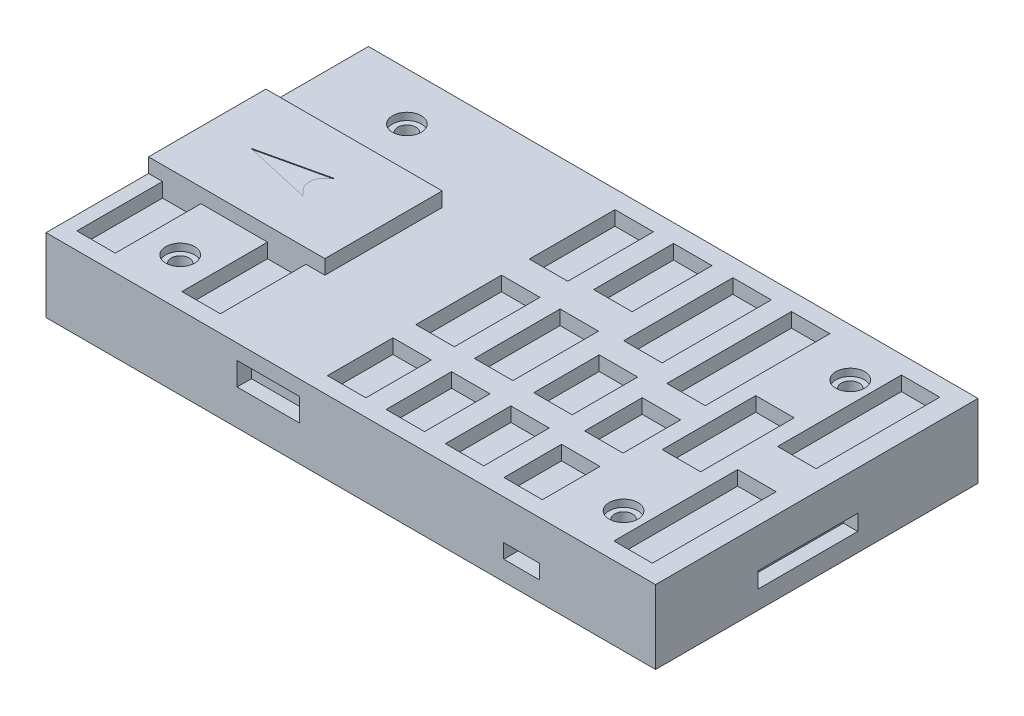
ISO-10303-21;
HEADER;
FILE_DESCRIPTION(('STEP AP214'),'2;1');
FILE_NAME('part.step','',(''),(''),'','','');
FILE_SCHEMA(('AUTOMOTIVE_DESIGN { 1 0 10303 214 1 1 1 1 }'));
ENDSEC;
DATA;
#1=APPLICATION_CONTEXT('core data for automotive mechanical design processes');
#2=APPLICATION_PROTOCOL_DEFINITION('international standard','automotive_design',2000,#1);
#3=PRODUCT_CONTEXT('',#1,'mechanical');
#4=PRODUCT('Part','Part','',(#3));
#5=PRODUCT_RELATED_PRODUCT_CATEGORY('part','',(#4));
#6=PRODUCT_DEFINITION_FORMATION('','',#4);
#7=PRODUCT_DEFINITION_CONTEXT('part definition',#1,'design');
#8=PRODUCT_DEFINITION('design','',#6,#7);
#9=PRODUCT_DEFINITION_SHAPE('','',#8);
#10=(LENGTH_UNIT() NAMED_UNIT(*) SI_UNIT(.MILLI.,.METRE.));
#11=(NAMED_UNIT(*) PLANE_ANGLE_UNIT() SI_UNIT($,.RADIAN.));
#12=(NAMED_UNIT(*) SI_UNIT($,.STERADIAN.) SOLID_ANGLE_UNIT());
#13=UNCERTAINTY_MEASURE_WITH_UNIT(LENGTH_MEASURE(1.E-05),#10,'distance_accuracy_value','');
#14=(GEOMETRIC_REPRESENTATION_CONTEXT(3) GLOBAL_UNCERTAINTY_ASSIGNED_CONTEXT((#13)) GLOBAL_UNIT_ASSIGNED_CONTEXT((#10,
#11,#12)) REPRESENTATION_CONTEXT('',''));
#15=CARTESIAN_POINT('',(0.,0.,0.));
#16=DIRECTION('',(0.,0.,1.));
#17=DIRECTION('',(1.,0.,0.));
#18=AXIS2_PLACEMENT_3D('',#15,#16,#17);
#19=CARTESIAN_POINT('',(-36.42,14.664,18.9));
#20=DIRECTION('',(0.,-1.,0.));
#21=DIRECTION('',(0.,0.,-1.));
#22=AXIS2_PLACEMENT_3D('',#19,#20,#21);
#23=CYLINDRICAL_SURFACE('',#22,1.5);
#24=CARTESIAN_POINT('',(-36.42,0.,18.9));
#25=DIRECTION('',(0.,-1.,0.));
#26=DIRECTION('',(0.,0.,-1.));
#27=AXIS2_PLACEMENT_3D('',#24,#25,#26);
#28=CIRCLE('',#27,1.5);
#29=CARTESIAN_POINT('',(-36.42,0.,17.4));
#30=VERTEX_POINT('',#29);
#31=EDGE_CURVE('E988',#30,#30,#28,.T.);
#32=ORIENTED_EDGE('',*,*,#31,.T.);
#33=EDGE_LOOP('',(#32));
#34=FACE_BOUND('',#33,.T.);
#35=CARTESIAN_POINT('',(-36.42,11.064,18.9));
#36=DIRECTION('',(0.,1.,0.));
#37=DIRECTION('',(0.,0.,1.));
#38=AXIS2_PLACEMENT_3D('',#35,#36,#37);
#39=CIRCLE('',#38,1.5);
#40=CARTESIAN_POINT('',(-36.42,11.064,20.4));
#41=VERTEX_POINT('',#40);
#42=EDGE_CURVE('E45',#41,#41,#39,.F.);
#43=ORIENTED_EDGE('',*,*,#42,.F.);
#44=EDGE_LOOP('',(#43));
#45=FACE_BOUND('',#44,.T.);
#46=ADVANCED_FACE('F41',(#34,#45),#23,.F.);
#47=CARTESIAN_POINT('',(37.5,14.664,-18.9));
#48=DIRECTION('',(0.,-1.,0.));
#49=DIRECTION('',(0.,0.,-1.));
#50=AXIS2_PLACEMENT_3D('',#47,#48,#49);
#51=CYLINDRICAL_SURFACE('',#50,1.5);
#52=CARTESIAN_POINT('',(37.5,0.,-18.9));
#53=DIRECTION('',(0.,-1.,0.));
#54=DIRECTION('',(0.,0.,-1.));
#55=AXIS2_PLACEMENT_3D('',#52,#53,#54);
#56=CIRCLE('',#55,1.5);
#57=CARTESIAN_POINT('',(37.5,0.,-20.4));
#58=VERTEX_POINT('',#57);
#59=EDGE_CURVE('E979',#58,#58,#56,.T.);
#60=ORIENTED_EDGE('',*,*,#59,.T.);
#61=EDGE_LOOP('',(#60));
#62=FACE_BOUND('',#61,.T.);
#63=CARTESIAN_POINT('',(37.5,11.064,-18.9));
#64=DIRECTION('',(0.,1.,0.));
#65=DIRECTION('',(0.,0.,1.));
#66=AXIS2_PLACEMENT_3D('',#63,#64,#65);
#67=CIRCLE('',#66,1.5);
#68=CARTESIAN_POINT('',(37.5,11.064,-17.4));
#69=VERTEX_POINT('',#68);
#70=EDGE_CURVE('E1821',#69,#69,#67,.F.);
#71=ORIENTED_EDGE('',*,*,#70,.F.);
#72=EDGE_LOOP('',(#71));
#73=FACE_BOUND('',#72,.T.);
#74=ADVANCED_FACE('F1833',(#62,#73),#51,.F.);
#75=CARTESIAN_POINT('',(37.5,14.664,18.9));
#76=DIRECTION('',(0.,-1.,0.));
#77=DIRECTION('',(0.,0.,-1.));
#78=AXIS2_PLACEMENT_3D('',#75,#76,#77);
#79=CYLINDRICAL_SURFACE('',#78,1.50000000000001);
#80=CARTESIAN_POINT('',(37.5,0.,18.9));
#81=DIRECTION('',(0.,-1.,0.));
#82=DIRECTION('',(0.,0.,-1.));
#83=AXIS2_PLACEMENT_3D('',#80,#81,#82);
#84=CIRCLE('',#83,1.50000000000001);
#85=CARTESIAN_POINT('',(37.5,0.,17.4));
#86=VERTEX_POINT('',#85);
#87=EDGE_CURVE('E983',#86,#86,#84,.T.);
#88=ORIENTED_EDGE('',*,*,#87,.T.);
#89=EDGE_LOOP('',(#88));
#90=FACE_BOUND('',#89,.T.);
#91=CARTESIAN_POINT('',(37.5,11.064,18.9));
#92=DIRECTION('',(0.,1.,0.));
#93=DIRECTION('',(0.,0.,1.));
#94=AXIS2_PLACEMENT_3D('',#91,#92,#93);
#95=CIRCLE('',#94,1.50000000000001);
#96=CARTESIAN_POINT('',(37.5,11.064,20.4));
#97=VERTEX_POINT('',#96);
#98=EDGE_CURVE('E1818',#97,#97,#95,.F.);
#99=ORIENTED_EDGE('',*,*,#98,.F.);
#100=EDGE_LOOP('',(#99));
#101=FACE_BOUND('',#100,.T.);
#102=ADVANCED_FACE('F1839',(#90,#101),#79,.F.);
#103=CARTESIAN_POINT('',(-36.42,14.664,-18.9));
#104=DIRECTION('',(0.,-1.,0.));
#105=DIRECTION('',(0.,0.,-1.));
#106=AXIS2_PLACEMENT_3D('',#103,#104,#105);
#107=CYLINDRICAL_SURFACE('',#106,1.5);
#108=CARTESIAN_POINT('',(-36.42,0.,-18.9));
#109=DIRECTION('',(0.,-1.,0.));
#110=DIRECTION('',(0.,0.,-1.));
#111=AXIS2_PLACEMENT_3D('',#108,#109,#110);
#112=CIRCLE('',#111,1.5);
#113=CARTESIAN_POINT('',(-36.42,0.,-20.4));
#114=VERTEX_POINT('',#113);
#115=EDGE_CURVE('E984',#114,#114,#112,.T.);
#116=ORIENTED_EDGE('',*,*,#115,.T.);
#117=EDGE_LOOP('',(#116));
#118=FACE_BOUND('',#117,.T.);
#119=CARTESIAN_POINT('',(-36.42,11.064,-18.9));
#120=DIRECTION('',(0.,1.,0.));
#121=DIRECTION('',(0.,0.,1.));
#122=AXIS2_PLACEMENT_3D('',#119,#120,#121);
#123=CIRCLE('',#122,1.5);
#124=CARTESIAN_POINT('',(-36.42,11.064,-17.4));
#125=VERTEX_POINT('',#124);
#126=EDGE_CURVE('E975',#125,#125,#123,.F.);
#127=ORIENTED_EDGE('',*,*,#126,.F.);
#128=EDGE_LOOP('',(#127));
#129=FACE_BOUND('',#128,.T.);
#130=ADVANCED_FACE('F2198',(#118,#129),#107,.F.);
#131=CARTESIAN_POINT('',(0.,12.264,0.));
#132=DIRECTION('',(0.,-1.,0.));
#133=DIRECTION('',(0.,0.,-1.));
#134=AXIS2_PLACEMENT_3D('',#131,#132,#133);
#135=PLANE('',#134);
#136=CARTESIAN_POINT('',(-36.42,12.264,18.9));
#137=DIRECTION('',(0.,1.,0.));
#138=DIRECTION('',(0.,0.,1.));
#139=AXIS2_PLACEMENT_3D('',#136,#137,#138);
#140=CIRCLE('',#139,2.4);
#141=CARTESIAN_POINT('',(-36.42,12.264,21.3));
#142=VERTEX_POINT('',#141);
#143=EDGE_CURVE('E960',#142,#142,#140,.T.);
#144=ORIENTED_EDGE('',*,*,#143,.F.);
#145=EDGE_LOOP('',(#144));
#146=FACE_BOUND('',#145,.T.);
#147=CARTESIAN_POINT('',(37.5,12.264,-18.9));
#148=DIRECTION('',(0.,1.,0.));
#149=DIRECTION('',(0.,0.,1.));
#150=AXIS2_PLACEMENT_3D('',#147,#148,#149);
#151=CIRCLE('',#150,2.4);
#152=CARTESIAN_POINT('',(37.5,12.264,-16.5));
#153=VERTEX_POINT('',#152);
#154=EDGE_CURVE('E951',#153,#153,#151,.T.);
#155=ORIENTED_EDGE('',*,*,#154,.F.);
#156=EDGE_LOOP('',(#155));
#157=FACE_BOUND('',#156,.T.);
#158=CARTESIAN_POINT('',(37.5,12.264,18.9));
#159=DIRECTION('',(0.,1.,0.));
#160=DIRECTION('',(0.,0.,1.));
#161=AXIS2_PLACEMENT_3D('',#158,#159,#160);
#162=CIRCLE('',#161,2.4);
#163=CARTESIAN_POINT('',(37.5,12.264,21.3));
#164=VERTEX_POINT('',#163);
#165=EDGE_CURVE('E937',#164,#164,#162,.T.);
#166=ORIENTED_EDGE('',*,*,#165,.F.);
#167=EDGE_LOOP('',(#166));
#168=FACE_BOUND('',#167,.T.);
#169=CARTESIAN_POINT('',(-36.42,12.264,-18.9));
#170=DIRECTION('',(0.,1.,0.));
#171=DIRECTION('',(0.,0.,1.));
#172=AXIS2_PLACEMENT_3D('',#169,#170,#171);
#173=CIRCLE('',#172,2.4);
#174=CARTESIAN_POINT('',(-36.42,12.264,-16.5));
#175=VERTEX_POINT('',#174);
#176=EDGE_CURVE('E959',#175,#175,#173,.T.);
#177=ORIENTED_EDGE('',*,*,#176,.F.);
#178=EDGE_LOOP('',(#177));
#179=FACE_BOUND('',#178,.T.);
#180=DIRECTION('',(1.,0.,0.));
#181=VECTOR('',#180,1.);
#182=CARTESIAN_POINT('',(12.948,12.264,-5.67599999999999));
#183=LINE('',#182,#181);
#184=CARTESIAN_POINT('',(12.948,12.264,-5.67599999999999));
#185=VERTEX_POINT('',#184);
#186=CARTESIAN_POINT('',(19.356,12.264,-5.67599999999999));
#187=VERTEX_POINT('',#186);
#188=EDGE_CURVE('E1494',#185,#187,#183,.T.);
#189=ORIENTED_EDGE('',*,*,#188,.F.);
#190=DIRECTION('',(0.,0.,1.));
#191=VECTOR('',#190,1.);
#192=CARTESIAN_POINT('',(12.948,12.264,-23.88));
#193=LINE('',#192,#191);
#194=CARTESIAN_POINT('',(12.948,12.264,-23.88));
#195=VERTEX_POINT('',#194);
#196=EDGE_CURVE('E1288',#195,#185,#193,.T.);
#197=ORIENTED_EDGE('',*,*,#196,.F.);
#198=DIRECTION('',(-1.,0.,0.));
#199=VECTOR('',#198,1.);
#200=CARTESIAN_POINT('',(12.948,12.264,-23.88));
#201=LINE('',#200,#199);
#202=CARTESIAN_POINT('',(19.356,12.264,-23.88));
#203=VERTEX_POINT('',#202);
#204=EDGE_CURVE('E1479',#203,#195,#201,.T.);
#205=ORIENTED_EDGE('',*,*,#204,.F.);
#206=DIRECTION('',(0.,0.,-1.));
#207=VECTOR('',#206,1.);
#208=CARTESIAN_POINT('',(19.356,12.264,-23.88));
#209=LINE('',#208,#207);
#210=EDGE_CURVE('E1498',#187,#203,#209,.T.);
#211=ORIENTED_EDGE('',*,*,#210,.F.);
#212=EDGE_LOOP('',(#189,#197,#205,#211));
#213=FACE_BOUND('',#212,.T.);
#214=DIRECTION('',(-1.,0.,0.));
#215=VECTOR('',#214,1.);
#216=CARTESIAN_POINT('',(19.356,12.264,-1.59599999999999));
#217=LINE('',#216,#215);
#218=CARTESIAN_POINT('',(19.356,12.264,-1.59599999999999));
#219=VERTEX_POINT('',#218);
#220=CARTESIAN_POINT('',(12.948,12.264,-1.59599999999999));
#221=VERTEX_POINT('',#220);
#222=EDGE_CURVE('E1451',#219,#221,#217,.T.);
#223=ORIENTED_EDGE('',*,*,#222,.F.);
#224=DIRECTION('',(0.,0.,-1.));
#225=VECTOR('',#224,1.);
#226=CARTESIAN_POINT('',(19.356,12.264,-1.59599999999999));
#227=LINE('',#226,#225);
#228=CARTESIAN_POINT('',(19.356,12.264,9.324));
#229=VERTEX_POINT('',#228);
#230=EDGE_CURVE('E1448',#229,#219,#227,.T.);
#231=ORIENTED_EDGE('',*,*,#230,.F.);
#232=DIRECTION('',(1.,0.,0.));
#233=VECTOR('',#232,1.);
#234=CARTESIAN_POINT('',(19.356,12.264,9.324));
#235=LINE('',#234,#233);
#236=CARTESIAN_POINT('',(12.948,12.264,9.32400000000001));
#237=VERTEX_POINT('',#236);
#238=EDGE_CURVE('E1435',#237,#229,#235,.T.);
#239=ORIENTED_EDGE('',*,*,#238,.F.);
#240=DIRECTION('',(0.,0.,1.));
#241=VECTOR('',#240,1.);
#242=CARTESIAN_POINT('',(12.948,12.264,-1.59599999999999));
#243=LINE('',#242,#241);
#244=EDGE_CURVE('E1456',#221,#237,#243,.T.);
#245=ORIENTED_EDGE('',*,*,#244,.F.);
#246=EDGE_LOOP('',(#223,#231,#239,#245));
#247=FACE_BOUND('',#246,.T.);
#248=DIRECTION('',(1.,0.,0.));
#249=VECTOR('',#248,1.);
#250=CARTESIAN_POINT('',(12.948,12.264,24.06));
#251=LINE('',#250,#249);
#252=CARTESIAN_POINT('',(12.948,12.264,24.06));
#253=VERTEX_POINT('',#252);
#254=CARTESIAN_POINT('',(19.356,12.264,24.06));
#255=VERTEX_POINT('',#254);
#256=EDGE_CURVE('E1407',#253,#255,#251,.T.);
#257=ORIENTED_EDGE('',*,*,#256,.F.);
#258=DIRECTION('',(0.,0.,1.));
#259=VECTOR('',#258,1.);
#260=CARTESIAN_POINT('',(12.948,12.264,24.06));
#261=LINE('',#260,#259);
#262=CARTESIAN_POINT('',(12.948,12.264,13.14));
#263=VERTEX_POINT('',#262);
#264=EDGE_CURVE('E1404',#263,#253,#261,.T.);
#265=ORIENTED_EDGE('',*,*,#264,.F.);
#266=DIRECTION('',(-1.,0.,0.));
#267=VECTOR('',#266,1.);
#268=CARTESIAN_POINT('',(12.948,12.264,13.14));
#269=LINE('',#268,#267);
#270=CARTESIAN_POINT('',(19.356,12.264,13.14));
#271=VERTEX_POINT('',#270);
#272=EDGE_CURVE('E1391',#271,#263,#269,.T.);
#273=ORIENTED_EDGE('',*,*,#272,.F.);
#274=DIRECTION('',(0.,0.,-1.));
#275=VECTOR('',#274,1.);
#276=CARTESIAN_POINT('',(19.356,12.264,24.06));
#277=LINE('',#276,#275);
#278=EDGE_CURVE('E1412',#255,#271,#277,.T.);
#279=ORIENTED_EDGE('',*,*,#278,.F.);
#280=EDGE_LOOP('',(#257,#265,#273,#279));
#281=FACE_BOUND('',#280,.T.);
#282=DIRECTION('',(1.,0.,0.));
#283=VECTOR('',#282,1.);
#284=CARTESIAN_POINT('',(3.06000000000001,12.264,24.06));
#285=LINE('',#284,#283);
#286=CARTESIAN_POINT('',(3.06000000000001,12.264,24.06));
#287=VERTEX_POINT('',#286);
#288=CARTESIAN_POINT('',(9.46800000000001,12.264,24.06));
#289=VERTEX_POINT('',#288);
#290=EDGE_CURVE('E1361',#287,#289,#285,.T.);
#291=ORIENTED_EDGE('',*,*,#290,.F.);
#292=DIRECTION('',(0.,0.,1.));
#293=VECTOR('',#292,1.);
#294=CARTESIAN_POINT('',(3.06000000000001,12.264,13.14));
#295=LINE('',#294,#293);
#296=CARTESIAN_POINT('',(3.06000000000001,12.264,13.14));
#297=VERTEX_POINT('',#296);
#298=EDGE_CURVE('E1358',#297,#287,#295,.T.);
#299=ORIENTED_EDGE('',*,*,#298,.F.);
#300=DIRECTION('',(-1.,0.,0.));
#301=VECTOR('',#300,1.);
#302=CARTESIAN_POINT('',(3.06000000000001,12.264,13.14));
#303=LINE('',#302,#301);
#304=CARTESIAN_POINT('',(9.46800000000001,12.264,13.14));
#305=VERTEX_POINT('',#304);
#306=EDGE_CURVE('E1345',#305,#297,#303,.T.);
#307=ORIENTED_EDGE('',*,*,#306,.F.);
#308=DIRECTION('',(0.,0.,-1.));
#309=VECTOR('',#308,1.);
#310=CARTESIAN_POINT('',(9.46800000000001,12.264,13.14));
#311=LINE('',#310,#309);
#312=EDGE_CURVE('E1366',#289,#305,#311,.T.);
#313=ORIENTED_EDGE('',*,*,#312,.F.);
#314=EDGE_LOOP('',(#291,#299,#307,#313));
#315=FACE_BOUND('',#314,.T.);
#316=DIRECTION('',(1.,0.,0.));
#317=VECTOR('',#316,1.);
#318=CARTESIAN_POINT('',(3.06000000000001,12.264,9.324));
#319=LINE('',#318,#317);
#320=CARTESIAN_POINT('',(3.06000000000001,12.264,9.324));
#321=VERTEX_POINT('',#320);
#322=CARTESIAN_POINT('',(9.46800000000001,12.264,9.324));
#323=VERTEX_POINT('',#322);
#324=EDGE_CURVE('E1670',#321,#323,#319,.T.);
#325=ORIENTED_EDGE('',*,*,#324,.F.);
#326=DIRECTION('',(0.,0.,1.));
#327=VECTOR('',#326,1.);
#328=CARTESIAN_POINT('',(3.06000000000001,12.264,-4.956));
#329=LINE('',#328,#327);
#330=CARTESIAN_POINT('',(3.06000000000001,12.264,-4.956));
#331=VERTEX_POINT('',#330);
#332=EDGE_CURVE('E1376',#331,#321,#329,.T.);
#333=ORIENTED_EDGE('',*,*,#332,.F.);
#334=DIRECTION('',(-1.,0.,0.));
#335=VECTOR('',#334,1.);
#336=CARTESIAN_POINT('',(3.06000000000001,12.264,-4.956));
#337=LINE('',#336,#335);
#338=CARTESIAN_POINT('',(9.468,12.264,-4.956));
#339=VERTEX_POINT('',#338);
#340=EDGE_CURVE('E1655',#339,#331,#337,.T.);
#341=ORIENTED_EDGE('',*,*,#340,.F.);
#342=DIRECTION('',(0.,0.,-1.));
#343=VECTOR('',#342,1.);
#344=CARTESIAN_POINT('',(9.468,12.264,-4.956));
#345=LINE('',#344,#343);
#346=EDGE_CURVE('E1674',#323,#339,#345,.T.);
#347=ORIENTED_EDGE('',*,*,#346,.F.);
#348=EDGE_LOOP('',(#325,#333,#341,#347));
#349=FACE_BOUND('',#348,.T.);
#350=DIRECTION('',(1.,0.,0.));
#351=VECTOR('',#350,1.);
#352=CARTESIAN_POINT('',(3.06000000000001,12.264,-10.56));
#353=LINE('',#352,#351);
#354=CARTESIAN_POINT('',(3.06000000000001,12.264,-10.56));
#355=VERTEX_POINT('',#354);
#356=CARTESIAN_POINT('',(9.468,12.264,-10.56));
#357=VERTEX_POINT('',#356);
#358=EDGE_CURVE('E1627',#355,#357,#353,.T.);
#359=ORIENTED_EDGE('',*,*,#358,.F.);
#360=DIRECTION('',(0.,0.,1.));
#361=VECTOR('',#360,1.);
#362=CARTESIAN_POINT('',(3.06000000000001,12.264,-23.88));
#363=LINE('',#362,#361);
#364=CARTESIAN_POINT('',(3.06000000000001,12.264,-23.88));
#365=VERTEX_POINT('',#364);
#366=EDGE_CURVE('E1624',#365,#355,#363,.T.);
#367=ORIENTED_EDGE('',*,*,#366,.F.);
#368=DIRECTION('',(-1.,0.,0.));
#369=VECTOR('',#368,1.);
#370=CARTESIAN_POINT('',(3.06000000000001,12.264,-23.88));
#371=LINE('',#370,#369);
#372=CARTESIAN_POINT('',(9.46800000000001,12.264,-23.88));
#373=VERTEX_POINT('',#372);
#374=EDGE_CURVE('E1611',#373,#365,#371,.T.);
#375=ORIENTED_EDGE('',*,*,#374,.F.);
#376=DIRECTION('',(0.,0.,-1.));
#377=VECTOR('',#376,1.);
#378=CARTESIAN_POINT('',(9.46800000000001,12.264,-23.88));
#379=LINE('',#378,#377);
#380=EDGE_CURVE('E1632',#357,#373,#379,.T.);
#381=ORIENTED_EDGE('',*,*,#380,.F.);
#382=EDGE_LOOP('',(#359,#367,#375,#381));
#383=FACE_BOUND('',#382,.T.);
#384=DIRECTION('',(1.,0.,0.));
#385=VECTOR('',#384,1.);
#386=CARTESIAN_POINT('',(-6.70799999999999,12.264,-9.60000000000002));
#387=LINE('',#386,#385);
#388=CARTESIAN_POINT('',(-6.70799999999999,12.264,-9.60000000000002));
#389=VERTEX_POINT('',#388);
#390=CARTESIAN_POINT('',(-0.299999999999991,12.264,-9.60000000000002));
#391=VERTEX_POINT('',#390);
#392=EDGE_CURVE('E1583',#389,#391,#387,.T.);
#393=ORIENTED_EDGE('',*,*,#392,.F.);
#394=DIRECTION('',(0.,0.,1.));
#395=VECTOR('',#394,1.);
#396=CARTESIAN_POINT('',(-6.70799999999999,12.264,-23.88));
#397=LINE('',#396,#395);
#398=CARTESIAN_POINT('',(-6.70799999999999,12.264,-23.88));
#399=VERTEX_POINT('',#398);
#400=EDGE_CURVE('E1580',#399,#389,#397,.T.);
#401=ORIENTED_EDGE('',*,*,#400,.F.);
#402=DIRECTION('',(-1.,0.,0.));
#403=VECTOR('',#402,1.);
#404=CARTESIAN_POINT('',(-6.70799999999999,12.264,-23.88));
#405=LINE('',#404,#403);
#406=CARTESIAN_POINT('',(-0.299999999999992,12.264,-23.88));
#407=VERTEX_POINT('',#406);
#408=EDGE_CURVE('E1567',#407,#399,#405,.T.);
#409=ORIENTED_EDGE('',*,*,#408,.F.);
#410=DIRECTION('',(0.,0.,-1.));
#411=VECTOR('',#410,1.);
#412=CARTESIAN_POINT('',(-0.299999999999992,12.264,-23.88));
#413=LINE('',#412,#411);
#414=EDGE_CURVE('E1588',#391,#407,#413,.T.);
#415=ORIENTED_EDGE('',*,*,#414,.F.);
#416=EDGE_LOOP('',(#393,#401,#409,#415));
#417=FACE_BOUND('',#416,.T.);
#418=DIRECTION('',(1.,0.,0.));
#419=VECTOR('',#418,1.);
#420=CARTESIAN_POINT('',(-6.70799999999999,12.264,9.324));
#421=LINE('',#420,#419);
#422=CARTESIAN_POINT('',(-6.70799999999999,12.264,9.324));
#423=VERTEX_POINT('',#422);
#424=CARTESIAN_POINT('',(-0.29999999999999,12.264,9.324));
#425=VERTEX_POINT('',#424);
#426=EDGE_CURVE('E1537',#423,#425,#421,.T.);
#427=ORIENTED_EDGE('',*,*,#426,.F.);
#428=DIRECTION('',(0.,0.,1.));
#429=VECTOR('',#428,1.);
#430=CARTESIAN_POINT('',(-6.70799999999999,12.264,-4.956));
#431=LINE('',#430,#429);
#432=CARTESIAN_POINT('',(-6.70799999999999,12.264,-4.956));
#433=VERTEX_POINT('',#432);
#434=EDGE_CURVE('E1534',#433,#423,#431,.T.);
#435=ORIENTED_EDGE('',*,*,#434,.F.);
#436=DIRECTION('',(-1.,0.,0.));
#437=VECTOR('',#436,1.);
#438=CARTESIAN_POINT('',(-6.70799999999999,12.264,-4.956));
#439=LINE('',#438,#437);
#440=CARTESIAN_POINT('',(-0.29999999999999,12.264,-4.956));
#441=VERTEX_POINT('',#440);
#442=EDGE_CURVE('E1521',#441,#433,#439,.T.);
#443=ORIENTED_EDGE('',*,*,#442,.F.);
#444=DIRECTION('',(0.,0.,-1.));
#445=VECTOR('',#444,1.);
#446=CARTESIAN_POINT('',(-0.29999999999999,12.264,-4.956));
#447=LINE('',#446,#445);
#448=EDGE_CURVE('E1542',#425,#441,#447,.T.);
#449=ORIENTED_EDGE('',*,*,#448,.F.);
#450=EDGE_LOOP('',(#427,#435,#443,#449));
#451=FACE_BOUND('',#450,.T.);
#452=DIRECTION('',(1.,0.,0.));
#453=VECTOR('',#452,1.);
#454=CARTESIAN_POINT('',(41.052,12.264,24.06));
#455=LINE('',#454,#453);
#456=CARTESIAN_POINT('',(41.052,12.264,24.06));
#457=VERTEX_POINT('',#456);
#458=CARTESIAN_POINT('',(47.46,12.264,24.06));
#459=VERTEX_POINT('',#458);
#460=EDGE_CURVE('E1063',#457,#459,#455,.T.);
#461=ORIENTED_EDGE('',*,*,#460,.F.);
#462=DIRECTION('',(0.,0.,1.));
#463=VECTOR('',#462,1.);
#464=CARTESIAN_POINT('',(41.052,12.264,3.41999999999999));
#465=LINE('',#464,#463);
#466=CARTESIAN_POINT('',(41.052,12.264,3.41999999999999));
#467=VERTEX_POINT('',#466);
#468=EDGE_CURVE('E1060',#467,#457,#465,.T.);
#469=ORIENTED_EDGE('',*,*,#468,.F.);
#470=DIRECTION('',(-1.,0.,0.));
#471=VECTOR('',#470,1.);
#472=CARTESIAN_POINT('',(41.052,12.264,3.41999999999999));
#473=LINE('',#472,#471);
#474=CARTESIAN_POINT('',(47.46,12.264,3.41999999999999));
#475=VERTEX_POINT('',#474);
#476=EDGE_CURVE('E1047',#475,#467,#473,.T.);
#477=ORIENTED_EDGE('',*,*,#476,.F.);
#478=DIRECTION('',(0.,0.,-1.));
#479=VECTOR('',#478,1.);
#480=CARTESIAN_POINT('',(47.46,12.264,3.41999999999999));
#481=LINE('',#480,#479);
#482=EDGE_CURVE('E1068',#459,#475,#481,.T.);
#483=ORIENTED_EDGE('',*,*,#482,.F.);
#484=EDGE_LOOP('',(#461,#469,#477,#483));
#485=FACE_BOUND('',#484,.T.);
#486=DIRECTION('',(1.,0.,0.));
#487=VECTOR('',#486,1.);
#488=CARTESIAN_POINT('',(41.052,12.264,-3.24000000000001));
#489=LINE('',#488,#487);
#490=CARTESIAN_POINT('',(41.052,12.264,-3.24000000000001));
#491=VERTEX_POINT('',#490);
#492=CARTESIAN_POINT('',(47.46,12.264,-3.24000000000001));
#493=VERTEX_POINT('',#492);
#494=EDGE_CURVE('E1017',#491,#493,#489,.T.);
#495=ORIENTED_EDGE('',*,*,#494,.F.);
#496=DIRECTION('',(0.,0.,1.));
#497=VECTOR('',#496,1.);
#498=CARTESIAN_POINT('',(41.052,12.264,-23.88));
#499=LINE('',#498,#497);
#500=CARTESIAN_POINT('',(41.052,12.264,-23.88));
#501=VERTEX_POINT('',#500);
#502=EDGE_CURVE('E1014',#501,#491,#499,.T.);
#503=ORIENTED_EDGE('',*,*,#502,.F.);
#504=DIRECTION('',(-1.,0.,0.));
#505=VECTOR('',#504,1.);
#506=CARTESIAN_POINT('',(41.052,12.264,-23.88));
#507=LINE('',#506,#505);
#508=CARTESIAN_POINT('',(47.46,12.264,-23.88));
#509=VERTEX_POINT('',#508);
#510=EDGE_CURVE('E1001',#509,#501,#507,.T.);
#511=ORIENTED_EDGE('',*,*,#510,.F.);
#512=DIRECTION('',(0.,0.,-1.));
#513=VECTOR('',#512,1.);
#514=CARTESIAN_POINT('',(47.46,12.264,-23.88));
#515=LINE('',#514,#513);
#516=EDGE_CURVE('E1022',#493,#509,#515,.T.);
#517=ORIENTED_EDGE('',*,*,#516,.F.);
#518=EDGE_LOOP('',(#495,#503,#511,#517));
#519=FACE_BOUND('',#518,.T.);
#520=DIRECTION('',(1.,0.,0.));
#521=VECTOR('',#520,1.);
#522=CARTESIAN_POINT('',(22.716,12.264,-3.096));
#523=LINE('',#522,#521);
#524=CARTESIAN_POINT('',(22.716,12.264,-3.096));
#525=VERTEX_POINT('',#524);
#526=CARTESIAN_POINT('',(29.124,12.264,-3.096));
#527=VERTEX_POINT('',#526);
#528=EDGE_CURVE('E1273',#525,#527,#523,.T.);
#529=ORIENTED_EDGE('',*,*,#528,.F.);
#530=DIRECTION('',(0.,0.,1.));
#531=VECTOR('',#530,1.);
#532=CARTESIAN_POINT('',(22.716,12.264,-23.88));
#533=LINE('',#532,#531);
#534=CARTESIAN_POINT('',(22.716,12.264,-23.88));
#535=VERTEX_POINT('',#534);
#536=EDGE_CURVE('E1270',#535,#525,#533,.T.);
#537=ORIENTED_EDGE('',*,*,#536,.F.);
#538=DIRECTION('',(-1.,0.,0.));
#539=VECTOR('',#538,1.);
#540=CARTESIAN_POINT('',(22.716,12.264,-23.88));
#541=LINE('',#540,#539);
#542=CARTESIAN_POINT('',(29.124,12.264,-23.88));
#543=VERTEX_POINT('',#542);
#544=EDGE_CURVE('E1257',#543,#535,#541,.T.);
#545=ORIENTED_EDGE('',*,*,#544,.F.);
#546=DIRECTION('',(0.,0.,-1.));
#547=VECTOR('',#546,1.);
#548=CARTESIAN_POINT('',(29.124,12.264,-23.88));
#549=LINE('',#548,#547);
#550=EDGE_CURVE('E1278',#527,#543,#549,.T.);
#551=ORIENTED_EDGE('',*,*,#550,.F.);
#552=EDGE_LOOP('',(#529,#537,#545,#551));
#553=FACE_BOUND('',#552,.T.);
#554=DIRECTION('',(-1.,0.,0.));
#555=VECTOR('',#554,1.);
#556=CARTESIAN_POINT('',(29.124,12.264,1.008));
#557=LINE('',#556,#555);
#558=CARTESIAN_POINT('',(29.124,12.264,1.008));
#559=VERTEX_POINT('',#558);
#560=CARTESIAN_POINT('',(22.716,12.264,1.008));
#561=VERTEX_POINT('',#560);
#562=EDGE_CURVE('E1318',#559,#561,#557,.T.);
#563=ORIENTED_EDGE('',*,*,#562,.F.);
#564=DIRECTION('',(0.,0.,-1.));
#565=VECTOR('',#564,1.);
#566=CARTESIAN_POINT('',(29.124,12.264,1.008));
#567=LINE('',#566,#565);
#568=CARTESIAN_POINT('',(29.124,12.264,10.608));
#569=VERTEX_POINT('',#568);
#570=EDGE_CURVE('E1200',#569,#559,#567,.T.);
#571=ORIENTED_EDGE('',*,*,#570,.F.);
#572=DIRECTION('',(1.,0.,0.));
#573=VECTOR('',#572,1.);
#574=CARTESIAN_POINT('',(29.124,12.264,10.608));
#575=LINE('',#574,#573);
#576=CARTESIAN_POINT('',(22.716,12.264,10.608));
#577=VERTEX_POINT('',#576);
#578=EDGE_CURVE('E1303',#577,#569,#575,.T.);
#579=ORIENTED_EDGE('',*,*,#578,.F.);
#580=DIRECTION('',(0.,0.,1.));
#581=VECTOR('',#580,1.);
#582=CARTESIAN_POINT('',(22.716,12.264,1.008));
#583=LINE('',#582,#581);
#584=EDGE_CURVE('E1322',#561,#577,#583,.T.);
#585=ORIENTED_EDGE('',*,*,#584,.F.);
#586=EDGE_LOOP('',(#563,#571,#579,#585));
#587=FACE_BOUND('',#586,.T.);
#588=DIRECTION('',(1.,0.,0.));
#589=VECTOR('',#588,1.);
#590=CARTESIAN_POINT('',(22.716,12.264,24.06));
#591=LINE('',#590,#589);
#592=CARTESIAN_POINT('',(22.716,12.264,24.06));
#593=VERTEX_POINT('',#592);
#594=CARTESIAN_POINT('',(29.124,12.264,24.06));
#595=VERTEX_POINT('',#594);
#596=EDGE_CURVE('E1185',#593,#595,#591,.T.);
#597=ORIENTED_EDGE('',*,*,#596,.F.);
#598=DIRECTION('',(0.,0.,1.));
#599=VECTOR('',#598,1.);
#600=CARTESIAN_POINT('',(22.716,12.264,14.46));
#601=LINE('',#600,#599);
#602=CARTESIAN_POINT('',(22.716,12.264,14.46));
#603=VERTEX_POINT('',#602);
#604=EDGE_CURVE('E1182',#603,#593,#601,.T.);
#605=ORIENTED_EDGE('',*,*,#604,.F.);
#606=DIRECTION('',(-1.,0.,0.));
#607=VECTOR('',#606,1.);
#608=CARTESIAN_POINT('',(22.716,12.264,14.46));
#609=LINE('',#608,#607);
#610=CARTESIAN_POINT('',(29.124,12.264,14.46));
#611=VERTEX_POINT('',#610);
#612=EDGE_CURVE('E1169',#611,#603,#609,.T.);
#613=ORIENTED_EDGE('',*,*,#612,.F.);
#614=DIRECTION('',(0.,0.,-1.));
#615=VECTOR('',#614,1.);
#616=CARTESIAN_POINT('',(29.124,12.264,14.46));
#617=LINE('',#616,#615);
#618=EDGE_CURVE('E1190',#595,#611,#617,.T.);
#619=ORIENTED_EDGE('',*,*,#618,.F.);
#620=EDGE_LOOP('',(#597,#605,#613,#619));
#621=FACE_BOUND('',#620,.T.);
#622=DIRECTION('',(-1.,0.,0.));
#623=VECTOR('',#622,1.);
#624=CARTESIAN_POINT('',(38.292,12.264,-8.76000000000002));
#625=LINE('',#624,#623);
#626=CARTESIAN_POINT('',(38.292,12.264,-8.76000000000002));
#627=VERTEX_POINT('',#626);
#628=CARTESIAN_POINT('',(31.884,12.264,-8.76000000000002));
#629=VERTEX_POINT('',#628);
#630=EDGE_CURVE('E1230',#627,#629,#625,.T.);
#631=ORIENTED_EDGE('',*,*,#630,.F.);
#632=DIRECTION('',(0.,0.,-1.));
#633=VECTOR('',#632,1.);
#634=CARTESIAN_POINT('',(38.292,12.264,-8.76000000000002));
#635=LINE('',#634,#633);
#636=CARTESIAN_POINT('',(38.292,12.264,6.83999999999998));
#637=VERTEX_POINT('',#636);
#638=EDGE_CURVE('E1032',#637,#627,#635,.T.);
#639=ORIENTED_EDGE('',*,*,#638,.F.);
#640=DIRECTION('',(1.,0.,0.));
#641=VECTOR('',#640,1.);
#642=CARTESIAN_POINT('',(38.292,12.264,6.83999999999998));
#643=LINE('',#642,#641);
#644=CARTESIAN_POINT('',(31.884,12.264,6.83999999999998));
#645=VERTEX_POINT('',#644);
#646=EDGE_CURVE('E1215',#645,#637,#643,.T.);
#647=ORIENTED_EDGE('',*,*,#646,.F.);
#648=DIRECTION('',(0.,0.,1.));
#649=VECTOR('',#648,1.);
#650=CARTESIAN_POINT('',(31.884,12.264,-8.76000000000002));
#651=LINE('',#650,#649);
#652=EDGE_CURVE('E1234',#629,#645,#651,.T.);
#653=ORIENTED_EDGE('',*,*,#652,.F.);
#654=EDGE_LOOP('',(#631,#639,#647,#653));
#655=FACE_BOUND('',#654,.T.);
#656=DIRECTION('',(1.,0.,0.));
#657=VECTOR('',#656,1.);
#658=CARTESIAN_POINT('',(-6.70799999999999,12.264,24.06));
#659=LINE('',#658,#657);
#660=CARTESIAN_POINT('',(-6.70799999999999,12.264,24.06));
#661=VERTEX_POINT('',#660);
#662=CARTESIAN_POINT('',(-0.299999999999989,12.264,24.06));
#663=VERTEX_POINT('',#662);
#664=EDGE_CURVE('E1712',#661,#663,#659,.T.);
#665=ORIENTED_EDGE('',*,*,#664,.F.);
#666=DIRECTION('',(0.,0.,1.));
#667=VECTOR('',#666,1.);
#668=CARTESIAN_POINT('',(-6.70799999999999,12.264,13.14));
#669=LINE('',#668,#667);
#670=CARTESIAN_POINT('',(-6.70799999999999,12.264,13.14));
#671=VERTEX_POINT('',#670);
#672=EDGE_CURVE('E1552',#671,#661,#669,.T.);
#673=ORIENTED_EDGE('',*,*,#672,.F.);
#674=DIRECTION('',(-1.,0.,0.));
#675=VECTOR('',#674,1.);
#676=CARTESIAN_POINT('',(-6.70799999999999,12.264,13.14));
#677=LINE('',#676,#675);
#678=CARTESIAN_POINT('',(-0.29999999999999,12.264,13.14));
#679=VERTEX_POINT('',#678);
#680=EDGE_CURVE('E1697',#679,#671,#677,.T.);
#681=ORIENTED_EDGE('',*,*,#680,.F.);
#682=DIRECTION('',(0.,0.,-1.));
#683=VECTOR('',#682,1.);
#684=CARTESIAN_POINT('',(-0.29999999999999,12.264,13.14));
#685=LINE('',#684,#683);
#686=EDGE_CURVE('E1716',#663,#679,#685,.T.);
#687=ORIENTED_EDGE('',*,*,#686,.F.);
#688=EDGE_LOOP('',(#665,#673,#681,#687));
#689=FACE_BOUND('',#688,.T.);
#690=DIRECTION('',(1.,0.,0.));
#691=VECTOR('',#690,1.);
#692=CARTESIAN_POINT('',(-48.492,12.264,24.06));
#693=LINE('',#692,#691);
#694=CARTESIAN_POINT('',(-48.492,12.264,24.06));
#695=VERTEX_POINT('',#694);
#696=CARTESIAN_POINT('',(-42.084,12.264,24.06));
#697=VERTEX_POINT('',#696);
#698=EDGE_CURVE('E1147',#695,#697,#693,.T.);
#699=ORIENTED_EDGE('',*,*,#698,.F.);
#700=DIRECTION('',(0.,0.,1.));
#701=VECTOR('',#700,1.);
#702=CARTESIAN_POINT('',(-48.492,12.264,9.78));
#703=LINE('',#702,#701);
#704=CARTESIAN_POINT('',(-48.492,12.264,9.78));
#705=VERTEX_POINT('',#704);
#706=EDGE_CURVE('E995',#705,#695,#703,.T.);
#707=ORIENTED_EDGE('',*,*,#706,.F.);
#708=DIRECTION('',(1.,0.,0.));
#709=VECTOR('',#708,1.);
#710=CARTESIAN_POINT('',(-50.82,12.264,9.78));
#711=LINE('',#710,#709);
#712=CARTESIAN_POINT('',(-50.82,12.264,9.78));
#713=VERTEX_POINT('',#712);
#714=EDGE_CURVE('E1751',#713,#705,#711,.T.);
#715=ORIENTED_EDGE('',*,*,#714,.F.);
#716=DIRECTION('',(0.,0.,1.));
#717=VECTOR('',#716,1.);
#718=CARTESIAN_POINT('',(-50.82,12.264,26.88));
#719=LINE('',#718,#717);
#720=CARTESIAN_POINT('',(-50.82,12.264,26.88));
#721=VERTEX_POINT('',#720);
#722=EDGE_CURVE('E1783',#713,#721,#719,.T.);
#723=ORIENTED_EDGE('',*,*,#722,.T.);
#724=DIRECTION('',(1.,0.,0.));
#725=VECTOR('',#724,1.);
#726=CARTESIAN_POINT('',(-50.82,12.264,26.88));
#727=LINE('',#726,#725);
#728=CARTESIAN_POINT('',(50.82,12.264,26.88));
#729=VERTEX_POINT('',#728);
#730=EDGE_CURVE('E1782',#721,#729,#727,.T.);
#731=ORIENTED_EDGE('',*,*,#730,.T.);
#732=DIRECTION('',(0.,0.,-1.));
#733=VECTOR('',#732,1.);
#734=CARTESIAN_POINT('',(50.82,12.264,26.88));
#735=LINE('',#734,#733);
#736=CARTESIAN_POINT('',(50.82,12.264,-26.88));
#737=VERTEX_POINT('',#736);
#738=EDGE_CURVE('E1786',#729,#737,#735,.T.);
#739=ORIENTED_EDGE('',*,*,#738,.T.);
#740=DIRECTION('',(-1.,0.,0.));
#741=VECTOR('',#740,1.);
#742=CARTESIAN_POINT('',(-50.82,12.264,-26.88));
#743=LINE('',#742,#741);
#744=CARTESIAN_POINT('',(-50.82,12.264,-26.88));
#745=VERTEX_POINT('',#744);
#746=EDGE_CURVE('E1789',#737,#745,#743,.T.);
#747=ORIENTED_EDGE('',*,*,#746,.T.);
#748=CARTESIAN_POINT('',(-50.82,12.264,-9.78));
#749=VERTEX_POINT('',#748);
#750=EDGE_CURVE('E1779',#745,#749,#719,.T.);
#751=ORIENTED_EDGE('',*,*,#750,.T.);
#752=DIRECTION('',(-1.,0.,0.));
#753=VECTOR('',#752,1.);
#754=CARTESIAN_POINT('',(-50.82,12.264,-9.78));
#755=LINE('',#754,#753);
#756=CARTESIAN_POINT('',(-21.42,12.264,-9.78));
#757=VERTEX_POINT('',#756);
#758=EDGE_CURVE('E1741',#757,#749,#755,.T.);
#759=ORIENTED_EDGE('',*,*,#758,.F.);
#760=DIRECTION('',(0.,0.,-1.));
#761=VECTOR('',#760,1.);
#762=CARTESIAN_POINT('',(-21.42,12.264,-9.78));
#763=LINE('',#762,#761);
#764=CARTESIAN_POINT('',(-21.42,12.264,9.78));
#765=VERTEX_POINT('',#764);
#766=EDGE_CURVE('E1755',#765,#757,#763,.T.);
#767=ORIENTED_EDGE('',*,*,#766,.F.);
#768=CARTESIAN_POINT('',(-24.576,12.264,9.78));
#769=VERTEX_POINT('',#768);
#770=EDGE_CURVE('E1726',#769,#765,#711,.T.);
#771=ORIENTED_EDGE('',*,*,#770,.F.);
#772=DIRECTION('',(0.,0.,-1.));
#773=VECTOR('',#772,1.);
#774=CARTESIAN_POINT('',(-24.576,12.264,24.06));
#775=LINE('',#774,#773);
#776=CARTESIAN_POINT('',(-24.576,12.264,24.06));
#777=VERTEX_POINT('',#776);
#778=EDGE_CURVE('E1091',#777,#769,#775,.T.);
#779=ORIENTED_EDGE('',*,*,#778,.F.);
#780=DIRECTION('',(1.,0.,0.));
#781=VECTOR('',#780,1.);
#782=CARTESIAN_POINT('',(-30.984,12.264,24.06));
#783=LINE('',#782,#781);
#784=CARTESIAN_POINT('',(-30.984,12.264,24.06));
#785=VERTEX_POINT('',#784);
#786=EDGE_CURVE('E1108',#785,#777,#783,.T.);
#787=ORIENTED_EDGE('',*,*,#786,.F.);
#788=DIRECTION('',(0.,0.,1.));
#789=VECTOR('',#788,1.);
#790=CARTESIAN_POINT('',(-30.984,12.264,24.06));
#791=LINE('',#790,#789);
#792=CARTESIAN_POINT('',(-30.984,12.264,9.78));
#793=VERTEX_POINT('',#792);
#794=EDGE_CURVE('E1104',#793,#785,#791,.T.);
#795=ORIENTED_EDGE('',*,*,#794,.F.);
#796=CARTESIAN_POINT('',(-42.084,12.264,9.78));
#797=VERTEX_POINT('',#796);
#798=EDGE_CURVE('E1756',#797,#793,#711,.T.);
#799=ORIENTED_EDGE('',*,*,#798,.F.);
#800=DIRECTION('',(0.,0.,-1.));
#801=VECTOR('',#800,1.);
#802=CARTESIAN_POINT('',(-42.084,12.264,9.78));
#803=LINE('',#802,#801);
#804=EDGE_CURVE('E1131',#697,#797,#803,.T.);
#805=ORIENTED_EDGE('',*,*,#804,.F.);
#806=EDGE_LOOP('',(#699,#707,#715,#723,#731,#739,#747,#751,#759,#767,#771,#779,#787,#795,#799,#805));
#807=FACE_BOUND('',#806,.T.);
#808=ADVANCED_FACE('F2195',(#146,#157,#168,#179,#213,#247,#281,#315,#349,#383,#417,#451,#485,
#519,#553,#587,#621,#655,#689,#807),#135,.F.);
#809=CARTESIAN_POINT('',(-50.82,12.264,26.88));
#810=DIRECTION('',(1.,0.,0.));
#811=DIRECTION('',(0.,0.,-1.));
#812=AXIS2_PLACEMENT_3D('',#809,#810,#811);
#813=PLANE('',#812);
#814=DIRECTION('',(0.,0.,1.));
#815=VECTOR('',#814,1.);
#816=CARTESIAN_POINT('',(-50.82,0.,26.88));
#817=LINE('',#816,#815);
#818=CARTESIAN_POINT('',(-50.82,0.,-26.88));
#819=VERTEX_POINT('',#818);
#820=CARTESIAN_POINT('',(-50.82,0.,26.88));
#821=VERTEX_POINT('',#820);
#822=EDGE_CURVE('E1778',#819,#821,#817,.T.);
#823=ORIENTED_EDGE('',*,*,#822,.T.);
#824=DIRECTION('',(0.,-1.,0.));
#825=VECTOR('',#824,1.);
#826=CARTESIAN_POINT('',(-50.82,12.264,26.88));
#827=LINE('',#826,#825);
#828=EDGE_CURVE('E11',#721,#821,#827,.T.);
#829=ORIENTED_EDGE('',*,*,#828,.F.);
#830=ORIENTED_EDGE('',*,*,#722,.F.);
#831=DIRECTION('',(0.,-1.,0.));
#832=VECTOR('',#831,1.);
#833=CARTESIAN_POINT('',(-50.82,14.664,9.78));
#834=LINE('',#833,#832);
#835=CARTESIAN_POINT('',(-50.82,14.664,9.78));
#836=VERTEX_POINT('',#835);
#837=EDGE_CURVE('E1774',#836,#713,#834,.T.);
#838=ORIENTED_EDGE('',*,*,#837,.F.);
#839=DIRECTION('',(0.,0.,1.));
#840=VECTOR('',#839,1.);
#841=CARTESIAN_POINT('',(-50.82,14.664,-9.78));
#842=LINE('',#841,#840);
#843=CARTESIAN_POINT('',(-50.82,14.664,-9.78));
#844=VERTEX_POINT('',#843);
#845=EDGE_CURVE('E1736',#844,#836,#842,.T.);
#846=ORIENTED_EDGE('',*,*,#845,.F.);
#847=DIRECTION('',(0.,-1.,0.));
#848=VECTOR('',#847,1.);
#849=CARTESIAN_POINT('',(-50.82,14.664,-9.78));
#850=LINE('',#849,#848);
#851=EDGE_CURVE('E1750',#844,#749,#850,.T.);
#852=ORIENTED_EDGE('',*,*,#851,.T.);
#853=ORIENTED_EDGE('',*,*,#750,.F.);
#854=DIRECTION('',(0.,-1.,0.));
#855=VECTOR('',#854,1.);
#856=CARTESIAN_POINT('',(-50.82,12.264,-26.88));
#857=LINE('',#856,#855);
#858=EDGE_CURVE('E1792',#745,#819,#857,.T.);
#859=ORIENTED_EDGE('',*,*,#858,.T.);
#860=EDGE_LOOP('',(#823,#829,#830,#838,#846,#852,#853,#859));
#861=FACE_BOUND('',#860,.T.);
#862=ADVANCED_FACE('F43',(#861),#813,.F.);
#863=CARTESIAN_POINT('',(-50.82,12.264,26.88));
#864=DIRECTION('',(0.,0.,-1.));
#865=DIRECTION('',(-1.,0.,0.));
#866=AXIS2_PLACEMENT_3D('',#863,#864,#865);
#867=PLANE('',#866);
#868=DIRECTION('',(1.,0.,0.));
#869=VECTOR('',#868,1.);
#870=CARTESIAN_POINT('',(25.5,3.264,26.88));
#871=LINE('',#870,#869);
#872=CARTESIAN_POINT('',(25.5,3.264,26.88));
#873=VERTEX_POINT('',#872);
#874=CARTESIAN_POINT('',(31.5,3.264,26.88));
#875=VERTEX_POINT('',#874);
#876=EDGE_CURVE('E879',#873,#875,#871,.T.);
#877=ORIENTED_EDGE('',*,*,#876,.F.);
#878=DIRECTION('',(0.,-1.,0.));
#879=VECTOR('',#878,1.);
#880=CARTESIAN_POINT('',(25.5,5.664,26.88));
#881=LINE('',#880,#879);
#882=CARTESIAN_POINT('',(25.5,5.664,26.88));
#883=VERTEX_POINT('',#882);
#884=EDGE_CURVE('E807',#883,#873,#881,.T.);
#885=ORIENTED_EDGE('',*,*,#884,.F.);
#886=DIRECTION('',(-1.,0.,0.));
#887=VECTOR('',#886,1.);
#888=CARTESIAN_POINT('',(25.5,5.664,26.88));
#889=LINE('',#888,#887);
#890=CARTESIAN_POINT('',(31.5,5.664,26.88));
#891=VERTEX_POINT('',#890);
#892=EDGE_CURVE('E864',#891,#883,#889,.T.);
#893=ORIENTED_EDGE('',*,*,#892,.F.);
#894=DIRECTION('',(0.,1.,0.));
#895=VECTOR('',#894,1.);
#896=CARTESIAN_POINT('',(31.5,5.664,26.88));
#897=LINE('',#896,#895);
#898=EDGE_CURVE('E883',#875,#891,#897,.T.);
#899=ORIENTED_EDGE('',*,*,#898,.F.);
#900=EDGE_LOOP('',(#877,#885,#893,#899));
#901=FACE_BOUND('',#900,.T.);
#902=DIRECTION('',(1.,0.,0.));
#903=VECTOR('',#902,1.);
#904=CARTESIAN_POINT('',(-18.96,5.904,26.88));
#905=LINE('',#904,#903);
#906=CARTESIAN_POINT('',(-18.96,5.904,26.88));
#907=VERTEX_POINT('',#906);
#908=CARTESIAN_POINT('',(-8.59200000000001,5.904,26.88));
#909=VERTEX_POINT('',#908);
#910=EDGE_CURVE('E923',#907,#909,#905,.T.);
#911=ORIENTED_EDGE('',*,*,#910,.F.);
#912=DIRECTION('',(0.,-1.,0.));
#913=VECTOR('',#912,1.);
#914=CARTESIAN_POINT('',(-18.96,9.744,26.88));
#915=LINE('',#914,#913);
#916=CARTESIAN_POINT('',(-18.96,9.744,26.88));
#917=VERTEX_POINT('',#916);
#918=EDGE_CURVE('E893',#917,#907,#915,.T.);
#919=ORIENTED_EDGE('',*,*,#918,.F.);
#920=DIRECTION('',(-1.,0.,0.));
#921=VECTOR('',#920,1.);
#922=CARTESIAN_POINT('',(-18.96,9.744,26.88));
#923=LINE('',#922,#921);
#924=CARTESIAN_POINT('',(-8.59200000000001,9.744,26.88));
#925=VERTEX_POINT('',#924);
#926=EDGE_CURVE('E908',#925,#917,#923,.T.);
#927=ORIENTED_EDGE('',*,*,#926,.F.);
#928=DIRECTION('',(0.,1.,0.));
#929=VECTOR('',#928,1.);
#930=CARTESIAN_POINT('',(-8.59200000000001,9.744,26.88));
#931=LINE('',#930,#929);
#932=EDGE_CURVE('E927',#909,#925,#931,.T.);
#933=ORIENTED_EDGE('',*,*,#932,.F.);
#934=EDGE_LOOP('',(#911,#919,#927,#933));
#935=FACE_BOUND('',#934,.T.);
#936=DIRECTION('',(1.,0.,0.));
#937=VECTOR('',#936,1.);
#938=CARTESIAN_POINT('',(-50.82,0.,26.88));
#939=LINE('',#938,#937);
#940=CARTESIAN_POINT('',(50.82,0.,26.88));
#941=VERTEX_POINT('',#940);
#942=EDGE_CURVE('E1796',#821,#941,#939,.T.);
#943=ORIENTED_EDGE('',*,*,#942,.T.);
#944=DIRECTION('',(0.,-1.,0.));
#945=VECTOR('',#944,1.);
#946=CARTESIAN_POINT('',(50.82,12.264,26.88));
#947=LINE('',#946,#945);
#948=EDGE_CURVE('E51',#729,#941,#947,.T.);
#949=ORIENTED_EDGE('',*,*,#948,.F.);
#950=ORIENTED_EDGE('',*,*,#730,.F.);
#951=ORIENTED_EDGE('',*,*,#828,.T.);
#952=EDGE_LOOP('',(#943,#949,#950,#951));
#953=FACE_BOUND('',#952,.T.);
#954=ADVANCED_FACE('F2209',(#901,#935,#953),#867,.F.);
#955=CARTESIAN_POINT('',(50.82,12.264,26.88));
#956=DIRECTION('',(-1.,0.,0.));
#957=DIRECTION('',(0.,0.,1.));
#958=AXIS2_PLACEMENT_3D('',#955,#956,#957);
#959=PLANE('',#958);
#960=DIRECTION('',(0.,0.,-1.));
#961=VECTOR('',#960,1.);
#962=CARTESIAN_POINT('',(50.82,3.072,9.83999999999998));
#963=LINE('',#962,#961);
#964=CARTESIAN_POINT('',(50.82,3.072,9.83999999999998));
#965=VERTEX_POINT('',#964);
#966=CARTESIAN_POINT('',(50.82,3.072,-6.84000000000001));
#967=VERTEX_POINT('',#966);
#968=EDGE_CURVE('E748',#965,#967,#963,.T.);
#969=ORIENTED_EDGE('',*,*,#968,.F.);
#970=DIRECTION('',(0.,-1.,0.));
#971=VECTOR('',#970,1.);
#972=CARTESIAN_POINT('',(50.82,5.712,9.83999999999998));
#973=LINE('',#972,#971);
#974=CARTESIAN_POINT('',(50.82,5.712,9.83999999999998));
#975=VERTEX_POINT('',#974);
#976=EDGE_CURVE('E67',#975,#965,#973,.T.);
#977=ORIENTED_EDGE('',*,*,#976,.F.);
#978=DIRECTION('',(0.,0.,1.));
#979=VECTOR('',#978,1.);
#980=CARTESIAN_POINT('',(50.82,5.712,9.83999999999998));
#981=LINE('',#980,#979);
#982=CARTESIAN_POINT('',(50.82,5.712,-6.84000000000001));
#983=VERTEX_POINT('',#982);
#984=EDGE_CURVE('E733',#983,#975,#981,.T.);
#985=ORIENTED_EDGE('',*,*,#984,.F.);
#986=DIRECTION('',(0.,1.,0.));
#987=VECTOR('',#986,1.);
#988=CARTESIAN_POINT('',(50.82,5.712,-6.84000000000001));
#989=LINE('',#988,#987);
#990=EDGE_CURVE('E752',#967,#983,#989,.T.);
#991=ORIENTED_EDGE('',*,*,#990,.F.);
#992=EDGE_LOOP('',(#969,#977,#985,#991));
#993=FACE_BOUND('',#992,.T.);
#994=DIRECTION('',(0.,0.,-1.));
#995=VECTOR('',#994,1.);
#996=CARTESIAN_POINT('',(50.82,0.,26.88));
#997=LINE('',#996,#995);
#998=CARTESIAN_POINT('',(50.82,0.,-26.88));
#999=VERTEX_POINT('',#998);
#1000=EDGE_CURVE('E1799',#941,#999,#997,.T.);
#1001=ORIENTED_EDGE('',*,*,#1000,.T.);
#1002=DIRECTION('',(0.,-1.,0.));
#1003=VECTOR('',#1002,1.);
#1004=CARTESIAN_POINT('',(50.82,12.264,-26.88));
#1005=LINE('',#1004,#1003);
#1006=EDGE_CURVE('E1808',#737,#999,#1005,.T.);
#1007=ORIENTED_EDGE('',*,*,#1006,.F.);
#1008=ORIENTED_EDGE('',*,*,#738,.F.);
#1009=ORIENTED_EDGE('',*,*,#948,.T.);
#1010=EDGE_LOOP('',(#1001,#1007,#1008,#1009));
#1011=FACE_BOUND('',#1010,.T.);
#1012=ADVANCED_FACE('F2206',(#993,#1011),#959,.F.);
#1013=CARTESIAN_POINT('',(-50.82,12.264,-26.88));
#1014=DIRECTION('',(0.,0.,1.));
#1015=DIRECTION('',(1.,0.,0.));
#1016=AXIS2_PLACEMENT_3D('',#1013,#1014,#1015);
#1017=PLANE('',#1016);
#1018=DIRECTION('',(-1.,0.,0.));
#1019=VECTOR('',#1018,1.);
#1020=CARTESIAN_POINT('',(15.66,2.1,-26.88));
#1021=LINE('',#1020,#1019);
#1022=CARTESIAN_POINT('',(15.66,2.1,-26.88));
#1023=VERTEX_POINT('',#1022);
#1024=CARTESIAN_POINT('',(-8.736,2.1,-26.88));
#1025=VERTEX_POINT('',#1024);
#1026=EDGE_CURVE('E792',#1023,#1025,#1021,.T.);
#1027=ORIENTED_EDGE('',*,*,#1026,.F.);
#1028=DIRECTION('',(0.,-1.,0.));
#1029=VECTOR('',#1028,1.);
#1030=CARTESIAN_POINT('',(15.66,5.82,-26.88));
#1031=LINE('',#1030,#1029);
#1032=CARTESIAN_POINT('',(15.66,5.82,-26.88));
#1033=VERTEX_POINT('',#1032);
#1034=EDGE_CURVE('E789',#1033,#1023,#1031,.T.);
#1035=ORIENTED_EDGE('',*,*,#1034,.F.);
#1036=DIRECTION('',(1.,0.,0.));
#1037=VECTOR('',#1036,1.);
#1038=CARTESIAN_POINT('',(15.66,5.82,-26.88));
#1039=LINE('',#1038,#1037);
#1040=CARTESIAN_POINT('',(-8.736,5.82,-26.88));
#1041=VERTEX_POINT('',#1040);
#1042=EDGE_CURVE('E776',#1041,#1033,#1039,.T.);
#1043=ORIENTED_EDGE('',*,*,#1042,.F.);
#1044=DIRECTION('',(0.,1.,0.));
#1045=VECTOR('',#1044,1.);
#1046=CARTESIAN_POINT('',(-8.736,5.82,-26.88));
#1047=LINE('',#1046,#1045);
#1048=EDGE_CURVE('E797',#1025,#1041,#1047,.T.);
#1049=ORIENTED_EDGE('',*,*,#1048,.F.);
#1050=EDGE_LOOP('',(#1027,#1035,#1043,#1049));
#1051=FACE_BOUND('',#1050,.T.);
#1052=DIRECTION('',(-1.,0.,0.));
#1053=VECTOR('',#1052,1.);
#1054=CARTESIAN_POINT('',(31.14,3.264,-26.88));
#1055=LINE('',#1054,#1053);
#1056=CARTESIAN_POINT('',(31.14,3.264,-26.88));
#1057=VERTEX_POINT('',#1056);
#1058=CARTESIAN_POINT('',(24.54,3.264,-26.88));
#1059=VERTEX_POINT('',#1058);
#1060=EDGE_CURVE('E837',#1057,#1059,#1055,.T.);
#1061=ORIENTED_EDGE('',*,*,#1060,.F.);
#1062=DIRECTION('',(0.,-1.,0.));
#1063=VECTOR('',#1062,1.);
#1064=CARTESIAN_POINT('',(31.14,5.664,-26.88));
#1065=LINE('',#1064,#1063);
#1066=CARTESIAN_POINT('',(31.14,5.664,-26.88));
#1067=VERTEX_POINT('',#1066);
#1068=EDGE_CURVE('E762',#1067,#1057,#1065,.T.);
#1069=ORIENTED_EDGE('',*,*,#1068,.F.);
#1070=DIRECTION('',(1.,0.,0.));
#1071=VECTOR('',#1070,1.);
#1072=CARTESIAN_POINT('',(31.14,5.664,-26.88));
#1073=LINE('',#1072,#1071);
#1074=CARTESIAN_POINT('',(24.54,5.664,-26.88));
#1075=VERTEX_POINT('',#1074);
#1076=EDGE_CURVE('E822',#1075,#1067,#1073,.T.);
#1077=ORIENTED_EDGE('',*,*,#1076,.F.);
#1078=DIRECTION('',(0.,1.,0.));
#1079=VECTOR('',#1078,1.);
#1080=CARTESIAN_POINT('',(24.54,5.664,-26.88));
#1081=LINE('',#1080,#1079);
#1082=EDGE_CURVE('E841',#1059,#1075,#1081,.T.);
#1083=ORIENTED_EDGE('',*,*,#1082,.F.);
#1084=EDGE_LOOP('',(#1061,#1069,#1077,#1083));
#1085=FACE_BOUND('',#1084,.T.);
#1086=DIRECTION('',(-1.,0.,0.));
#1087=VECTOR('',#1086,1.);
#1088=CARTESIAN_POINT('',(-50.82,0.,-26.88));
#1089=LINE('',#1088,#1087);
#1090=EDGE_CURVE('E1802',#999,#819,#1089,.T.);
#1091=ORIENTED_EDGE('',*,*,#1090,.T.);
#1092=ORIENTED_EDGE('',*,*,#858,.F.);
#1093=ORIENTED_EDGE('',*,*,#746,.F.);
#1094=ORIENTED_EDGE('',*,*,#1006,.T.);
#1095=EDGE_LOOP('',(#1091,#1092,#1093,#1094));
#1096=FACE_BOUND('',#1095,.T.);
#1097=ADVANCED_FACE('F2202',(#1051,#1085,#1096),#1017,.F.);
#1098=CARTESIAN_POINT('',(0.,0.,0.));
#1099=DIRECTION('',(0.,-1.,0.));
#1100=DIRECTION('',(0.,0.,-1.));
#1101=AXIS2_PLACEMENT_3D('',#1098,#1099,#1100);
#1102=PLANE('',#1101);
#1103=ORIENTED_EDGE('',*,*,#115,.F.);
#1104=EDGE_LOOP('',(#1103));
#1105=FACE_BOUND('',#1104,.T.);
#1106=ORIENTED_EDGE('',*,*,#87,.F.);
#1107=EDGE_LOOP('',(#1106));
#1108=FACE_BOUND('',#1107,.T.);
#1109=ORIENTED_EDGE('',*,*,#59,.F.);
#1110=EDGE_LOOP('',(#1109));
#1111=FACE_BOUND('',#1110,.T.);
#1112=ORIENTED_EDGE('',*,*,#31,.F.);
#1113=EDGE_LOOP('',(#1112));
#1114=FACE_BOUND('',#1113,.T.);
#1115=ORIENTED_EDGE('',*,*,#822,.F.);
#1116=ORIENTED_EDGE('',*,*,#1090,.F.);
#1117=ORIENTED_EDGE('',*,*,#1000,.F.);
#1118=ORIENTED_EDGE('',*,*,#942,.F.);
#1119=EDGE_LOOP('',(#1115,#1116,#1117,#1118));
#1120=FACE_BOUND('',#1119,.T.);
#1121=ADVANCED_FACE('F2193',(#1105,#1108,#1111,#1114,#1120),#1102,.T.);
#1122=CARTESIAN_POINT('',(-50.82,14.664,9.78));
#1123=DIRECTION('',(0.,0.,-1.));
#1124=DIRECTION('',(-1.,0.,0.));
#1125=AXIS2_PLACEMENT_3D('',#1122,#1123,#1124);
#1126=PLANE('',#1125);
#1127=ORIENTED_EDGE('',*,*,#714,.T.);
#1128=DIRECTION('',(0.,1.,0.));
#1129=VECTOR('',#1128,1.);
#1130=CARTESIAN_POINT('',(-48.492,9.864,9.78));
#1131=LINE('',#1130,#1129);
#1132=CARTESIAN_POINT('',(-48.492,9.864,9.78));
#1133=VERTEX_POINT('',#1132);
#1134=EDGE_CURVE('E1109',#1133,#705,#1131,.T.);
#1135=ORIENTED_EDGE('',*,*,#1134,.F.);
#1136=DIRECTION('',(-1.,0.,0.));
#1137=VECTOR('',#1136,1.);
#1138=CARTESIAN_POINT('',(-48.492,9.864,9.78));
#1139=LINE('',#1138,#1137);
#1140=CARTESIAN_POINT('',(-42.084,9.864,9.78));
#1141=VERTEX_POINT('',#1140);
#1142=EDGE_CURVE('E1139',#1141,#1133,#1139,.T.);
#1143=ORIENTED_EDGE('',*,*,#1142,.F.);
#1144=DIRECTION('',(0.,1.,0.));
#1145=VECTOR('',#1144,1.);
#1146=CARTESIAN_POINT('',(-42.084,9.864,9.78));
#1147=LINE('',#1146,#1145);
#1148=EDGE_CURVE('E1155',#1141,#797,#1147,.T.);
#1149=ORIENTED_EDGE('',*,*,#1148,.T.);
#1150=ORIENTED_EDGE('',*,*,#798,.T.);
#1151=DIRECTION('',(0.,1.,0.));
#1152=VECTOR('',#1151,1.);
#1153=CARTESIAN_POINT('',(-30.984,9.864,9.78));
#1154=LINE('',#1153,#1152);
#1155=CARTESIAN_POINT('',(-30.984,9.864,9.78));
#1156=VERTEX_POINT('',#1155);
#1157=EDGE_CURVE('E1064',#1156,#793,#1154,.T.);
#1158=ORIENTED_EDGE('',*,*,#1157,.F.);
#1159=DIRECTION('',(-1.,0.,0.));
#1160=VECTOR('',#1159,1.);
#1161=CARTESIAN_POINT('',(-30.984,9.864,9.78));
#1162=LINE('',#1161,#1160);
#1163=CARTESIAN_POINT('',(-24.576,9.864,9.78));
#1164=VERTEX_POINT('',#1163);
#1165=EDGE_CURVE('E1099',#1164,#1156,#1162,.T.);
#1166=ORIENTED_EDGE('',*,*,#1165,.F.);
#1167=DIRECTION('',(0.,1.,0.));
#1168=VECTOR('',#1167,1.);
#1169=CARTESIAN_POINT('',(-24.576,9.864,9.78));
#1170=LINE('',#1169,#1168);
#1171=EDGE_CURVE('E1117',#1164,#769,#1170,.T.);
#1172=ORIENTED_EDGE('',*,*,#1171,.T.);
#1173=ORIENTED_EDGE('',*,*,#770,.T.);
#1174=DIRECTION('',(0.,-1.,0.));
#1175=VECTOR('',#1174,1.);
#1176=CARTESIAN_POINT('',(-21.42,14.664,9.78));
#1177=LINE('',#1176,#1175);
#1178=CARTESIAN_POINT('',(-21.42,14.664,9.78));
#1179=VERTEX_POINT('',#1178);
#1180=EDGE_CURVE('E1770',#1179,#765,#1177,.T.);
#1181=ORIENTED_EDGE('',*,*,#1180,.F.);
#1182=DIRECTION('',(1.,0.,0.));
#1183=VECTOR('',#1182,1.);
#1184=CARTESIAN_POINT('',(-50.82,14.664,9.78));
#1185=LINE('',#1184,#1183);
#1186=EDGE_CURVE('E1740',#836,#1179,#1185,.T.);
#1187=ORIENTED_EDGE('',*,*,#1186,.F.);
#1188=ORIENTED_EDGE('',*,*,#837,.T.);
#1189=EDGE_LOOP('',(#1127,#1135,#1143,#1149,#1150,#1158,#1166,#1172,#1173,#1181,#1187,#1188));
#1190=FACE_BOUND('',#1189,.T.);
#1191=ADVANCED_FACE('F2189',(#1190),#1126,.F.);
#1192=CARTESIAN_POINT('',(-21.42,14.664,-9.78));
#1193=DIRECTION('',(-1.,0.,0.));
#1194=DIRECTION('',(0.,0.,1.));
#1195=AXIS2_PLACEMENT_3D('',#1192,#1193,#1194);
#1196=PLANE('',#1195);
#1197=ORIENTED_EDGE('',*,*,#766,.T.);
#1198=DIRECTION('',(0.,-1.,0.));
#1199=VECTOR('',#1198,1.);
#1200=CARTESIAN_POINT('',(-21.42,14.664,-9.78));
#1201=LINE('',#1200,#1199);
#1202=CARTESIAN_POINT('',(-21.42,14.664,-9.78));
#1203=VERTEX_POINT('',#1202);
#1204=EDGE_CURVE('E1766',#1203,#757,#1201,.T.);
#1205=ORIENTED_EDGE('',*,*,#1204,.F.);
#1206=DIRECTION('',(0.,0.,-1.));
#1207=VECTOR('',#1206,1.);
#1208=CARTESIAN_POINT('',(-21.42,14.664,-9.78));
#1209=LINE('',#1208,#1207);
#1210=EDGE_CURVE('E1744',#1179,#1203,#1209,.T.);
#1211=ORIENTED_EDGE('',*,*,#1210,.F.);
#1212=ORIENTED_EDGE('',*,*,#1180,.T.);
#1213=EDGE_LOOP('',(#1197,#1205,#1211,#1212));
#1214=FACE_BOUND('',#1213,.T.);
#1215=ADVANCED_FACE('F2185',(#1214),#1196,.F.);
#1216=CARTESIAN_POINT('',(-50.82,14.664,-9.78));
#1217=DIRECTION('',(0.,0.,1.));
#1218=DIRECTION('',(1.,0.,0.));
#1219=AXIS2_PLACEMENT_3D('',#1216,#1217,#1218);
#1220=PLANE('',#1219);
#1221=ORIENTED_EDGE('',*,*,#758,.T.);
#1222=ORIENTED_EDGE('',*,*,#851,.F.);
#1223=DIRECTION('',(-1.,0.,0.));
#1224=VECTOR('',#1223,1.);
#1225=CARTESIAN_POINT('',(-50.82,14.664,-9.78));
#1226=LINE('',#1225,#1224);
#1227=EDGE_CURVE('E1747',#1203,#844,#1226,.T.);
#1228=ORIENTED_EDGE('',*,*,#1227,.F.);
#1229=ORIENTED_EDGE('',*,*,#1204,.T.);
#1230=EDGE_LOOP('',(#1221,#1222,#1228,#1229));
#1231=FACE_BOUND('',#1230,.T.);
#1232=ADVANCED_FACE('F2181',(#1231),#1220,.F.);
#1233=CARTESIAN_POINT('',(0.,14.664,0.));
#1234=DIRECTION('',(0.,1.,0.));
#1235=DIRECTION('',(0.,0.,1.));
#1236=AXIS2_PLACEMENT_3D('',#1233,#1234,#1235);
#1237=PLANE('',#1236);
#1238=DIRECTION('',(0.974826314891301,0.,0.222965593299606));
#1239=VECTOR('',#1238,1.);
#1240=CARTESIAN_POINT('',(-32.2589005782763,14.664,2.58));
#1241=LINE('',#1240,#1239);
#1242=CARTESIAN_POINT('',(-43.5389005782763,14.664,0.));
#1243=VERTEX_POINT('',#1242);
#1244=CARTESIAN_POINT('',(-32.2589005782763,14.664,2.58));
#1245=VERTEX_POINT('',#1244);
#1246=EDGE_CURVE('E59',#1243,#1245,#1241,.T.);
#1247=ORIENTED_EDGE('',*,*,#1246,.F.);
#1248=DIRECTION('',(-0.974826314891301,0.,0.222965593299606));
#1249=VECTOR('',#1248,1.);
#1250=CARTESIAN_POINT('',(-43.5389005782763,14.664,0.));
#1251=LINE('',#1250,#1249);
#1252=CARTESIAN_POINT('',(-32.2589005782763,14.664,-2.58));
#1253=VERTEX_POINT('',#1252);
#1254=EDGE_CURVE('E691',#1253,#1243,#1251,.T.);
#1255=ORIENTED_EDGE('',*,*,#1254,.F.);
#1256=DIRECTION('',(0.696099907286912,0.,-0.717944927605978));
#1257=VECTOR('',#1256,1.);
#1258=CARTESIAN_POINT('',(-32.2589005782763,14.664,-2.58));
#1259=LINE('',#1258,#1257);
#1260=CARTESIAN_POINT('',(-33.1405915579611,14.664,-1.67063977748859));
#1261=VERTEX_POINT('',#1260);
#1262=EDGE_CURVE('E695',#1261,#1253,#1259,.T.);
#1263=ORIENTED_EDGE('',*,*,#1262,.F.);
#1264=CARTESIAN_POINT('',(-31.4175237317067,14.664,0.));
#1265=DIRECTION('',(0.,-1.,0.));
#1266=DIRECTION('',(0.,0.,-1.));
#1267=AXIS2_PLACEMENT_3D('',#1264,#1265,#1266);
#1268=CIRCLE('',#1267,2.40000000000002);
#1269=CARTESIAN_POINT('',(-33.1405915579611,14.664,1.67063977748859));
#1270=VERTEX_POINT('',#1269);
#1271=EDGE_CURVE('E710',#1270,#1261,#1268,.T.);
#1272=ORIENTED_EDGE('',*,*,#1271,.F.);
#1273=DIRECTION('',(-0.696099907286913,0.,-0.717944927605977));
#1274=VECTOR('',#1273,1.);
#1275=CARTESIAN_POINT('',(-33.1405915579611,14.664,1.67063977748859));
#1276=LINE('',#1275,#1274);
#1277=EDGE_CURVE('E707',#1245,#1270,#1276,.T.);
#1278=ORIENTED_EDGE('',*,*,#1277,.F.);
#1279=EDGE_LOOP('',(#1247,#1255,#1263,#1272,#1278));
#1280=FACE_BOUND('',#1279,.T.);
#1281=ORIENTED_EDGE('',*,*,#845,.T.);
#1282=ORIENTED_EDGE('',*,*,#1186,.T.);
#1283=ORIENTED_EDGE('',*,*,#1210,.T.);
#1284=ORIENTED_EDGE('',*,*,#1227,.T.);
#1285=EDGE_LOOP('',(#1281,#1282,#1283,#1284));
#1286=FACE_BOUND('',#1285,.T.);
#1287=ADVANCED_FACE('F1903',(#1280,#1286),#1237,.T.);
#1288=CARTESIAN_POINT('',(-30.984,9.864,24.06));
#1289=DIRECTION('',(-1.,0.,0.));
#1290=DIRECTION('',(0.,0.,1.));
#1291=AXIS2_PLACEMENT_3D('',#1288,#1289,#1290);
#1292=PLANE('',#1291);
#1293=ORIENTED_EDGE('',*,*,#794,.T.);
#1294=DIRECTION('',(0.,1.,0.));
#1295=VECTOR('',#1294,1.);
#1296=CARTESIAN_POINT('',(-30.984,9.864,24.06));
#1297=LINE('',#1296,#1295);
#1298=CARTESIAN_POINT('',(-30.984,9.864,24.06));
#1299=VERTEX_POINT('',#1298);
#1300=EDGE_CURVE('E1103',#1299,#785,#1297,.T.);
#1301=ORIENTED_EDGE('',*,*,#1300,.F.);
#1302=DIRECTION('',(0.,0.,1.));
#1303=VECTOR('',#1302,1.);
#1304=CARTESIAN_POINT('',(-30.984,9.864,24.06));
#1305=LINE('',#1304,#1303);
#1306=EDGE_CURVE('E1086',#1156,#1299,#1305,.T.);
#1307=ORIENTED_EDGE('',*,*,#1306,.F.);
#1308=ORIENTED_EDGE('',*,*,#1157,.T.);
#1309=EDGE_LOOP('',(#1293,#1301,#1307,#1308));
#1310=FACE_BOUND('',#1309,.T.);
#1311=ADVANCED_FACE('F1896',(#1310),#1292,.F.);
#1312=CARTESIAN_POINT('',(-24.576,9.864,24.06));
#1313=DIRECTION('',(1.,0.,0.));
#1314=DIRECTION('',(0.,0.,-1.));
#1315=AXIS2_PLACEMENT_3D('',#1312,#1313,#1314);
#1316=PLANE('',#1315);
#1317=ORIENTED_EDGE('',*,*,#778,.T.);
#1318=ORIENTED_EDGE('',*,*,#1171,.F.);
#1319=DIRECTION('',(0.,0.,-1.));
#1320=VECTOR('',#1319,1.);
#1321=CARTESIAN_POINT('',(-24.576,9.864,24.06));
#1322=LINE('',#1321,#1320);
#1323=CARTESIAN_POINT('',(-24.576,9.864,24.06));
#1324=VERTEX_POINT('',#1323);
#1325=EDGE_CURVE('E1095',#1324,#1164,#1322,.T.);
#1326=ORIENTED_EDGE('',*,*,#1325,.F.);
#1327=DIRECTION('',(0.,1.,0.));
#1328=VECTOR('',#1327,1.);
#1329=CARTESIAN_POINT('',(-24.576,9.864,24.06));
#1330=LINE('',#1329,#1328);
#1331=EDGE_CURVE('E1121',#1324,#777,#1330,.T.);
#1332=ORIENTED_EDGE('',*,*,#1331,.T.);
#1333=EDGE_LOOP('',(#1317,#1318,#1326,#1332));
#1334=FACE_BOUND('',#1333,.T.);
#1335=ADVANCED_FACE('F1893',(#1334),#1316,.F.);
#1336=CARTESIAN_POINT('',(-30.984,9.864,24.06));
#1337=DIRECTION('',(0.,0.,1.));
#1338=DIRECTION('',(1.,0.,0.));
#1339=AXIS2_PLACEMENT_3D('',#1336,#1337,#1338);
#1340=PLANE('',#1339);
#1341=ORIENTED_EDGE('',*,*,#786,.T.);
#1342=ORIENTED_EDGE('',*,*,#1331,.F.);
#1343=DIRECTION('',(1.,0.,0.));
#1344=VECTOR('',#1343,1.);
#1345=CARTESIAN_POINT('',(-30.984,9.864,24.06));
#1346=LINE('',#1345,#1344);
#1347=EDGE_CURVE('E1090',#1299,#1324,#1346,.T.);
#1348=ORIENTED_EDGE('',*,*,#1347,.F.);
#1349=ORIENTED_EDGE('',*,*,#1300,.T.);
#1350=EDGE_LOOP('',(#1341,#1342,#1348,#1349));
#1351=FACE_BOUND('',#1350,.T.);
#1352=ADVANCED_FACE('F1891',(#1351),#1340,.F.);
#1353=CARTESIAN_POINT('',(0.,9.864,0.));
#1354=DIRECTION('',(0.,-1.,0.));
#1355=DIRECTION('',(0.,0.,-1.));
#1356=AXIS2_PLACEMENT_3D('',#1353,#1354,#1355);
#1357=PLANE('',#1356);
#1358=ORIENTED_EDGE('',*,*,#1306,.T.);
#1359=ORIENTED_EDGE('',*,*,#1347,.T.);
#1360=ORIENTED_EDGE('',*,*,#1325,.T.);
#1361=ORIENTED_EDGE('',*,*,#1165,.T.);
#1362=EDGE_LOOP('',(#1358,#1359,#1360,#1361));
#1363=FACE_BOUND('',#1362,.T.);
#1364=ADVANCED_FACE('F1887',(#1363),#1357,.F.);
#1365=CARTESIAN_POINT('',(-48.492,9.864,9.78));
#1366=DIRECTION('',(-1.,0.,0.));
#1367=DIRECTION('',(0.,0.,1.));
#1368=AXIS2_PLACEMENT_3D('',#1365,#1366,#1367);
#1369=PLANE('',#1368);
#1370=ORIENTED_EDGE('',*,*,#706,.T.);
#1371=DIRECTION('',(0.,1.,0.));
#1372=VECTOR('',#1371,1.);
#1373=CARTESIAN_POINT('',(-48.492,9.864,24.06));
#1374=LINE('',#1373,#1372);
#1375=CARTESIAN_POINT('',(-48.492,9.864,24.06));
#1376=VERTEX_POINT('',#1375);
#1377=EDGE_CURVE('E1143',#1376,#695,#1374,.T.);
#1378=ORIENTED_EDGE('',*,*,#1377,.F.);
#1379=DIRECTION('',(0.,0.,1.));
#1380=VECTOR('',#1379,1.);
#1381=CARTESIAN_POINT('',(-48.492,9.864,9.78));
#1382=LINE('',#1381,#1380);
#1383=EDGE_CURVE('E1126',#1133,#1376,#1382,.T.);
#1384=ORIENTED_EDGE('',*,*,#1383,.F.);
#1385=ORIENTED_EDGE('',*,*,#1134,.T.);
#1386=EDGE_LOOP('',(#1370,#1378,#1384,#1385));
#1387=FACE_BOUND('',#1386,.T.);
#1388=ADVANCED_FACE('F1890',(#1387),#1369,.F.);
#1389=CARTESIAN_POINT('',(-42.084,9.864,9.78));
#1390=DIRECTION('',(1.,0.,0.));
#1391=DIRECTION('',(0.,0.,-1.));
#1392=AXIS2_PLACEMENT_3D('',#1389,#1390,#1391);
#1393=PLANE('',#1392);
#1394=ORIENTED_EDGE('',*,*,#804,.T.);
#1395=ORIENTED_EDGE('',*,*,#1148,.F.);
#1396=DIRECTION('',(0.,0.,-1.));
#1397=VECTOR('',#1396,1.);
#1398=CARTESIAN_POINT('',(-42.084,9.864,9.78));
#1399=LINE('',#1398,#1397);
#1400=CARTESIAN_POINT('',(-42.084,9.864,24.06));
#1401=VERTEX_POINT('',#1400);
#1402=EDGE_CURVE('E1135',#1401,#1141,#1399,.T.);
#1403=ORIENTED_EDGE('',*,*,#1402,.F.);
#1404=DIRECTION('',(0.,1.,0.));
#1405=VECTOR('',#1404,1.);
#1406=CARTESIAN_POINT('',(-42.084,9.864,24.06));
#1407=LINE('',#1406,#1405);
#1408=EDGE_CURVE('E1159',#1401,#697,#1407,.T.);
#1409=ORIENTED_EDGE('',*,*,#1408,.T.);
#1410=EDGE_LOOP('',(#1394,#1395,#1403,#1409));
#1411=FACE_BOUND('',#1410,.T.);
#1412=ADVANCED_FACE('F1911',(#1411),#1393,.F.);
#1413=CARTESIAN_POINT('',(-48.492,9.864,24.06));
#1414=DIRECTION('',(0.,0.,1.));
#1415=DIRECTION('',(1.,0.,0.));
#1416=AXIS2_PLACEMENT_3D('',#1413,#1414,#1415);
#1417=PLANE('',#1416);
#1418=ORIENTED_EDGE('',*,*,#698,.T.);
#1419=ORIENTED_EDGE('',*,*,#1408,.F.);
#1420=DIRECTION('',(1.,0.,0.));
#1421=VECTOR('',#1420,1.);
#1422=CARTESIAN_POINT('',(-48.492,9.864,24.06));
#1423=LINE('',#1422,#1421);
#1424=EDGE_CURVE('E1130',#1376,#1401,#1423,.T.);
#1425=ORIENTED_EDGE('',*,*,#1424,.F.);
#1426=ORIENTED_EDGE('',*,*,#1377,.T.);
#1427=EDGE_LOOP('',(#1418,#1419,#1425,#1426));
#1428=FACE_BOUND('',#1427,.T.);
#1429=ADVANCED_FACE('F1909',(#1428),#1417,.F.);
#1430=CARTESIAN_POINT('',(0.,9.864,0.));
#1431=DIRECTION('',(0.,1.,0.));
#1432=DIRECTION('',(0.,0.,1.));
#1433=AXIS2_PLACEMENT_3D('',#1430,#1431,#1432);
#1434=PLANE('',#1433);
#1435=ORIENTED_EDGE('',*,*,#1383,.T.);
#1436=ORIENTED_EDGE('',*,*,#1424,.T.);
#1437=ORIENTED_EDGE('',*,*,#1402,.T.);
#1438=ORIENTED_EDGE('',*,*,#1142,.T.);
#1439=EDGE_LOOP('',(#1435,#1436,#1437,#1438));
#1440=FACE_BOUND('',#1439,.T.);
#1441=ADVANCED_FACE('F1905',(#1440),#1434,.T.);
#1442=CARTESIAN_POINT('',(-6.70799999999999,9.864,13.14));
#1443=DIRECTION('',(-1.,0.,0.));
#1444=DIRECTION('',(0.,0.,1.));
#1445=AXIS2_PLACEMENT_3D('',#1442,#1443,#1444);
#1446=PLANE('',#1445);
#1447=ORIENTED_EDGE('',*,*,#672,.T.);
#1448=DIRECTION('',(0.,1.,0.));
#1449=VECTOR('',#1448,1.);
#1450=CARTESIAN_POINT('',(-6.70799999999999,9.864,24.06));
#1451=LINE('',#1450,#1449);
#1452=CARTESIAN_POINT('',(-6.70799999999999,9.864,24.06));
#1453=VERTEX_POINT('',#1452);
#1454=EDGE_CURVE('E1709',#1453,#661,#1451,.T.);
#1455=ORIENTED_EDGE('',*,*,#1454,.F.);
#1456=DIRECTION('',(0.,0.,1.));
#1457=VECTOR('',#1456,1.);
#1458=CARTESIAN_POINT('',(-6.70799999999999,9.864,13.14));
#1459=LINE('',#1458,#1457);
#1460=CARTESIAN_POINT('',(-6.70799999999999,9.864,13.14));
#1461=VERTEX_POINT('',#1460);
#1462=EDGE_CURVE('E1692',#1461,#1453,#1459,.T.);
#1463=ORIENTED_EDGE('',*,*,#1462,.F.);
#1464=DIRECTION('',(0.,1.,0.));
#1465=VECTOR('',#1464,1.);
#1466=CARTESIAN_POINT('',(-6.70799999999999,9.864,13.14));
#1467=LINE('',#1466,#1465);
#1468=EDGE_CURVE('E1723',#1461,#671,#1467,.T.);
#1469=ORIENTED_EDGE('',*,*,#1468,.T.);
#1470=EDGE_LOOP('',(#1447,#1455,#1463,#1469));
#1471=FACE_BOUND('',#1470,.T.);
#1472=ADVANCED_FACE('F1908',(#1471),#1446,.F.);
#1473=CARTESIAN_POINT('',(-6.70799999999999,9.864,13.14));
#1474=DIRECTION('',(0.,0.,-1.));
#1475=DIRECTION('',(-1.,0.,0.));
#1476=AXIS2_PLACEMENT_3D('',#1473,#1474,#1475);
#1477=PLANE('',#1476);
#1478=ORIENTED_EDGE('',*,*,#680,.T.);
#1479=ORIENTED_EDGE('',*,*,#1468,.F.);
#1480=DIRECTION('',(-1.,0.,0.));
#1481=VECTOR('',#1480,1.);
#1482=CARTESIAN_POINT('',(-6.70799999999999,9.864,13.14));
#1483=LINE('',#1482,#1481);
#1484=CARTESIAN_POINT('',(-0.29999999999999,9.864,13.14));
#1485=VERTEX_POINT('',#1484);
#1486=EDGE_CURVE('E1705',#1485,#1461,#1483,.T.);
#1487=ORIENTED_EDGE('',*,*,#1486,.F.);
#1488=DIRECTION('',(0.,1.,0.));
#1489=VECTOR('',#1488,1.);
#1490=CARTESIAN_POINT('',(-0.29999999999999,9.864,13.14));
#1491=LINE('',#1490,#1489);
#1492=EDGE_CURVE('E1727',#1485,#679,#1491,.T.);
#1493=ORIENTED_EDGE('',*,*,#1492,.T.);
#1494=EDGE_LOOP('',(#1478,#1479,#1487,#1493));
#1495=FACE_BOUND('',#1494,.T.);
#1496=ADVANCED_FACE('F2165',(#1495),#1477,.F.);
#1497=CARTESIAN_POINT('',(-0.29999999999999,9.864,13.14));
#1498=DIRECTION('',(1.,0.,0.));
#1499=DIRECTION('',(0.,0.,-1.));
#1500=AXIS2_PLACEMENT_3D('',#1497,#1498,#1499);
#1501=PLANE('',#1500);
#1502=ORIENTED_EDGE('',*,*,#686,.T.);
#1503=ORIENTED_EDGE('',*,*,#1492,.F.);
#1504=DIRECTION('',(0.,0.,-1.));
#1505=VECTOR('',#1504,1.);
#1506=CARTESIAN_POINT('',(-0.29999999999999,9.864,13.14));
#1507=LINE('',#1506,#1505);
#1508=CARTESIAN_POINT('',(-0.299999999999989,9.864,24.06));
#1509=VERTEX_POINT('',#1508);
#1510=EDGE_CURVE('E1701',#1509,#1485,#1507,.T.);
#1511=ORIENTED_EDGE('',*,*,#1510,.F.);
#1512=DIRECTION('',(0.,1.,0.));
#1513=VECTOR('',#1512,1.);
#1514=CARTESIAN_POINT('',(-0.299999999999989,9.864,24.06));
#1515=LINE('',#1514,#1513);
#1516=EDGE_CURVE('E1730',#1509,#663,#1515,.T.);
#1517=ORIENTED_EDGE('',*,*,#1516,.T.);
#1518=EDGE_LOOP('',(#1502,#1503,#1511,#1517));
#1519=FACE_BOUND('',#1518,.T.);
#1520=ADVANCED_FACE('F2168',(#1519),#1501,.F.);
#1521=CARTESIAN_POINT('',(-6.70799999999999,9.864,24.06));
#1522=DIRECTION('',(0.,0.,1.));
#1523=DIRECTION('',(1.,0.,0.));
#1524=AXIS2_PLACEMENT_3D('',#1521,#1522,#1523);
#1525=PLANE('',#1524);
#1526=ORIENTED_EDGE('',*,*,#664,.T.);
#1527=ORIENTED_EDGE('',*,*,#1516,.F.);
#1528=DIRECTION('',(1.,0.,0.));
#1529=VECTOR('',#1528,1.);
#1530=CARTESIAN_POINT('',(-6.70799999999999,9.864,24.06));
#1531=LINE('',#1530,#1529);
#1532=EDGE_CURVE('E1696',#1453,#1509,#1531,.T.);
#1533=ORIENTED_EDGE('',*,*,#1532,.F.);
#1534=ORIENTED_EDGE('',*,*,#1454,.T.);
#1535=EDGE_LOOP('',(#1526,#1527,#1533,#1534));
#1536=FACE_BOUND('',#1535,.T.);
#1537=ADVANCED_FACE('F2163',(#1536),#1525,.F.);
#1538=CARTESIAN_POINT('',(0.,9.864,0.));
#1539=DIRECTION('',(0.,1.,0.));
#1540=DIRECTION('',(0.,0.,1.));
#1541=AXIS2_PLACEMENT_3D('',#1538,#1539,#1540);
#1542=PLANE('',#1541);
#1543=ORIENTED_EDGE('',*,*,#1462,.T.);
#1544=ORIENTED_EDGE('',*,*,#1532,.T.);
#1545=ORIENTED_EDGE('',*,*,#1510,.T.);
#1546=ORIENTED_EDGE('',*,*,#1486,.T.);
#1547=EDGE_LOOP('',(#1543,#1544,#1545,#1546));
#1548=FACE_BOUND('',#1547,.T.);
#1549=ADVANCED_FACE('F1961',(#1548),#1542,.T.);
#1550=CARTESIAN_POINT('',(38.292,9.864,-8.76000000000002));
#1551=DIRECTION('',(1.,0.,0.));
#1552=DIRECTION('',(0.,0.,-1.));
#1553=AXIS2_PLACEMENT_3D('',#1550,#1551,#1552);
#1554=PLANE('',#1553);
#1555=ORIENTED_EDGE('',*,*,#638,.T.);
#1556=DIRECTION('',(0.,1.,0.));
#1557=VECTOR('',#1556,1.);
#1558=CARTESIAN_POINT('',(38.292,9.864,-8.76000000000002));
#1559=LINE('',#1558,#1557);
#1560=CARTESIAN_POINT('',(38.292,9.864,-8.76000000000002));
#1561=VERTEX_POINT('',#1560);
#1562=EDGE_CURVE('E1227',#1561,#627,#1559,.T.);
#1563=ORIENTED_EDGE('',*,*,#1562,.F.);
#1564=DIRECTION('',(0.,0.,-1.));
#1565=VECTOR('',#1564,1.);
#1566=CARTESIAN_POINT('',(38.292,9.864,-8.76000000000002));
#1567=LINE('',#1566,#1565);
#1568=CARTESIAN_POINT('',(38.292,9.864,6.83999999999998));
#1569=VERTEX_POINT('',#1568);
#1570=EDGE_CURVE('E1210',#1569,#1561,#1567,.T.);
#1571=ORIENTED_EDGE('',*,*,#1570,.F.);
#1572=DIRECTION('',(0.,1.,0.));
#1573=VECTOR('',#1572,1.);
#1574=CARTESIAN_POINT('',(38.292,9.864,6.83999999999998));
#1575=LINE('',#1574,#1573);
#1576=EDGE_CURVE('E1186',#1569,#637,#1575,.T.);
#1577=ORIENTED_EDGE('',*,*,#1576,.T.);
#1578=EDGE_LOOP('',(#1555,#1563,#1571,#1577));
#1579=FACE_BOUND('',#1578,.T.);
#1580=ADVANCED_FACE('F1951',(#1579),#1554,.F.);
#1581=CARTESIAN_POINT('',(38.292,9.864,6.83999999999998));
#1582=DIRECTION('',(0.,0.,1.));
#1583=DIRECTION('',(1.,0.,0.));
#1584=AXIS2_PLACEMENT_3D('',#1581,#1582,#1583);
#1585=PLANE('',#1584);
#1586=ORIENTED_EDGE('',*,*,#646,.T.);
#1587=ORIENTED_EDGE('',*,*,#1576,.F.);
#1588=DIRECTION('',(1.,0.,0.));
#1589=VECTOR('',#1588,1.);
#1590=CARTESIAN_POINT('',(38.292,9.864,6.83999999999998));
#1591=LINE('',#1590,#1589);
#1592=CARTESIAN_POINT('',(31.884,9.864,6.83999999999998));
#1593=VERTEX_POINT('',#1592);
#1594=EDGE_CURVE('E1223',#1593,#1569,#1591,.T.);
#1595=ORIENTED_EDGE('',*,*,#1594,.F.);
#1596=DIRECTION('',(0.,1.,0.));
#1597=VECTOR('',#1596,1.);
#1598=CARTESIAN_POINT('',(31.884,9.864,6.83999999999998));
#1599=LINE('',#1598,#1597);
#1600=EDGE_CURVE('E1243',#1593,#645,#1599,.T.);
#1601=ORIENTED_EDGE('',*,*,#1600,.T.);
#1602=EDGE_LOOP('',(#1586,#1587,#1595,#1601));
#1603=FACE_BOUND('',#1602,.T.);
#1604=ADVANCED_FACE('F1947',(#1603),#1585,.F.);
#1605=CARTESIAN_POINT('',(31.884,9.864,-8.76000000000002));
#1606=DIRECTION('',(-1.,0.,0.));
#1607=DIRECTION('',(0.,0.,1.));
#1608=AXIS2_PLACEMENT_3D('',#1605,#1606,#1607);
#1609=PLANE('',#1608);
#1610=ORIENTED_EDGE('',*,*,#652,.T.);
#1611=ORIENTED_EDGE('',*,*,#1600,.F.);
#1612=DIRECTION('',(0.,0.,1.));
#1613=VECTOR('',#1612,1.);
#1614=CARTESIAN_POINT('',(31.884,9.864,-8.76000000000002));
#1615=LINE('',#1614,#1613);
#1616=CARTESIAN_POINT('',(31.884,9.864,-8.76000000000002));
#1617=VERTEX_POINT('',#1616);
#1618=EDGE_CURVE('E1219',#1617,#1593,#1615,.T.);
#1619=ORIENTED_EDGE('',*,*,#1618,.F.);
#1620=DIRECTION('',(0.,1.,0.));
#1621=VECTOR('',#1620,1.);
#1622=CARTESIAN_POINT('',(31.884,9.864,-8.76000000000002));
#1623=LINE('',#1622,#1621);
#1624=EDGE_CURVE('E1246',#1617,#629,#1623,.T.);
#1625=ORIENTED_EDGE('',*,*,#1624,.T.);
#1626=EDGE_LOOP('',(#1610,#1611,#1619,#1625));
#1627=FACE_BOUND('',#1626,.T.);
#1628=ADVANCED_FACE('F1950',(#1627),#1609,.F.);
#1629=CARTESIAN_POINT('',(38.292,9.864,-8.76000000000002));
#1630=DIRECTION('',(0.,0.,-1.));
#1631=DIRECTION('',(-1.,0.,0.));
#1632=AXIS2_PLACEMENT_3D('',#1629,#1630,#1631);
#1633=PLANE('',#1632);
#1634=ORIENTED_EDGE('',*,*,#630,.T.);
#1635=ORIENTED_EDGE('',*,*,#1624,.F.);
#1636=DIRECTION('',(-1.,0.,0.));
#1637=VECTOR('',#1636,1.);
#1638=CARTESIAN_POINT('',(38.292,9.864,-8.76000000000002));
#1639=LINE('',#1638,#1637);
#1640=EDGE_CURVE('E1214',#1561,#1617,#1639,.T.);
#1641=ORIENTED_EDGE('',*,*,#1640,.F.);
#1642=ORIENTED_EDGE('',*,*,#1562,.T.);
#1643=EDGE_LOOP('',(#1634,#1635,#1641,#1642));
#1644=FACE_BOUND('',#1643,.T.);
#1645=ADVANCED_FACE('F1945',(#1644),#1633,.F.);
#1646=CARTESIAN_POINT('',(0.,9.864,0.));
#1647=DIRECTION('',(0.,-1.,0.));
#1648=DIRECTION('',(0.,0.,-1.));
#1649=AXIS2_PLACEMENT_3D('',#1646,#1647,#1648);
#1650=PLANE('',#1649);
#1651=ORIENTED_EDGE('',*,*,#1570,.T.);
#1652=ORIENTED_EDGE('',*,*,#1640,.T.);
#1653=ORIENTED_EDGE('',*,*,#1618,.T.);
#1654=ORIENTED_EDGE('',*,*,#1594,.T.);
#1655=EDGE_LOOP('',(#1651,#1652,#1653,#1654));
#1656=FACE_BOUND('',#1655,.T.);
#1657=ADVANCED_FACE('F1941',(#1656),#1650,.F.);
#1658=CARTESIAN_POINT('',(22.716,9.864,14.46));
#1659=DIRECTION('',(-1.,0.,0.));
#1660=DIRECTION('',(0.,0.,1.));
#1661=AXIS2_PLACEMENT_3D('',#1658,#1659,#1660);
#1662=PLANE('',#1661);
#1663=ORIENTED_EDGE('',*,*,#604,.T.);
#1664=DIRECTION('',(0.,1.,0.));
#1665=VECTOR('',#1664,1.);
#1666=CARTESIAN_POINT('',(22.716,9.864,24.06));
#1667=LINE('',#1666,#1665);
#1668=CARTESIAN_POINT('',(22.716,9.864,24.06));
#1669=VERTEX_POINT('',#1668);
#1670=EDGE_CURVE('E1181',#1669,#593,#1667,.T.);
#1671=ORIENTED_EDGE('',*,*,#1670,.F.);
#1672=DIRECTION('',(0.,0.,1.));
#1673=VECTOR('',#1672,1.);
#1674=CARTESIAN_POINT('',(22.716,9.864,14.46));
#1675=LINE('',#1674,#1673);
#1676=CARTESIAN_POINT('',(22.716,9.864,14.46));
#1677=VERTEX_POINT('',#1676);
#1678=EDGE_CURVE('E1164',#1677,#1669,#1675,.T.);
#1679=ORIENTED_EDGE('',*,*,#1678,.F.);
#1680=DIRECTION('',(0.,1.,0.));
#1681=VECTOR('',#1680,1.);
#1682=CARTESIAN_POINT('',(22.716,9.864,14.46));
#1683=LINE('',#1682,#1681);
#1684=EDGE_CURVE('E1197',#1677,#603,#1683,.T.);
#1685=ORIENTED_EDGE('',*,*,#1684,.T.);
#1686=EDGE_LOOP('',(#1663,#1671,#1679,#1685));
#1687=FACE_BOUND('',#1686,.T.);
#1688=ADVANCED_FACE('F1931',(#1687),#1662,.F.);
#1689=CARTESIAN_POINT('',(22.716,9.864,14.46));
#1690=DIRECTION('',(0.,0.,-1.));
#1691=DIRECTION('',(-1.,0.,0.));
#1692=AXIS2_PLACEMENT_3D('',#1689,#1690,#1691);
#1693=PLANE('',#1692);
#1694=ORIENTED_EDGE('',*,*,#612,.T.);
#1695=ORIENTED_EDGE('',*,*,#1684,.F.);
#1696=DIRECTION('',(-1.,0.,0.));
#1697=VECTOR('',#1696,1.);
#1698=CARTESIAN_POINT('',(22.716,9.864,14.46));
#1699=LINE('',#1698,#1697);
#1700=CARTESIAN_POINT('',(29.124,9.864,14.46));
#1701=VERTEX_POINT('',#1700);
#1702=EDGE_CURVE('E1177',#1701,#1677,#1699,.T.);
#1703=ORIENTED_EDGE('',*,*,#1702,.F.);
#1704=DIRECTION('',(0.,1.,0.));
#1705=VECTOR('',#1704,1.);
#1706=CARTESIAN_POINT('',(29.124,9.864,14.46));
#1707=LINE('',#1706,#1705);
#1708=EDGE_CURVE('E1201',#1701,#611,#1707,.T.);
#1709=ORIENTED_EDGE('',*,*,#1708,.T.);
#1710=EDGE_LOOP('',(#1694,#1695,#1703,#1709));
#1711=FACE_BOUND('',#1710,.T.);
#1712=ADVANCED_FACE('F1927',(#1711),#1693,.F.);
#1713=CARTESIAN_POINT('',(29.124,9.864,14.46));
#1714=DIRECTION('',(1.,0.,0.));
#1715=DIRECTION('',(0.,0.,-1.));
#1716=AXIS2_PLACEMENT_3D('',#1713,#1714,#1715);
#1717=PLANE('',#1716);
#1718=ORIENTED_EDGE('',*,*,#618,.T.);
#1719=ORIENTED_EDGE('',*,*,#1708,.F.);
#1720=DIRECTION('',(0.,0.,-1.));
#1721=VECTOR('',#1720,1.);
#1722=CARTESIAN_POINT('',(29.124,9.864,14.46));
#1723=LINE('',#1722,#1721);
#1724=CARTESIAN_POINT('',(29.124,9.864,24.06));
#1725=VERTEX_POINT('',#1724);
#1726=EDGE_CURVE('E1173',#1725,#1701,#1723,.T.);
#1727=ORIENTED_EDGE('',*,*,#1726,.F.);
#1728=DIRECTION('',(0.,1.,0.));
#1729=VECTOR('',#1728,1.);
#1730=CARTESIAN_POINT('',(29.124,9.864,24.06));
#1731=LINE('',#1730,#1729);
#1732=EDGE_CURVE('E1204',#1725,#595,#1731,.T.);
#1733=ORIENTED_EDGE('',*,*,#1732,.T.);
#1734=EDGE_LOOP('',(#1718,#1719,#1727,#1733));
#1735=FACE_BOUND('',#1734,.T.);
#1736=ADVANCED_FACE('F1930',(#1735),#1717,.F.);
#1737=CARTESIAN_POINT('',(22.716,9.864,24.06));
#1738=DIRECTION('',(0.,0.,1.));
#1739=DIRECTION('',(1.,0.,0.));
#1740=AXIS2_PLACEMENT_3D('',#1737,#1738,#1739);
#1741=PLANE('',#1740);
#1742=ORIENTED_EDGE('',*,*,#596,.T.);
#1743=ORIENTED_EDGE('',*,*,#1732,.F.);
#1744=DIRECTION('',(1.,0.,0.));
#1745=VECTOR('',#1744,1.);
#1746=CARTESIAN_POINT('',(22.716,9.864,24.06));
#1747=LINE('',#1746,#1745);
#1748=EDGE_CURVE('E1168',#1669,#1725,#1747,.T.);
#1749=ORIENTED_EDGE('',*,*,#1748,.F.);
#1750=ORIENTED_EDGE('',*,*,#1670,.T.);
#1751=EDGE_LOOP('',(#1742,#1743,#1749,#1750));
#1752=FACE_BOUND('',#1751,.T.);
#1753=ADVANCED_FACE('F1925',(#1752),#1741,.F.);
#1754=CARTESIAN_POINT('',(0.,9.864,0.));
#1755=DIRECTION('',(0.,1.,0.));
#1756=DIRECTION('',(0.,0.,1.));
#1757=AXIS2_PLACEMENT_3D('',#1754,#1755,#1756);
#1758=PLANE('',#1757);
#1759=ORIENTED_EDGE('',*,*,#1678,.T.);
#1760=ORIENTED_EDGE('',*,*,#1748,.T.);
#1761=ORIENTED_EDGE('',*,*,#1726,.T.);
#1762=ORIENTED_EDGE('',*,*,#1702,.T.);
#1763=EDGE_LOOP('',(#1759,#1760,#1761,#1762));
#1764=FACE_BOUND('',#1763,.T.);
#1765=ADVANCED_FACE('F1921',(#1764),#1758,.T.);
#1766=CARTESIAN_POINT('',(29.124,9.864,1.008));
#1767=DIRECTION('',(1.,0.,0.));
#1768=DIRECTION('',(0.,0.,-1.));
#1769=AXIS2_PLACEMENT_3D('',#1766,#1767,#1768);
#1770=PLANE('',#1769);
#1771=ORIENTED_EDGE('',*,*,#570,.T.);
#1772=DIRECTION('',(0.,1.,0.));
#1773=VECTOR('',#1772,1.);
#1774=CARTESIAN_POINT('',(29.124,9.864,1.008));
#1775=LINE('',#1774,#1773);
#1776=CARTESIAN_POINT('',(29.124,9.864,1.008));
#1777=VERTEX_POINT('',#1776);
#1778=EDGE_CURVE('E1315',#1777,#559,#1775,.T.);
#1779=ORIENTED_EDGE('',*,*,#1778,.F.);
#1780=DIRECTION('',(0.,0.,-1.));
#1781=VECTOR('',#1780,1.);
#1782=CARTESIAN_POINT('',(29.124,9.864,1.008));
#1783=LINE('',#1782,#1781);
#1784=CARTESIAN_POINT('',(29.124,9.864,10.608));
#1785=VERTEX_POINT('',#1784);
#1786=EDGE_CURVE('E1298',#1785,#1777,#1783,.T.);
#1787=ORIENTED_EDGE('',*,*,#1786,.F.);
#1788=DIRECTION('',(0.,1.,0.));
#1789=VECTOR('',#1788,1.);
#1790=CARTESIAN_POINT('',(29.124,9.864,10.608));
#1791=LINE('',#1790,#1789);
#1792=EDGE_CURVE('E1274',#1785,#569,#1791,.T.);
#1793=ORIENTED_EDGE('',*,*,#1792,.T.);
#1794=EDGE_LOOP('',(#1771,#1779,#1787,#1793));
#1795=FACE_BOUND('',#1794,.T.);
#1796=ADVANCED_FACE('F1924',(#1795),#1770,.F.);
#1797=CARTESIAN_POINT('',(29.124,9.864,10.608));
#1798=DIRECTION('',(0.,0.,1.));
#1799=DIRECTION('',(1.,0.,0.));
#1800=AXIS2_PLACEMENT_3D('',#1797,#1798,#1799);
#1801=PLANE('',#1800);
#1802=ORIENTED_EDGE('',*,*,#578,.T.);
#1803=ORIENTED_EDGE('',*,*,#1792,.F.);
#1804=DIRECTION('',(1.,0.,0.));
#1805=VECTOR('',#1804,1.);
#1806=CARTESIAN_POINT('',(29.124,9.864,10.608));
#1807=LINE('',#1806,#1805);
#1808=CARTESIAN_POINT('',(22.716,9.864,10.608));
#1809=VERTEX_POINT('',#1808);
#1810=EDGE_CURVE('E1311',#1809,#1785,#1807,.T.);
#1811=ORIENTED_EDGE('',*,*,#1810,.F.);
#1812=DIRECTION('',(0.,1.,0.));
#1813=VECTOR('',#1812,1.);
#1814=CARTESIAN_POINT('',(22.716,9.864,10.608));
#1815=LINE('',#1814,#1813);
#1816=EDGE_CURVE('E1331',#1809,#577,#1815,.T.);
#1817=ORIENTED_EDGE('',*,*,#1816,.T.);
#1818=EDGE_LOOP('',(#1802,#1803,#1811,#1817));
#1819=FACE_BOUND('',#1818,.T.);
#1820=ADVANCED_FACE('F1987',(#1819),#1801,.F.);
#1821=CARTESIAN_POINT('',(22.716,9.864,1.008));
#1822=DIRECTION('',(-1.,0.,0.));
#1823=DIRECTION('',(0.,0.,1.));
#1824=AXIS2_PLACEMENT_3D('',#1821,#1822,#1823);
#1825=PLANE('',#1824);
#1826=ORIENTED_EDGE('',*,*,#584,.T.);
#1827=ORIENTED_EDGE('',*,*,#1816,.F.);
#1828=DIRECTION('',(0.,0.,1.));
#1829=VECTOR('',#1828,1.);
#1830=CARTESIAN_POINT('',(22.716,9.864,1.008));
#1831=LINE('',#1830,#1829);
#1832=CARTESIAN_POINT('',(22.716,9.864,1.008));
#1833=VERTEX_POINT('',#1832);
#1834=EDGE_CURVE('E1307',#1833,#1809,#1831,.T.);
#1835=ORIENTED_EDGE('',*,*,#1834,.F.);
#1836=DIRECTION('',(0.,1.,0.));
#1837=VECTOR('',#1836,1.);
#1838=CARTESIAN_POINT('',(22.716,9.864,1.008));
#1839=LINE('',#1838,#1837);
#1840=EDGE_CURVE('E1334',#1833,#561,#1839,.T.);
#1841=ORIENTED_EDGE('',*,*,#1840,.T.);
#1842=EDGE_LOOP('',(#1826,#1827,#1835,#1841));
#1843=FACE_BOUND('',#1842,.T.);
#1844=ADVANCED_FACE('F1990',(#1843),#1825,.F.);
#1845=CARTESIAN_POINT('',(29.124,9.864,1.008));
#1846=DIRECTION('',(0.,0.,-1.));
#1847=DIRECTION('',(-1.,0.,0.));
#1848=AXIS2_PLACEMENT_3D('',#1845,#1846,#1847);
#1849=PLANE('',#1848);
#1850=ORIENTED_EDGE('',*,*,#562,.T.);
#1851=ORIENTED_EDGE('',*,*,#1840,.F.);
#1852=DIRECTION('',(-1.,0.,0.));
#1853=VECTOR('',#1852,1.);
#1854=CARTESIAN_POINT('',(29.124,9.864,1.008));
#1855=LINE('',#1854,#1853);
#1856=EDGE_CURVE('E1302',#1777,#1833,#1855,.T.);
#1857=ORIENTED_EDGE('',*,*,#1856,.F.);
#1858=ORIENTED_EDGE('',*,*,#1778,.T.);
#1859=EDGE_LOOP('',(#1850,#1851,#1857,#1858));
#1860=FACE_BOUND('',#1859,.T.);
#1861=ADVANCED_FACE('F1985',(#1860),#1849,.F.);
#1862=CARTESIAN_POINT('',(0.,9.864,0.));
#1863=DIRECTION('',(0.,-1.,0.));
#1864=DIRECTION('',(0.,0.,-1.));
#1865=AXIS2_PLACEMENT_3D('',#1862,#1863,#1864);
#1866=PLANE('',#1865);
#1867=ORIENTED_EDGE('',*,*,#1786,.T.);
#1868=ORIENTED_EDGE('',*,*,#1856,.T.);
#1869=ORIENTED_EDGE('',*,*,#1834,.T.);
#1870=ORIENTED_EDGE('',*,*,#1810,.T.);
#1871=EDGE_LOOP('',(#1867,#1868,#1869,#1870));
#1872=FACE_BOUND('',#1871,.T.);
#1873=ADVANCED_FACE('F1981',(#1872),#1866,.F.);
#1874=CARTESIAN_POINT('',(22.716,9.864,-23.88));
#1875=DIRECTION('',(-1.,0.,0.));
#1876=DIRECTION('',(0.,0.,1.));
#1877=AXIS2_PLACEMENT_3D('',#1874,#1875,#1876);
#1878=PLANE('',#1877);
#1879=ORIENTED_EDGE('',*,*,#536,.T.);
#1880=DIRECTION('',(0.,1.,0.));
#1881=VECTOR('',#1880,1.);
#1882=CARTESIAN_POINT('',(22.716,9.864,-3.096));
#1883=LINE('',#1882,#1881);
#1884=CARTESIAN_POINT('',(22.716,9.864,-3.096));
#1885=VERTEX_POINT('',#1884);
#1886=EDGE_CURVE('E1269',#1885,#525,#1883,.T.);
#1887=ORIENTED_EDGE('',*,*,#1886,.F.);
#1888=DIRECTION('',(0.,0.,1.));
#1889=VECTOR('',#1888,1.);
#1890=CARTESIAN_POINT('',(22.716,9.864,-23.88));
#1891=LINE('',#1890,#1889);
#1892=CARTESIAN_POINT('',(22.716,9.864,-23.88));
#1893=VERTEX_POINT('',#1892);
#1894=EDGE_CURVE('E1252',#1893,#1885,#1891,.T.);
#1895=ORIENTED_EDGE('',*,*,#1894,.F.);
#1896=DIRECTION('',(0.,1.,0.));
#1897=VECTOR('',#1896,1.);
#1898=CARTESIAN_POINT('',(22.716,9.864,-23.88));
#1899=LINE('',#1898,#1897);
#1900=EDGE_CURVE('E1285',#1893,#535,#1899,.T.);
#1901=ORIENTED_EDGE('',*,*,#1900,.T.);
#1902=EDGE_LOOP('',(#1879,#1887,#1895,#1901));
#1903=FACE_BOUND('',#1902,.T.);
#1904=ADVANCED_FACE('F1971',(#1903),#1878,.F.);
#1905=CARTESIAN_POINT('',(22.716,9.864,-23.88));
#1906=DIRECTION('',(0.,0.,-1.));
#1907=DIRECTION('',(-1.,0.,0.));
#1908=AXIS2_PLACEMENT_3D('',#1905,#1906,#1907);
#1909=PLANE('',#1908);
#1910=ORIENTED_EDGE('',*,*,#544,.T.);
#1911=ORIENTED_EDGE('',*,*,#1900,.F.);
#1912=DIRECTION('',(-1.,0.,0.));
#1913=VECTOR('',#1912,1.);
#1914=CARTESIAN_POINT('',(22.716,9.864,-23.88));
#1915=LINE('',#1914,#1913);
#1916=CARTESIAN_POINT('',(29.124,9.864,-23.88));
#1917=VERTEX_POINT('',#1916);
#1918=EDGE_CURVE('E1265',#1917,#1893,#1915,.T.);
#1919=ORIENTED_EDGE('',*,*,#1918,.F.);
#1920=DIRECTION('',(0.,1.,0.));
#1921=VECTOR('',#1920,1.);
#1922=CARTESIAN_POINT('',(29.124,9.864,-23.88));
#1923=LINE('',#1922,#1921);
#1924=EDGE_CURVE('E1289',#1917,#543,#1923,.T.);
#1925=ORIENTED_EDGE('',*,*,#1924,.T.);
#1926=EDGE_LOOP('',(#1910,#1911,#1919,#1925));
#1927=FACE_BOUND('',#1926,.T.);
#1928=ADVANCED_FACE('F1967',(#1927),#1909,.F.);
#1929=CARTESIAN_POINT('',(29.124,9.864,-23.88));
#1930=DIRECTION('',(1.,0.,0.));
#1931=DIRECTION('',(0.,0.,-1.));
#1932=AXIS2_PLACEMENT_3D('',#1929,#1930,#1931);
#1933=PLANE('',#1932);
#1934=ORIENTED_EDGE('',*,*,#550,.T.);
#1935=ORIENTED_EDGE('',*,*,#1924,.F.);
#1936=DIRECTION('',(0.,0.,-1.));
#1937=VECTOR('',#1936,1.);
#1938=CARTESIAN_POINT('',(29.124,9.864,-23.88));
#1939=LINE('',#1938,#1937);
#1940=CARTESIAN_POINT('',(29.124,9.864,-3.096));
#1941=VERTEX_POINT('',#1940);
#1942=EDGE_CURVE('E1261',#1941,#1917,#1939,.T.);
#1943=ORIENTED_EDGE('',*,*,#1942,.F.);
#1944=DIRECTION('',(0.,1.,0.));
#1945=VECTOR('',#1944,1.);
#1946=CARTESIAN_POINT('',(29.124,9.864,-3.096));
#1947=LINE('',#1946,#1945);
#1948=EDGE_CURVE('E1292',#1941,#527,#1947,.T.);
#1949=ORIENTED_EDGE('',*,*,#1948,.T.);
#1950=EDGE_LOOP('',(#1934,#1935,#1943,#1949));
#1951=FACE_BOUND('',#1950,.T.);
#1952=ADVANCED_FACE('F1970',(#1951),#1933,.F.);
#1953=CARTESIAN_POINT('',(22.716,9.864,-3.096));
#1954=DIRECTION('',(0.,0.,1.));
#1955=DIRECTION('',(1.,0.,0.));
#1956=AXIS2_PLACEMENT_3D('',#1953,#1954,#1955);
#1957=PLANE('',#1956);
#1958=ORIENTED_EDGE('',*,*,#528,.T.);
#1959=ORIENTED_EDGE('',*,*,#1948,.F.);
#1960=DIRECTION('',(1.,0.,0.));
#1961=VECTOR('',#1960,1.);
#1962=CARTESIAN_POINT('',(22.716,9.864,-3.096));
#1963=LINE('',#1962,#1961);
#1964=EDGE_CURVE('E1256',#1885,#1941,#1963,.T.);
#1965=ORIENTED_EDGE('',*,*,#1964,.F.);
#1966=ORIENTED_EDGE('',*,*,#1886,.T.);
#1967=EDGE_LOOP('',(#1958,#1959,#1965,#1966));
#1968=FACE_BOUND('',#1967,.T.);
#1969=ADVANCED_FACE('F1965',(#1968),#1957,.F.);
#1970=CARTESIAN_POINT('',(0.,9.864,0.));
#1971=DIRECTION('',(0.,1.,0.));
#1972=DIRECTION('',(0.,0.,1.));
#1973=AXIS2_PLACEMENT_3D('',#1970,#1971,#1972);
#1974=PLANE('',#1973);
#1975=ORIENTED_EDGE('',*,*,#1894,.T.);
#1976=ORIENTED_EDGE('',*,*,#1964,.T.);
#1977=ORIENTED_EDGE('',*,*,#1942,.T.);
#1978=ORIENTED_EDGE('',*,*,#1918,.T.);
#1979=EDGE_LOOP('',(#1975,#1976,#1977,#1978));
#1980=FACE_BOUND('',#1979,.T.);
#1981=ADVANCED_FACE('F1865',(#1980),#1974,.T.);
#1982=CARTESIAN_POINT('',(41.052,9.864,-23.88));
#1983=DIRECTION('',(-1.,0.,0.));
#1984=DIRECTION('',(0.,0.,1.));
#1985=AXIS2_PLACEMENT_3D('',#1982,#1983,#1984);
#1986=PLANE('',#1985);
#1987=ORIENTED_EDGE('',*,*,#502,.T.);
#1988=DIRECTION('',(0.,1.,0.));
#1989=VECTOR('',#1988,1.);
#1990=CARTESIAN_POINT('',(41.052,9.864,-3.24000000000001));
#1991=LINE('',#1990,#1989);
#1992=CARTESIAN_POINT('',(41.052,9.864,-3.24000000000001));
#1993=VERTEX_POINT('',#1992);
#1994=EDGE_CURVE('E1013',#1993,#491,#1991,.T.);
#1995=ORIENTED_EDGE('',*,*,#1994,.F.);
#1996=DIRECTION('',(0.,0.,1.));
#1997=VECTOR('',#1996,1.);
#1998=CARTESIAN_POINT('',(41.052,9.864,-23.88));
#1999=LINE('',#1998,#1997);
#2000=CARTESIAN_POINT('',(41.052,9.864,-23.88));
#2001=VERTEX_POINT('',#2000);
#2002=EDGE_CURVE('E996',#2001,#1993,#1999,.T.);
#2003=ORIENTED_EDGE('',*,*,#2002,.F.);
#2004=DIRECTION('',(0.,1.,0.));
#2005=VECTOR('',#2004,1.);
#2006=CARTESIAN_POINT('',(41.052,9.864,-23.88));
#2007=LINE('',#2006,#2005);
#2008=EDGE_CURVE('E1029',#2001,#501,#2007,.T.);
#2009=ORIENTED_EDGE('',*,*,#2008,.T.);
#2010=EDGE_LOOP('',(#1987,#1995,#2003,#2009));
#2011=FACE_BOUND('',#2010,.T.);
#2012=ADVANCED_FACE('F1855',(#2011),#1986,.F.);
#2013=CARTESIAN_POINT('',(41.052,9.864,-23.88));
#2014=DIRECTION('',(0.,0.,-1.));
#2015=DIRECTION('',(-1.,0.,0.));
#2016=AXIS2_PLACEMENT_3D('',#2013,#2014,#2015);
#2017=PLANE('',#2016);
#2018=ORIENTED_EDGE('',*,*,#510,.T.);
#2019=ORIENTED_EDGE('',*,*,#2008,.F.);
#2020=DIRECTION('',(-1.,0.,0.));
#2021=VECTOR('',#2020,1.);
#2022=CARTESIAN_POINT('',(41.052,9.864,-23.88));
#2023=LINE('',#2022,#2021);
#2024=CARTESIAN_POINT('',(47.46,9.864,-23.88));
#2025=VERTEX_POINT('',#2024);
#2026=EDGE_CURVE('E1009',#2025,#2001,#2023,.T.);
#2027=ORIENTED_EDGE('',*,*,#2026,.F.);
#2028=DIRECTION('',(0.,1.,0.));
#2029=VECTOR('',#2028,1.);
#2030=CARTESIAN_POINT('',(47.46,9.864,-23.88));
#2031=LINE('',#2030,#2029);
#2032=EDGE_CURVE('E1033',#2025,#509,#2031,.T.);
#2033=ORIENTED_EDGE('',*,*,#2032,.T.);
#2034=EDGE_LOOP('',(#2018,#2019,#2027,#2033));
#2035=FACE_BOUND('',#2034,.T.);
#2036=ADVANCED_FACE('F1851',(#2035),#2017,.F.);
#2037=CARTESIAN_POINT('',(47.46,9.864,-23.88));
#2038=DIRECTION('',(1.,0.,0.));
#2039=DIRECTION('',(0.,0.,-1.));
#2040=AXIS2_PLACEMENT_3D('',#2037,#2038,#2039);
#2041=PLANE('',#2040);
#2042=ORIENTED_EDGE('',*,*,#516,.T.);
#2043=ORIENTED_EDGE('',*,*,#2032,.F.);
#2044=DIRECTION('',(0.,0.,-1.));
#2045=VECTOR('',#2044,1.);
#2046=CARTESIAN_POINT('',(47.46,9.864,-23.88));
#2047=LINE('',#2046,#2045);
#2048=CARTESIAN_POINT('',(47.46,9.864,-3.24000000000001));
#2049=VERTEX_POINT('',#2048);
#2050=EDGE_CURVE('E1005',#2049,#2025,#2047,.T.);
#2051=ORIENTED_EDGE('',*,*,#2050,.F.);
#2052=DIRECTION('',(0.,1.,0.));
#2053=VECTOR('',#2052,1.);
#2054=CARTESIAN_POINT('',(47.46,9.864,-3.24000000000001));
#2055=LINE('',#2054,#2053);
#2056=EDGE_CURVE('E1036',#2049,#493,#2055,.T.);
#2057=ORIENTED_EDGE('',*,*,#2056,.T.);
#2058=EDGE_LOOP('',(#2042,#2043,#2051,#2057));
#2059=FACE_BOUND('',#2058,.T.);
#2060=ADVANCED_FACE('F1854',(#2059),#2041,.F.);
#2061=CARTESIAN_POINT('',(41.052,9.864,-3.24000000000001));
#2062=DIRECTION('',(0.,0.,1.));
#2063=DIRECTION('',(1.,0.,0.));
#2064=AXIS2_PLACEMENT_3D('',#2061,#2062,#2063);
#2065=PLANE('',#2064);
#2066=ORIENTED_EDGE('',*,*,#494,.T.);
#2067=ORIENTED_EDGE('',*,*,#2056,.F.);
#2068=DIRECTION('',(1.,0.,0.));
#2069=VECTOR('',#2068,1.);
#2070=CARTESIAN_POINT('',(41.052,9.864,-3.24000000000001));
#2071=LINE('',#2070,#2069);
#2072=EDGE_CURVE('E1000',#1993,#2049,#2071,.T.);
#2073=ORIENTED_EDGE('',*,*,#2072,.F.);
#2074=ORIENTED_EDGE('',*,*,#1994,.T.);
#2075=EDGE_LOOP('',(#2066,#2067,#2073,#2074));
#2076=FACE_BOUND('',#2075,.T.);
#2077=ADVANCED_FACE('F1849',(#2076),#2065,.F.);
#2078=CARTESIAN_POINT('',(0.,9.864,0.));
#2079=DIRECTION('',(0.,1.,0.));
#2080=DIRECTION('',(0.,0.,1.));
#2081=AXIS2_PLACEMENT_3D('',#2078,#2079,#2080);
#2082=PLANE('',#2081);
#2083=ORIENTED_EDGE('',*,*,#2002,.T.);
#2084=ORIENTED_EDGE('',*,*,#2072,.T.);
#2085=ORIENTED_EDGE('',*,*,#2050,.T.);
#2086=ORIENTED_EDGE('',*,*,#2026,.T.);
#2087=EDGE_LOOP('',(#2083,#2084,#2085,#2086));
#2088=FACE_BOUND('',#2087,.T.);
#2089=ADVANCED_FACE('F1845',(#2088),#2082,.T.);
#2090=CARTESIAN_POINT('',(41.052,9.864,3.41999999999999));
#2091=DIRECTION('',(-1.,0.,0.));
#2092=DIRECTION('',(0.,0.,1.));
#2093=AXIS2_PLACEMENT_3D('',#2090,#2091,#2092);
#2094=PLANE('',#2093);
#2095=ORIENTED_EDGE('',*,*,#468,.T.);
#2096=DIRECTION('',(0.,1.,0.));
#2097=VECTOR('',#2096,1.);
#2098=CARTESIAN_POINT('',(41.052,9.864,24.06));
#2099=LINE('',#2098,#2097);
#2100=CARTESIAN_POINT('',(41.052,9.864,24.06));
#2101=VERTEX_POINT('',#2100);
#2102=EDGE_CURVE('E1059',#2101,#457,#2099,.T.);
#2103=ORIENTED_EDGE('',*,*,#2102,.F.);
#2104=DIRECTION('',(0.,0.,1.));
#2105=VECTOR('',#2104,1.);
#2106=CARTESIAN_POINT('',(41.052,9.864,3.41999999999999));
#2107=LINE('',#2106,#2105);
#2108=CARTESIAN_POINT('',(41.052,9.864,3.41999999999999));
#2109=VERTEX_POINT('',#2108);
#2110=EDGE_CURVE('E1042',#2109,#2101,#2107,.T.);
#2111=ORIENTED_EDGE('',*,*,#2110,.F.);
#2112=DIRECTION('',(0.,1.,0.));
#2113=VECTOR('',#2112,1.);
#2114=CARTESIAN_POINT('',(41.052,9.864,3.41999999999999));
#2115=LINE('',#2114,#2113);
#2116=EDGE_CURVE('E1018',#2109,#467,#2115,.T.);
#2117=ORIENTED_EDGE('',*,*,#2116,.T.);
#2118=EDGE_LOOP('',(#2095,#2103,#2111,#2117));
#2119=FACE_BOUND('',#2118,.T.);
#2120=ADVANCED_FACE('F1848',(#2119),#2094,.F.);
#2121=CARTESIAN_POINT('',(41.052,9.864,3.41999999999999));
#2122=DIRECTION('',(0.,0.,-1.));
#2123=DIRECTION('',(-1.,0.,0.));
#2124=AXIS2_PLACEMENT_3D('',#2121,#2122,#2123);
#2125=PLANE('',#2124);
#2126=ORIENTED_EDGE('',*,*,#476,.T.);
#2127=ORIENTED_EDGE('',*,*,#2116,.F.);
#2128=DIRECTION('',(-1.,0.,0.));
#2129=VECTOR('',#2128,1.);
#2130=CARTESIAN_POINT('',(41.052,9.864,3.41999999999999));
#2131=LINE('',#2130,#2129);
#2132=CARTESIAN_POINT('',(47.46,9.864,3.41999999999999));
#2133=VERTEX_POINT('',#2132);
#2134=EDGE_CURVE('E1055',#2133,#2109,#2131,.T.);
#2135=ORIENTED_EDGE('',*,*,#2134,.F.);
#2136=DIRECTION('',(0.,1.,0.));
#2137=VECTOR('',#2136,1.);
#2138=CARTESIAN_POINT('',(47.46,9.864,3.41999999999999));
#2139=LINE('',#2138,#2137);
#2140=EDGE_CURVE('E1077',#2133,#475,#2139,.T.);
#2141=ORIENTED_EDGE('',*,*,#2140,.T.);
#2142=EDGE_LOOP('',(#2126,#2127,#2135,#2141));
#2143=FACE_BOUND('',#2142,.T.);
#2144=ADVANCED_FACE('F1873',(#2143),#2125,.F.);
#2145=CARTESIAN_POINT('',(47.46,9.864,3.41999999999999));
#2146=DIRECTION('',(1.,0.,0.));
#2147=DIRECTION('',(0.,0.,-1.));
#2148=AXIS2_PLACEMENT_3D('',#2145,#2146,#2147);
#2149=PLANE('',#2148);
#2150=ORIENTED_EDGE('',*,*,#482,.T.);
#2151=ORIENTED_EDGE('',*,*,#2140,.F.);
#2152=DIRECTION('',(0.,0.,-1.));
#2153=VECTOR('',#2152,1.);
#2154=CARTESIAN_POINT('',(47.46,9.864,3.41999999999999));
#2155=LINE('',#2154,#2153);
#2156=CARTESIAN_POINT('',(47.46,9.864,24.06));
#2157=VERTEX_POINT('',#2156);
#2158=EDGE_CURVE('E1051',#2157,#2133,#2155,.T.);
#2159=ORIENTED_EDGE('',*,*,#2158,.F.);
#2160=DIRECTION('',(0.,1.,0.));
#2161=VECTOR('',#2160,1.);
#2162=CARTESIAN_POINT('',(47.46,9.864,24.06));
#2163=LINE('',#2162,#2161);
#2164=EDGE_CURVE('E1080',#2157,#459,#2163,.T.);
#2165=ORIENTED_EDGE('',*,*,#2164,.T.);
#2166=EDGE_LOOP('',(#2150,#2151,#2159,#2165));
#2167=FACE_BOUND('',#2166,.T.);
#2168=ADVANCED_FACE('F1876',(#2167),#2149,.F.);
#2169=CARTESIAN_POINT('',(41.052,9.864,24.06));
#2170=DIRECTION('',(0.,0.,1.));
#2171=DIRECTION('',(1.,0.,0.));
#2172=AXIS2_PLACEMENT_3D('',#2169,#2170,#2171);
#2173=PLANE('',#2172);
#2174=ORIENTED_EDGE('',*,*,#460,.T.);
#2175=ORIENTED_EDGE('',*,*,#2164,.F.);
#2176=DIRECTION('',(1.,0.,0.));
#2177=VECTOR('',#2176,1.);
#2178=CARTESIAN_POINT('',(41.052,9.864,24.06));
#2179=LINE('',#2178,#2177);
#2180=EDGE_CURVE('E1046',#2101,#2157,#2179,.T.);
#2181=ORIENTED_EDGE('',*,*,#2180,.F.);
#2182=ORIENTED_EDGE('',*,*,#2102,.T.);
#2183=EDGE_LOOP('',(#2174,#2175,#2181,#2182));
#2184=FACE_BOUND('',#2183,.T.);
#2185=ADVANCED_FACE('F1871',(#2184),#2173,.F.);
#2186=CARTESIAN_POINT('',(0.,9.864,0.));
#2187=DIRECTION('',(0.,1.,0.));
#2188=DIRECTION('',(0.,0.,1.));
#2189=AXIS2_PLACEMENT_3D('',#2186,#2187,#2188);
#2190=PLANE('',#2189);
#2191=ORIENTED_EDGE('',*,*,#2110,.T.);
#2192=ORIENTED_EDGE('',*,*,#2180,.T.);
#2193=ORIENTED_EDGE('',*,*,#2158,.T.);
#2194=ORIENTED_EDGE('',*,*,#2134,.T.);
#2195=EDGE_LOOP('',(#2191,#2192,#2193,#2194));
#2196=FACE_BOUND('',#2195,.T.);
#2197=ADVANCED_FACE('F1867',(#2196),#2190,.T.);
#2198=CARTESIAN_POINT('',(-6.70799999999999,9.864,-4.956));
#2199=DIRECTION('',(-1.,0.,0.));
#2200=DIRECTION('',(0.,0.,1.));
#2201=AXIS2_PLACEMENT_3D('',#2198,#2199,#2200);
#2202=PLANE('',#2201);
#2203=ORIENTED_EDGE('',*,*,#434,.T.);
#2204=DIRECTION('',(0.,1.,0.));
#2205=VECTOR('',#2204,1.);
#2206=CARTESIAN_POINT('',(-6.70799999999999,9.864,9.324));
#2207=LINE('',#2206,#2205);
#2208=CARTESIAN_POINT('',(-6.70799999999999,9.864,9.324));
#2209=VERTEX_POINT('',#2208);
#2210=EDGE_CURVE('E1533',#2209,#423,#2207,.T.);
#2211=ORIENTED_EDGE('',*,*,#2210,.F.);
#2212=DIRECTION('',(0.,0.,1.));
#2213=VECTOR('',#2212,1.);
#2214=CARTESIAN_POINT('',(-6.70799999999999,9.864,-4.956));
#2215=LINE('',#2214,#2213);
#2216=CARTESIAN_POINT('',(-6.70799999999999,9.864,-4.956));
#2217=VERTEX_POINT('',#2216);
#2218=EDGE_CURVE('E1516',#2217,#2209,#2215,.T.);
#2219=ORIENTED_EDGE('',*,*,#2218,.F.);
#2220=DIRECTION('',(0.,1.,0.));
#2221=VECTOR('',#2220,1.);
#2222=CARTESIAN_POINT('',(-6.70799999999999,9.864,-4.956));
#2223=LINE('',#2222,#2221);
#2224=EDGE_CURVE('E1549',#2217,#433,#2223,.T.);
#2225=ORIENTED_EDGE('',*,*,#2224,.T.);
#2226=EDGE_LOOP('',(#2203,#2211,#2219,#2225));
#2227=FACE_BOUND('',#2226,.T.);
#2228=ADVANCED_FACE('F1870',(#2227),#2202,.F.);
#2229=CARTESIAN_POINT('',(-6.70799999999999,9.864,-4.956));
#2230=DIRECTION('',(0.,0.,-1.));
#2231=DIRECTION('',(-1.,0.,0.));
#2232=AXIS2_PLACEMENT_3D('',#2229,#2230,#2231);
#2233=PLANE('',#2232);
#2234=ORIENTED_EDGE('',*,*,#442,.T.);
#2235=ORIENTED_EDGE('',*,*,#2224,.F.);
#2236=DIRECTION('',(-1.,0.,0.));
#2237=VECTOR('',#2236,1.);
#2238=CARTESIAN_POINT('',(-6.70799999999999,9.864,-4.956));
#2239=LINE('',#2238,#2237);
#2240=CARTESIAN_POINT('',(-0.29999999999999,9.864,-4.956));
#2241=VERTEX_POINT('',#2240);
#2242=EDGE_CURVE('E1529',#2241,#2217,#2239,.T.);
#2243=ORIENTED_EDGE('',*,*,#2242,.F.);
#2244=DIRECTION('',(0.,1.,0.));
#2245=VECTOR('',#2244,1.);
#2246=CARTESIAN_POINT('',(-0.29999999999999,9.864,-4.956));
#2247=LINE('',#2246,#2245);
#2248=EDGE_CURVE('E1553',#2241,#441,#2247,.T.);
#2249=ORIENTED_EDGE('',*,*,#2248,.T.);
#2250=EDGE_LOOP('',(#2234,#2235,#2243,#2249));
#2251=FACE_BOUND('',#2250,.T.);
#2252=ADVANCED_FACE('F2089',(#2251),#2233,.F.);
#2253=CARTESIAN_POINT('',(-0.29999999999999,9.864,-4.956));
#2254=DIRECTION('',(1.,0.,0.));
#2255=DIRECTION('',(0.,0.,-1.));
#2256=AXIS2_PLACEMENT_3D('',#2253,#2254,#2255);
#2257=PLANE('',#2256);
#2258=ORIENTED_EDGE('',*,*,#448,.T.);
#2259=ORIENTED_EDGE('',*,*,#2248,.F.);
#2260=DIRECTION('',(0.,0.,-1.));
#2261=VECTOR('',#2260,1.);
#2262=CARTESIAN_POINT('',(-0.29999999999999,9.864,-4.956));
#2263=LINE('',#2262,#2261);
#2264=CARTESIAN_POINT('',(-0.29999999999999,9.864,9.324));
#2265=VERTEX_POINT('',#2264);
#2266=EDGE_CURVE('E1525',#2265,#2241,#2263,.T.);
#2267=ORIENTED_EDGE('',*,*,#2266,.F.);
#2268=DIRECTION('',(0.,1.,0.));
#2269=VECTOR('',#2268,1.);
#2270=CARTESIAN_POINT('',(-0.29999999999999,9.864,9.324));
#2271=LINE('',#2270,#2269);
#2272=EDGE_CURVE('E1556',#2265,#425,#2271,.T.);
#2273=ORIENTED_EDGE('',*,*,#2272,.T.);
#2274=EDGE_LOOP('',(#2258,#2259,#2267,#2273));
#2275=FACE_BOUND('',#2274,.T.);
#2276=ADVANCED_FACE('F2092',(#2275),#2257,.F.);
#2277=CARTESIAN_POINT('',(-6.70799999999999,9.864,9.324));
#2278=DIRECTION('',(0.,0.,1.));
#2279=DIRECTION('',(1.,0.,0.));
#2280=AXIS2_PLACEMENT_3D('',#2277,#2278,#2279);
#2281=PLANE('',#2280);
#2282=ORIENTED_EDGE('',*,*,#426,.T.);
#2283=ORIENTED_EDGE('',*,*,#2272,.F.);
#2284=DIRECTION('',(1.,0.,0.));
#2285=VECTOR('',#2284,1.);
#2286=CARTESIAN_POINT('',(-6.70799999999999,9.864,9.324));
#2287=LINE('',#2286,#2285);
#2288=EDGE_CURVE('E1520',#2209,#2265,#2287,.T.);
#2289=ORIENTED_EDGE('',*,*,#2288,.F.);
#2290=ORIENTED_EDGE('',*,*,#2210,.T.);
#2291=EDGE_LOOP('',(#2282,#2283,#2289,#2290));
#2292=FACE_BOUND('',#2291,.T.);
#2293=ADVANCED_FACE('F2087',(#2292),#2281,.F.);
#2294=CARTESIAN_POINT('',(0.,9.864,0.));
#2295=DIRECTION('',(0.,1.,0.));
#2296=DIRECTION('',(0.,0.,1.));
#2297=AXIS2_PLACEMENT_3D('',#2294,#2295,#2296);
#2298=PLANE('',#2297);
#2299=ORIENTED_EDGE('',*,*,#2218,.T.);
#2300=ORIENTED_EDGE('',*,*,#2288,.T.);
#2301=ORIENTED_EDGE('',*,*,#2266,.T.);
#2302=ORIENTED_EDGE('',*,*,#2242,.T.);
#2303=EDGE_LOOP('',(#2299,#2300,#2301,#2302));
#2304=FACE_BOUND('',#2303,.T.);
#2305=ADVANCED_FACE('F2083',(#2304),#2298,.T.);
#2306=CARTESIAN_POINT('',(-6.70799999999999,9.864,-23.88));
#2307=DIRECTION('',(-1.,0.,0.));
#2308=DIRECTION('',(0.,0.,1.));
#2309=AXIS2_PLACEMENT_3D('',#2306,#2307,#2308);
#2310=PLANE('',#2309);
#2311=ORIENTED_EDGE('',*,*,#400,.T.);
#2312=DIRECTION('',(0.,1.,0.));
#2313=VECTOR('',#2312,1.);
#2314=CARTESIAN_POINT('',(-6.70799999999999,9.864,-9.60000000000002));
#2315=LINE('',#2314,#2313);
#2316=CARTESIAN_POINT('',(-6.70799999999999,9.864,-9.60000000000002));
#2317=VERTEX_POINT('',#2316);
#2318=EDGE_CURVE('E1579',#2317,#389,#2315,.T.);
#2319=ORIENTED_EDGE('',*,*,#2318,.F.);
#2320=DIRECTION('',(0.,0.,1.));
#2321=VECTOR('',#2320,1.);
#2322=CARTESIAN_POINT('',(-6.70799999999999,9.864,-23.88));
#2323=LINE('',#2322,#2321);
#2324=CARTESIAN_POINT('',(-6.70799999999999,9.864,-23.88));
#2325=VERTEX_POINT('',#2324);
#2326=EDGE_CURVE('E1562',#2325,#2317,#2323,.T.);
#2327=ORIENTED_EDGE('',*,*,#2326,.F.);
#2328=DIRECTION('',(0.,1.,0.));
#2329=VECTOR('',#2328,1.);
#2330=CARTESIAN_POINT('',(-6.70799999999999,9.864,-23.88));
#2331=LINE('',#2330,#2329);
#2332=EDGE_CURVE('E1538',#2325,#399,#2331,.T.);
#2333=ORIENTED_EDGE('',*,*,#2332,.T.);
#2334=EDGE_LOOP('',(#2311,#2319,#2327,#2333));
#2335=FACE_BOUND('',#2334,.T.);
#2336=ADVANCED_FACE('F2086',(#2335),#2310,.F.);
#2337=CARTESIAN_POINT('',(-6.70799999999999,9.864,-23.88));
#2338=DIRECTION('',(0.,0.,-1.));
#2339=DIRECTION('',(-1.,0.,0.));
#2340=AXIS2_PLACEMENT_3D('',#2337,#2338,#2339);
#2341=PLANE('',#2340);
#2342=ORIENTED_EDGE('',*,*,#408,.T.);
#2343=ORIENTED_EDGE('',*,*,#2332,.F.);
#2344=DIRECTION('',(-1.,0.,0.));
#2345=VECTOR('',#2344,1.);
#2346=CARTESIAN_POINT('',(-6.70799999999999,9.864,-23.88));
#2347=LINE('',#2346,#2345);
#2348=CARTESIAN_POINT('',(-0.299999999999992,9.864,-23.88));
#2349=VERTEX_POINT('',#2348);
#2350=EDGE_CURVE('E1575',#2349,#2325,#2347,.T.);
#2351=ORIENTED_EDGE('',*,*,#2350,.F.);
#2352=DIRECTION('',(0.,1.,0.));
#2353=VECTOR('',#2352,1.);
#2354=CARTESIAN_POINT('',(-0.299999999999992,9.864,-23.88));
#2355=LINE('',#2354,#2353);
#2356=EDGE_CURVE('E1597',#2349,#407,#2355,.T.);
#2357=ORIENTED_EDGE('',*,*,#2356,.T.);
#2358=EDGE_LOOP('',(#2342,#2343,#2351,#2357));
#2359=FACE_BOUND('',#2358,.T.);
#2360=ADVANCED_FACE('F2109',(#2359),#2341,.F.);
#2361=CARTESIAN_POINT('',(-0.299999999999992,9.864,-23.88));
#2362=DIRECTION('',(1.,0.,0.));
#2363=DIRECTION('',(0.,0.,-1.));
#2364=AXIS2_PLACEMENT_3D('',#2361,#2362,#2363);
#2365=PLANE('',#2364);
#2366=ORIENTED_EDGE('',*,*,#414,.T.);
#2367=ORIENTED_EDGE('',*,*,#2356,.F.);
#2368=DIRECTION('',(0.,0.,-1.));
#2369=VECTOR('',#2368,1.);
#2370=CARTESIAN_POINT('',(-0.299999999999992,9.864,-23.88));
#2371=LINE('',#2370,#2369);
#2372=CARTESIAN_POINT('',(-0.299999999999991,9.864,-9.60000000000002));
#2373=VERTEX_POINT('',#2372);
#2374=EDGE_CURVE('E1571',#2373,#2349,#2371,.T.);
#2375=ORIENTED_EDGE('',*,*,#2374,.F.);
#2376=DIRECTION('',(0.,1.,0.));
#2377=VECTOR('',#2376,1.);
#2378=CARTESIAN_POINT('',(-0.299999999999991,9.864,-9.60000000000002));
#2379=LINE('',#2378,#2377);
#2380=EDGE_CURVE('E1600',#2373,#391,#2379,.T.);
#2381=ORIENTED_EDGE('',*,*,#2380,.T.);
#2382=EDGE_LOOP('',(#2366,#2367,#2375,#2381));
#2383=FACE_BOUND('',#2382,.T.);
#2384=ADVANCED_FACE('F2112',(#2383),#2365,.F.);
#2385=CARTESIAN_POINT('',(-6.70799999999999,9.864,-9.60000000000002));
#2386=DIRECTION('',(0.,0.,1.));
#2387=DIRECTION('',(1.,0.,0.));
#2388=AXIS2_PLACEMENT_3D('',#2385,#2386,#2387);
#2389=PLANE('',#2388);
#2390=ORIENTED_EDGE('',*,*,#392,.T.);
#2391=ORIENTED_EDGE('',*,*,#2380,.F.);
#2392=DIRECTION('',(1.,0.,0.));
#2393=VECTOR('',#2392,1.);
#2394=CARTESIAN_POINT('',(-6.70799999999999,9.864,-9.60000000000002));
#2395=LINE('',#2394,#2393);
#2396=EDGE_CURVE('E1566',#2317,#2373,#2395,.T.);
#2397=ORIENTED_EDGE('',*,*,#2396,.F.);
#2398=ORIENTED_EDGE('',*,*,#2318,.T.);
#2399=EDGE_LOOP('',(#2390,#2391,#2397,#2398));
#2400=FACE_BOUND('',#2399,.T.);
#2401=ADVANCED_FACE('F2107',(#2400),#2389,.F.);
#2402=CARTESIAN_POINT('',(0.,9.864,0.));
#2403=DIRECTION('',(0.,1.,0.));
#2404=DIRECTION('',(0.,0.,1.));
#2405=AXIS2_PLACEMENT_3D('',#2402,#2403,#2404);
#2406=PLANE('',#2405);
#2407=ORIENTED_EDGE('',*,*,#2326,.T.);
#2408=ORIENTED_EDGE('',*,*,#2396,.T.);
#2409=ORIENTED_EDGE('',*,*,#2374,.T.);
#2410=ORIENTED_EDGE('',*,*,#2350,.T.);
#2411=EDGE_LOOP('',(#2407,#2408,#2409,#2410));
#2412=FACE_BOUND('',#2411,.T.);
#2413=ADVANCED_FACE('F2103',(#2412),#2406,.T.);
#2414=CARTESIAN_POINT('',(3.06000000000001,9.864,-23.88));
#2415=DIRECTION('',(-1.,0.,0.));
#2416=DIRECTION('',(0.,0.,1.));
#2417=AXIS2_PLACEMENT_3D('',#2414,#2415,#2416);
#2418=PLANE('',#2417);
#2419=ORIENTED_EDGE('',*,*,#366,.T.);
#2420=DIRECTION('',(0.,1.,0.));
#2421=VECTOR('',#2420,1.);
#2422=CARTESIAN_POINT('',(3.06000000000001,9.864,-10.56));
#2423=LINE('',#2422,#2421);
#2424=CARTESIAN_POINT('',(3.06000000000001,9.864,-10.56));
#2425=VERTEX_POINT('',#2424);
#2426=EDGE_CURVE('E1623',#2425,#355,#2423,.T.);
#2427=ORIENTED_EDGE('',*,*,#2426,.F.);
#2428=DIRECTION('',(0.,0.,1.));
#2429=VECTOR('',#2428,1.);
#2430=CARTESIAN_POINT('',(3.06000000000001,9.864,-23.88));
#2431=LINE('',#2430,#2429);
#2432=CARTESIAN_POINT('',(3.06000000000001,9.864,-23.88));
#2433=VERTEX_POINT('',#2432);
#2434=EDGE_CURVE('E1606',#2433,#2425,#2431,.T.);
#2435=ORIENTED_EDGE('',*,*,#2434,.F.);
#2436=DIRECTION('',(0.,1.,0.));
#2437=VECTOR('',#2436,1.);
#2438=CARTESIAN_POINT('',(3.06000000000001,9.864,-23.88));
#2439=LINE('',#2438,#2437);
#2440=EDGE_CURVE('E1584',#2433,#365,#2439,.T.);
#2441=ORIENTED_EDGE('',*,*,#2440,.T.);
#2442=EDGE_LOOP('',(#2419,#2427,#2435,#2441));
#2443=FACE_BOUND('',#2442,.T.);
#2444=ADVANCED_FACE('F2106',(#2443),#2418,.F.);
#2445=CARTESIAN_POINT('',(3.06000000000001,9.864,-23.88));
#2446=DIRECTION('',(0.,0.,-1.));
#2447=DIRECTION('',(-1.,0.,0.));
#2448=AXIS2_PLACEMENT_3D('',#2445,#2446,#2447);
#2449=PLANE('',#2448);
#2450=ORIENTED_EDGE('',*,*,#374,.T.);
#2451=ORIENTED_EDGE('',*,*,#2440,.F.);
#2452=DIRECTION('',(-1.,0.,0.));
#2453=VECTOR('',#2452,1.);
#2454=CARTESIAN_POINT('',(3.06000000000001,9.864,-23.88));
#2455=LINE('',#2454,#2453);
#2456=CARTESIAN_POINT('',(9.46800000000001,9.864,-23.88));
#2457=VERTEX_POINT('',#2456);
#2458=EDGE_CURVE('E1619',#2457,#2433,#2455,.T.);
#2459=ORIENTED_EDGE('',*,*,#2458,.F.);
#2460=DIRECTION('',(0.,1.,0.));
#2461=VECTOR('',#2460,1.);
#2462=CARTESIAN_POINT('',(9.46800000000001,9.864,-23.88));
#2463=LINE('',#2462,#2461);
#2464=EDGE_CURVE('E1641',#2457,#373,#2463,.T.);
#2465=ORIENTED_EDGE('',*,*,#2464,.T.);
#2466=EDGE_LOOP('',(#2450,#2451,#2459,#2465));
#2467=FACE_BOUND('',#2466,.T.);
#2468=ADVANCED_FACE('F2129',(#2467),#2449,.F.);
#2469=CARTESIAN_POINT('',(9.46800000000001,9.864,-23.88));
#2470=DIRECTION('',(1.,0.,0.));
#2471=DIRECTION('',(0.,0.,-1.));
#2472=AXIS2_PLACEMENT_3D('',#2469,#2470,#2471);
#2473=PLANE('',#2472);
#2474=ORIENTED_EDGE('',*,*,#380,.T.);
#2475=ORIENTED_EDGE('',*,*,#2464,.F.);
#2476=DIRECTION('',(0.,0.,-1.));
#2477=VECTOR('',#2476,1.);
#2478=CARTESIAN_POINT('',(9.46800000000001,9.864,-23.88));
#2479=LINE('',#2478,#2477);
#2480=CARTESIAN_POINT('',(9.468,9.864,-10.56));
#2481=VERTEX_POINT('',#2480);
#2482=EDGE_CURVE('E1615',#2481,#2457,#2479,.T.);
#2483=ORIENTED_EDGE('',*,*,#2482,.F.);
#2484=DIRECTION('',(0.,1.,0.));
#2485=VECTOR('',#2484,1.);
#2486=CARTESIAN_POINT('',(9.468,9.864,-10.56));
#2487=LINE('',#2486,#2485);
#2488=EDGE_CURVE('E1644',#2481,#357,#2487,.T.);
#2489=ORIENTED_EDGE('',*,*,#2488,.T.);
#2490=EDGE_LOOP('',(#2474,#2475,#2483,#2489));
#2491=FACE_BOUND('',#2490,.T.);
#2492=ADVANCED_FACE('F2132',(#2491),#2473,.F.);
#2493=CARTESIAN_POINT('',(3.06000000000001,9.864,-10.56));
#2494=DIRECTION('',(0.,0.,1.));
#2495=DIRECTION('',(1.,0.,0.));
#2496=AXIS2_PLACEMENT_3D('',#2493,#2494,#2495);
#2497=PLANE('',#2496);
#2498=ORIENTED_EDGE('',*,*,#358,.T.);
#2499=ORIENTED_EDGE('',*,*,#2488,.F.);
#2500=DIRECTION('',(1.,0.,0.));
#2501=VECTOR('',#2500,1.);
#2502=CARTESIAN_POINT('',(3.06000000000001,9.864,-10.56));
#2503=LINE('',#2502,#2501);
#2504=EDGE_CURVE('E1610',#2425,#2481,#2503,.T.);
#2505=ORIENTED_EDGE('',*,*,#2504,.F.);
#2506=ORIENTED_EDGE('',*,*,#2426,.T.);
#2507=EDGE_LOOP('',(#2498,#2499,#2505,#2506));
#2508=FACE_BOUND('',#2507,.T.);
#2509=ADVANCED_FACE('F2127',(#2508),#2497,.F.);
#2510=CARTESIAN_POINT('',(0.,9.864,0.));
#2511=DIRECTION('',(0.,1.,0.));
#2512=DIRECTION('',(0.,0.,1.));
#2513=AXIS2_PLACEMENT_3D('',#2510,#2511,#2512);
#2514=PLANE('',#2513);
#2515=ORIENTED_EDGE('',*,*,#2434,.T.);
#2516=ORIENTED_EDGE('',*,*,#2504,.T.);
#2517=ORIENTED_EDGE('',*,*,#2482,.T.);
#2518=ORIENTED_EDGE('',*,*,#2458,.T.);
#2519=EDGE_LOOP('',(#2515,#2516,#2517,#2518));
#2520=FACE_BOUND('',#2519,.T.);
#2521=ADVANCED_FACE('F2123',(#2520),#2514,.T.);
#2522=CARTESIAN_POINT('',(3.06000000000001,9.864,-4.956));
#2523=DIRECTION('',(-1.,0.,0.));
#2524=DIRECTION('',(0.,0.,1.));
#2525=AXIS2_PLACEMENT_3D('',#2522,#2523,#2524);
#2526=PLANE('',#2525);
#2527=ORIENTED_EDGE('',*,*,#332,.T.);
#2528=DIRECTION('',(0.,1.,0.));
#2529=VECTOR('',#2528,1.);
#2530=CARTESIAN_POINT('',(3.06000000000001,9.864,9.324));
#2531=LINE('',#2530,#2529);
#2532=CARTESIAN_POINT('',(3.06000000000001,9.864,9.324));
#2533=VERTEX_POINT('',#2532);
#2534=EDGE_CURVE('E1667',#2533,#321,#2531,.T.);
#2535=ORIENTED_EDGE('',*,*,#2534,.F.);
#2536=DIRECTION('',(0.,0.,1.));
#2537=VECTOR('',#2536,1.);
#2538=CARTESIAN_POINT('',(3.06000000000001,9.864,-4.956));
#2539=LINE('',#2538,#2537);
#2540=CARTESIAN_POINT('',(3.06000000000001,9.864,-4.956));
#2541=VERTEX_POINT('',#2540);
#2542=EDGE_CURVE('E1650',#2541,#2533,#2539,.T.);
#2543=ORIENTED_EDGE('',*,*,#2542,.F.);
#2544=DIRECTION('',(0.,1.,0.));
#2545=VECTOR('',#2544,1.);
#2546=CARTESIAN_POINT('',(3.06000000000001,9.864,-4.956));
#2547=LINE('',#2546,#2545);
#2548=EDGE_CURVE('E1628',#2541,#331,#2547,.T.);
#2549=ORIENTED_EDGE('',*,*,#2548,.T.);
#2550=EDGE_LOOP('',(#2527,#2535,#2543,#2549));
#2551=FACE_BOUND('',#2550,.T.);
#2552=ADVANCED_FACE('F2126',(#2551),#2526,.F.);
#2553=CARTESIAN_POINT('',(3.06000000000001,9.864,-4.956));
#2554=DIRECTION('',(0.,0.,-1.));
#2555=DIRECTION('',(-1.,0.,0.));
#2556=AXIS2_PLACEMENT_3D('',#2553,#2554,#2555);
#2557=PLANE('',#2556);
#2558=ORIENTED_EDGE('',*,*,#340,.T.);
#2559=ORIENTED_EDGE('',*,*,#2548,.F.);
#2560=DIRECTION('',(-1.,0.,0.));
#2561=VECTOR('',#2560,1.);
#2562=CARTESIAN_POINT('',(3.06000000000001,9.864,-4.956));
#2563=LINE('',#2562,#2561);
#2564=CARTESIAN_POINT('',(9.468,9.864,-4.956));
#2565=VERTEX_POINT('',#2564);
#2566=EDGE_CURVE('E1663',#2565,#2541,#2563,.T.);
#2567=ORIENTED_EDGE('',*,*,#2566,.F.);
#2568=DIRECTION('',(0.,1.,0.));
#2569=VECTOR('',#2568,1.);
#2570=CARTESIAN_POINT('',(9.468,9.864,-4.956));
#2571=LINE('',#2570,#2569);
#2572=EDGE_CURVE('E1683',#2565,#339,#2571,.T.);
#2573=ORIENTED_EDGE('',*,*,#2572,.T.);
#2574=EDGE_LOOP('',(#2558,#2559,#2567,#2573));
#2575=FACE_BOUND('',#2574,.T.);
#2576=ADVANCED_FACE('F2147',(#2575),#2557,.F.);
#2577=CARTESIAN_POINT('',(9.468,9.864,-4.956));
#2578=DIRECTION('',(1.,0.,0.));
#2579=DIRECTION('',(0.,0.,-1.));
#2580=AXIS2_PLACEMENT_3D('',#2577,#2578,#2579);
#2581=PLANE('',#2580);
#2582=ORIENTED_EDGE('',*,*,#346,.T.);
#2583=ORIENTED_EDGE('',*,*,#2572,.F.);
#2584=DIRECTION('',(0.,0.,-1.));
#2585=VECTOR('',#2584,1.);
#2586=CARTESIAN_POINT('',(9.468,9.864,-4.956));
#2587=LINE('',#2586,#2585);
#2588=CARTESIAN_POINT('',(9.46800000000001,9.864,9.324));
#2589=VERTEX_POINT('',#2588);
#2590=EDGE_CURVE('E1659',#2589,#2565,#2587,.T.);
#2591=ORIENTED_EDGE('',*,*,#2590,.F.);
#2592=DIRECTION('',(0.,1.,0.));
#2593=VECTOR('',#2592,1.);
#2594=CARTESIAN_POINT('',(9.46800000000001,9.864,9.324));
#2595=LINE('',#2594,#2593);
#2596=EDGE_CURVE('E1686',#2589,#323,#2595,.T.);
#2597=ORIENTED_EDGE('',*,*,#2596,.T.);
#2598=EDGE_LOOP('',(#2582,#2583,#2591,#2597));
#2599=FACE_BOUND('',#2598,.T.);
#2600=ADVANCED_FACE('F2150',(#2599),#2581,.F.);
#2601=CARTESIAN_POINT('',(3.06000000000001,9.864,9.324));
#2602=DIRECTION('',(0.,0.,1.));
#2603=DIRECTION('',(1.,0.,0.));
#2604=AXIS2_PLACEMENT_3D('',#2601,#2602,#2603);
#2605=PLANE('',#2604);
#2606=ORIENTED_EDGE('',*,*,#324,.T.);
#2607=ORIENTED_EDGE('',*,*,#2596,.F.);
#2608=DIRECTION('',(1.,0.,0.));
#2609=VECTOR('',#2608,1.);
#2610=CARTESIAN_POINT('',(3.06000000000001,9.864,9.324));
#2611=LINE('',#2610,#2609);
#2612=EDGE_CURVE('E1654',#2533,#2589,#2611,.T.);
#2613=ORIENTED_EDGE('',*,*,#2612,.F.);
#2614=ORIENTED_EDGE('',*,*,#2534,.T.);
#2615=EDGE_LOOP('',(#2606,#2607,#2613,#2614));
#2616=FACE_BOUND('',#2615,.T.);
#2617=ADVANCED_FACE('F2145',(#2616),#2605,.F.);
#2618=CARTESIAN_POINT('',(0.,9.864,0.));
#2619=DIRECTION('',(0.,1.,0.));
#2620=DIRECTION('',(0.,0.,1.));
#2621=AXIS2_PLACEMENT_3D('',#2618,#2619,#2620);
#2622=PLANE('',#2621);
#2623=ORIENTED_EDGE('',*,*,#2542,.T.);
#2624=ORIENTED_EDGE('',*,*,#2612,.T.);
#2625=ORIENTED_EDGE('',*,*,#2590,.T.);
#2626=ORIENTED_EDGE('',*,*,#2566,.T.);
#2627=EDGE_LOOP('',(#2623,#2624,#2625,#2626));
#2628=FACE_BOUND('',#2627,.T.);
#2629=ADVANCED_FACE('F2021',(#2628),#2622,.T.);
#2630=CARTESIAN_POINT('',(3.06000000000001,9.864,13.14));
#2631=DIRECTION('',(-1.,0.,0.));
#2632=DIRECTION('',(0.,0.,1.));
#2633=AXIS2_PLACEMENT_3D('',#2630,#2631,#2632);
#2634=PLANE('',#2633);
#2635=ORIENTED_EDGE('',*,*,#298,.T.);
#2636=DIRECTION('',(0.,1.,0.));
#2637=VECTOR('',#2636,1.);
#2638=CARTESIAN_POINT('',(3.06000000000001,9.864,24.06));
#2639=LINE('',#2638,#2637);
#2640=CARTESIAN_POINT('',(3.06000000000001,9.864,24.06));
#2641=VERTEX_POINT('',#2640);
#2642=EDGE_CURVE('E1357',#2641,#287,#2639,.T.);
#2643=ORIENTED_EDGE('',*,*,#2642,.F.);
#2644=DIRECTION('',(0.,0.,1.));
#2645=VECTOR('',#2644,1.);
#2646=CARTESIAN_POINT('',(3.06000000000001,9.864,13.14));
#2647=LINE('',#2646,#2645);
#2648=CARTESIAN_POINT('',(3.06000000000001,9.864,13.14));
#2649=VERTEX_POINT('',#2648);
#2650=EDGE_CURVE('E1340',#2649,#2641,#2647,.T.);
#2651=ORIENTED_EDGE('',*,*,#2650,.F.);
#2652=DIRECTION('',(0.,1.,0.));
#2653=VECTOR('',#2652,1.);
#2654=CARTESIAN_POINT('',(3.06000000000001,9.864,13.14));
#2655=LINE('',#2654,#2653);
#2656=EDGE_CURVE('E1373',#2649,#297,#2655,.T.);
#2657=ORIENTED_EDGE('',*,*,#2656,.T.);
#2658=EDGE_LOOP('',(#2635,#2643,#2651,#2657));
#2659=FACE_BOUND('',#2658,.T.);
#2660=ADVANCED_FACE('F2011',(#2659),#2634,.F.);
#2661=CARTESIAN_POINT('',(3.06000000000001,9.864,13.14));
#2662=DIRECTION('',(0.,0.,-1.));
#2663=DIRECTION('',(-1.,0.,0.));
#2664=AXIS2_PLACEMENT_3D('',#2661,#2662,#2663);
#2665=PLANE('',#2664);
#2666=ORIENTED_EDGE('',*,*,#306,.T.);
#2667=ORIENTED_EDGE('',*,*,#2656,.F.);
#2668=DIRECTION('',(-1.,0.,0.));
#2669=VECTOR('',#2668,1.);
#2670=CARTESIAN_POINT('',(3.06000000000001,9.864,13.14));
#2671=LINE('',#2670,#2669);
#2672=CARTESIAN_POINT('',(9.46800000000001,9.864,13.14));
#2673=VERTEX_POINT('',#2672);
#2674=EDGE_CURVE('E1353',#2673,#2649,#2671,.T.);
#2675=ORIENTED_EDGE('',*,*,#2674,.F.);
#2676=DIRECTION('',(0.,1.,0.));
#2677=VECTOR('',#2676,1.);
#2678=CARTESIAN_POINT('',(9.46800000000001,9.864,13.14));
#2679=LINE('',#2678,#2677);
#2680=EDGE_CURVE('E1377',#2673,#305,#2679,.T.);
#2681=ORIENTED_EDGE('',*,*,#2680,.T.);
#2682=EDGE_LOOP('',(#2666,#2667,#2675,#2681));
#2683=FACE_BOUND('',#2682,.T.);
#2684=ADVANCED_FACE('F2007',(#2683),#2665,.F.);
#2685=CARTESIAN_POINT('',(9.46800000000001,9.864,13.14));
#2686=DIRECTION('',(1.,0.,0.));
#2687=DIRECTION('',(0.,0.,-1.));
#2688=AXIS2_PLACEMENT_3D('',#2685,#2686,#2687);
#2689=PLANE('',#2688);
#2690=ORIENTED_EDGE('',*,*,#312,.T.);
#2691=ORIENTED_EDGE('',*,*,#2680,.F.);
#2692=DIRECTION('',(0.,0.,-1.));
#2693=VECTOR('',#2692,1.);
#2694=CARTESIAN_POINT('',(9.46800000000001,9.864,13.14));
#2695=LINE('',#2694,#2693);
#2696=CARTESIAN_POINT('',(9.46800000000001,9.864,24.06));
#2697=VERTEX_POINT('',#2696);
#2698=EDGE_CURVE('E1349',#2697,#2673,#2695,.T.);
#2699=ORIENTED_EDGE('',*,*,#2698,.F.);
#2700=DIRECTION('',(0.,1.,0.));
#2701=VECTOR('',#2700,1.);
#2702=CARTESIAN_POINT('',(9.46800000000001,9.864,24.06));
#2703=LINE('',#2702,#2701);
#2704=EDGE_CURVE('E1380',#2697,#289,#2703,.T.);
#2705=ORIENTED_EDGE('',*,*,#2704,.T.);
#2706=EDGE_LOOP('',(#2690,#2691,#2699,#2705));
#2707=FACE_BOUND('',#2706,.T.);
#2708=ADVANCED_FACE('F2010',(#2707),#2689,.F.);
#2709=CARTESIAN_POINT('',(3.06000000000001,9.864,24.06));
#2710=DIRECTION('',(0.,0.,1.));
#2711=DIRECTION('',(1.,0.,0.));
#2712=AXIS2_PLACEMENT_3D('',#2709,#2710,#2711);
#2713=PLANE('',#2712);
#2714=ORIENTED_EDGE('',*,*,#290,.T.);
#2715=ORIENTED_EDGE('',*,*,#2704,.F.);
#2716=DIRECTION('',(1.,0.,0.));
#2717=VECTOR('',#2716,1.);
#2718=CARTESIAN_POINT('',(3.06000000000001,9.864,24.06));
#2719=LINE('',#2718,#2717);
#2720=EDGE_CURVE('E1344',#2641,#2697,#2719,.T.);
#2721=ORIENTED_EDGE('',*,*,#2720,.F.);
#2722=ORIENTED_EDGE('',*,*,#2642,.T.);
#2723=EDGE_LOOP('',(#2714,#2715,#2721,#2722));
#2724=FACE_BOUND('',#2723,.T.);
#2725=ADVANCED_FACE('F2005',(#2724),#2713,.F.);
#2726=CARTESIAN_POINT('',(0.,9.864,0.));
#2727=DIRECTION('',(0.,1.,0.));
#2728=DIRECTION('',(0.,0.,1.));
#2729=AXIS2_PLACEMENT_3D('',#2726,#2727,#2728);
#2730=PLANE('',#2729);
#2731=ORIENTED_EDGE('',*,*,#2650,.T.);
#2732=ORIENTED_EDGE('',*,*,#2720,.T.);
#2733=ORIENTED_EDGE('',*,*,#2698,.T.);
#2734=ORIENTED_EDGE('',*,*,#2674,.T.);
#2735=EDGE_LOOP('',(#2731,#2732,#2733,#2734));
#2736=FACE_BOUND('',#2735,.T.);
#2737=ADVANCED_FACE('F2001',(#2736),#2730,.T.);
#2738=CARTESIAN_POINT('',(12.948,9.864,24.06));
#2739=DIRECTION('',(-1.,0.,0.));
#2740=DIRECTION('',(0.,0.,1.));
#2741=AXIS2_PLACEMENT_3D('',#2738,#2739,#2740);
#2742=PLANE('',#2741);
#2743=ORIENTED_EDGE('',*,*,#264,.T.);
#2744=DIRECTION('',(0.,1.,0.));
#2745=VECTOR('',#2744,1.);
#2746=CARTESIAN_POINT('',(12.948,9.864,24.06));
#2747=LINE('',#2746,#2745);
#2748=CARTESIAN_POINT('',(12.948,9.864,24.06));
#2749=VERTEX_POINT('',#2748);
#2750=EDGE_CURVE('E1403',#2749,#253,#2747,.T.);
#2751=ORIENTED_EDGE('',*,*,#2750,.F.);
#2752=DIRECTION('',(0.,0.,1.));
#2753=VECTOR('',#2752,1.);
#2754=CARTESIAN_POINT('',(12.948,9.864,24.06));
#2755=LINE('',#2754,#2753);
#2756=CARTESIAN_POINT('',(12.948,9.864,13.14));
#2757=VERTEX_POINT('',#2756);
#2758=EDGE_CURVE('E1386',#2757,#2749,#2755,.T.);
#2759=ORIENTED_EDGE('',*,*,#2758,.F.);
#2760=DIRECTION('',(0.,1.,0.));
#2761=VECTOR('',#2760,1.);
#2762=CARTESIAN_POINT('',(12.948,9.864,13.14));
#2763=LINE('',#2762,#2761);
#2764=EDGE_CURVE('E1362',#2757,#263,#2763,.T.);
#2765=ORIENTED_EDGE('',*,*,#2764,.T.);
#2766=EDGE_LOOP('',(#2743,#2751,#2759,#2765));
#2767=FACE_BOUND('',#2766,.T.);
#2768=ADVANCED_FACE('F2004',(#2767),#2742,.F.);
#2769=CARTESIAN_POINT('',(12.948,9.864,13.14));
#2770=DIRECTION('',(0.,0.,-1.));
#2771=DIRECTION('',(-1.,0.,0.));
#2772=AXIS2_PLACEMENT_3D('',#2769,#2770,#2771);
#2773=PLANE('',#2772);
#2774=ORIENTED_EDGE('',*,*,#272,.T.);
#2775=ORIENTED_EDGE('',*,*,#2764,.F.);
#2776=DIRECTION('',(-1.,0.,0.));
#2777=VECTOR('',#2776,1.);
#2778=CARTESIAN_POINT('',(12.948,9.864,13.14));
#2779=LINE('',#2778,#2777);
#2780=CARTESIAN_POINT('',(19.356,9.864,13.14));
#2781=VERTEX_POINT('',#2780);
#2782=EDGE_CURVE('E1399',#2781,#2757,#2779,.T.);
#2783=ORIENTED_EDGE('',*,*,#2782,.F.);
#2784=DIRECTION('',(0.,1.,0.));
#2785=VECTOR('',#2784,1.);
#2786=CARTESIAN_POINT('',(19.356,9.864,13.14));
#2787=LINE('',#2786,#2785);
#2788=EDGE_CURVE('E1421',#2781,#271,#2787,.T.);
#2789=ORIENTED_EDGE('',*,*,#2788,.T.);
#2790=EDGE_LOOP('',(#2774,#2775,#2783,#2789));
#2791=FACE_BOUND('',#2790,.T.);
#2792=ADVANCED_FACE('F2029',(#2791),#2773,.F.);
#2793=CARTESIAN_POINT('',(19.356,9.864,24.06));
#2794=DIRECTION('',(1.,0.,0.));
#2795=DIRECTION('',(0.,0.,-1.));
#2796=AXIS2_PLACEMENT_3D('',#2793,#2794,#2795);
#2797=PLANE('',#2796);
#2798=ORIENTED_EDGE('',*,*,#278,.T.);
#2799=ORIENTED_EDGE('',*,*,#2788,.F.);
#2800=DIRECTION('',(0.,0.,-1.));
#2801=VECTOR('',#2800,1.);
#2802=CARTESIAN_POINT('',(19.356,9.864,24.06));
#2803=LINE('',#2802,#2801);
#2804=CARTESIAN_POINT('',(19.356,9.864,24.06));
#2805=VERTEX_POINT('',#2804);
#2806=EDGE_CURVE('E1395',#2805,#2781,#2803,.T.);
#2807=ORIENTED_EDGE('',*,*,#2806,.F.);
#2808=DIRECTION('',(0.,1.,0.));
#2809=VECTOR('',#2808,1.);
#2810=CARTESIAN_POINT('',(19.356,9.864,24.06));
#2811=LINE('',#2810,#2809);
#2812=EDGE_CURVE('E1424',#2805,#255,#2811,.T.);
#2813=ORIENTED_EDGE('',*,*,#2812,.T.);
#2814=EDGE_LOOP('',(#2798,#2799,#2807,#2813));
#2815=FACE_BOUND('',#2814,.T.);
#2816=ADVANCED_FACE('F2032',(#2815),#2797,.F.);
#2817=CARTESIAN_POINT('',(12.948,9.864,24.06));
#2818=DIRECTION('',(0.,0.,1.));
#2819=DIRECTION('',(1.,0.,0.));
#2820=AXIS2_PLACEMENT_3D('',#2817,#2818,#2819);
#2821=PLANE('',#2820);
#2822=ORIENTED_EDGE('',*,*,#256,.T.);
#2823=ORIENTED_EDGE('',*,*,#2812,.F.);
#2824=DIRECTION('',(1.,0.,0.));
#2825=VECTOR('',#2824,1.);
#2826=CARTESIAN_POINT('',(12.948,9.864,24.06));
#2827=LINE('',#2826,#2825);
#2828=EDGE_CURVE('E1390',#2749,#2805,#2827,.T.);
#2829=ORIENTED_EDGE('',*,*,#2828,.F.);
#2830=ORIENTED_EDGE('',*,*,#2750,.T.);
#2831=EDGE_LOOP('',(#2822,#2823,#2829,#2830));
#2832=FACE_BOUND('',#2831,.T.);
#2833=ADVANCED_FACE('F2027',(#2832),#2821,.F.);
#2834=CARTESIAN_POINT('',(0.,9.864,0.));
#2835=DIRECTION('',(0.,-1.,0.));
#2836=DIRECTION('',(0.,0.,-1.));
#2837=AXIS2_PLACEMENT_3D('',#2834,#2835,#2836);
#2838=PLANE('',#2837);
#2839=ORIENTED_EDGE('',*,*,#2758,.T.);
#2840=ORIENTED_EDGE('',*,*,#2828,.T.);
#2841=ORIENTED_EDGE('',*,*,#2806,.T.);
#2842=ORIENTED_EDGE('',*,*,#2782,.T.);
#2843=EDGE_LOOP('',(#2839,#2840,#2841,#2842));
#2844=FACE_BOUND('',#2843,.T.);
#2845=ADVANCED_FACE('F2023',(#2844),#2838,.F.);
#2846=CARTESIAN_POINT('',(19.356,9.864,-1.59599999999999));
#2847=DIRECTION('',(1.,0.,0.));
#2848=DIRECTION('',(0.,0.,-1.));
#2849=AXIS2_PLACEMENT_3D('',#2846,#2847,#2848);
#2850=PLANE('',#2849);
#2851=ORIENTED_EDGE('',*,*,#230,.T.);
#2852=DIRECTION('',(0.,1.,0.));
#2853=VECTOR('',#2852,1.);
#2854=CARTESIAN_POINT('',(19.356,9.864,-1.59599999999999));
#2855=LINE('',#2854,#2853);
#2856=CARTESIAN_POINT('',(19.356,9.864,-1.59599999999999));
#2857=VERTEX_POINT('',#2856);
#2858=EDGE_CURVE('E1447',#2857,#219,#2855,.T.);
#2859=ORIENTED_EDGE('',*,*,#2858,.F.);
#2860=DIRECTION('',(0.,0.,-1.));
#2861=VECTOR('',#2860,1.);
#2862=CARTESIAN_POINT('',(19.356,9.864,-1.59599999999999));
#2863=LINE('',#2862,#2861);
#2864=CARTESIAN_POINT('',(19.356,9.864,9.324));
#2865=VERTEX_POINT('',#2864);
#2866=EDGE_CURVE('E1430',#2865,#2857,#2863,.T.);
#2867=ORIENTED_EDGE('',*,*,#2866,.F.);
#2868=DIRECTION('',(0.,1.,0.));
#2869=VECTOR('',#2868,1.);
#2870=CARTESIAN_POINT('',(19.356,9.864,9.324));
#2871=LINE('',#2870,#2869);
#2872=EDGE_CURVE('E1408',#2865,#229,#2871,.T.);
#2873=ORIENTED_EDGE('',*,*,#2872,.T.);
#2874=EDGE_LOOP('',(#2851,#2859,#2867,#2873));
#2875=FACE_BOUND('',#2874,.T.);
#2876=ADVANCED_FACE('F2026',(#2875),#2850,.F.);
#2877=CARTESIAN_POINT('',(19.356,9.864,9.324));
#2878=DIRECTION('',(0.,0.,1.));
#2879=DIRECTION('',(1.,0.,0.));
#2880=AXIS2_PLACEMENT_3D('',#2877,#2878,#2879);
#2881=PLANE('',#2880);
#2882=ORIENTED_EDGE('',*,*,#238,.T.);
#2883=ORIENTED_EDGE('',*,*,#2872,.F.);
#2884=DIRECTION('',(1.,0.,0.));
#2885=VECTOR('',#2884,1.);
#2886=CARTESIAN_POINT('',(19.356,9.864,9.324));
#2887=LINE('',#2886,#2885);
#2888=CARTESIAN_POINT('',(12.948,9.864,9.32400000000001));
#2889=VERTEX_POINT('',#2888);
#2890=EDGE_CURVE('E1443',#2889,#2865,#2887,.T.);
#2891=ORIENTED_EDGE('',*,*,#2890,.F.);
#2892=DIRECTION('',(0.,1.,0.));
#2893=VECTOR('',#2892,1.);
#2894=CARTESIAN_POINT('',(12.948,9.864,9.32400000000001));
#2895=LINE('',#2894,#2893);
#2896=EDGE_CURVE('E1465',#2889,#237,#2895,.T.);
#2897=ORIENTED_EDGE('',*,*,#2896,.T.);
#2898=EDGE_LOOP('',(#2882,#2883,#2891,#2897));
#2899=FACE_BOUND('',#2898,.T.);
#2900=ADVANCED_FACE('F2049',(#2899),#2881,.F.);
#2901=CARTESIAN_POINT('',(12.948,9.864,-1.59599999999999));
#2902=DIRECTION('',(-1.,0.,0.));
#2903=DIRECTION('',(0.,0.,1.));
#2904=AXIS2_PLACEMENT_3D('',#2901,#2902,#2903);
#2905=PLANE('',#2904);
#2906=ORIENTED_EDGE('',*,*,#244,.T.);
#2907=ORIENTED_EDGE('',*,*,#2896,.F.);
#2908=DIRECTION('',(0.,0.,1.));
#2909=VECTOR('',#2908,1.);
#2910=CARTESIAN_POINT('',(12.948,9.864,-1.59599999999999));
#2911=LINE('',#2910,#2909);
#2912=CARTESIAN_POINT('',(12.948,9.864,-1.59599999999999));
#2913=VERTEX_POINT('',#2912);
#2914=EDGE_CURVE('E1439',#2913,#2889,#2911,.T.);
#2915=ORIENTED_EDGE('',*,*,#2914,.F.);
#2916=DIRECTION('',(0.,1.,0.));
#2917=VECTOR('',#2916,1.);
#2918=CARTESIAN_POINT('',(12.948,9.864,-1.59599999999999));
#2919=LINE('',#2918,#2917);
#2920=EDGE_CURVE('E1468',#2913,#221,#2919,.T.);
#2921=ORIENTED_EDGE('',*,*,#2920,.T.);
#2922=EDGE_LOOP('',(#2906,#2907,#2915,#2921));
#2923=FACE_BOUND('',#2922,.T.);
#2924=ADVANCED_FACE('F2052',(#2923),#2905,.F.);
#2925=CARTESIAN_POINT('',(19.356,9.864,-1.59599999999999));
#2926=DIRECTION('',(0.,0.,-1.));
#2927=DIRECTION('',(-1.,0.,0.));
#2928=AXIS2_PLACEMENT_3D('',#2925,#2926,#2927);
#2929=PLANE('',#2928);
#2930=ORIENTED_EDGE('',*,*,#222,.T.);
#2931=ORIENTED_EDGE('',*,*,#2920,.F.);
#2932=DIRECTION('',(-1.,0.,0.));
#2933=VECTOR('',#2932,1.);
#2934=CARTESIAN_POINT('',(19.356,9.864,-1.59599999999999));
#2935=LINE('',#2934,#2933);
#2936=EDGE_CURVE('E1434',#2857,#2913,#2935,.T.);
#2937=ORIENTED_EDGE('',*,*,#2936,.F.);
#2938=ORIENTED_EDGE('',*,*,#2858,.T.);
#2939=EDGE_LOOP('',(#2930,#2931,#2937,#2938));
#2940=FACE_BOUND('',#2939,.T.);
#2941=ADVANCED_FACE('F2047',(#2940),#2929,.F.);
#2942=CARTESIAN_POINT('',(0.,9.864,0.));
#2943=DIRECTION('',(0.,-1.,0.));
#2944=DIRECTION('',(0.,0.,-1.));
#2945=AXIS2_PLACEMENT_3D('',#2942,#2943,#2944);
#2946=PLANE('',#2945);
#2947=ORIENTED_EDGE('',*,*,#2866,.T.);
#2948=ORIENTED_EDGE('',*,*,#2936,.T.);
#2949=ORIENTED_EDGE('',*,*,#2914,.T.);
#2950=ORIENTED_EDGE('',*,*,#2890,.T.);
#2951=EDGE_LOOP('',(#2947,#2948,#2949,#2950));
#2952=FACE_BOUND('',#2951,.T.);
#2953=ADVANCED_FACE('F2043',(#2952),#2946,.F.);
#2954=CARTESIAN_POINT('',(12.948,9.864,-23.88));
#2955=DIRECTION('',(-1.,0.,0.));
#2956=DIRECTION('',(0.,0.,1.));
#2957=AXIS2_PLACEMENT_3D('',#2954,#2955,#2956);
#2958=PLANE('',#2957);
#2959=ORIENTED_EDGE('',*,*,#196,.T.);
#2960=DIRECTION('',(0.,1.,0.));
#2961=VECTOR('',#2960,1.);
#2962=CARTESIAN_POINT('',(12.948,9.864,-5.67599999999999));
#2963=LINE('',#2962,#2961);
#2964=CARTESIAN_POINT('',(12.948,9.864,-5.67599999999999));
#2965=VERTEX_POINT('',#2964);
#2966=EDGE_CURVE('E1491',#2965,#185,#2963,.T.);
#2967=ORIENTED_EDGE('',*,*,#2966,.F.);
#2968=DIRECTION('',(0.,0.,1.));
#2969=VECTOR('',#2968,1.);
#2970=CARTESIAN_POINT('',(12.948,9.864,-23.88));
#2971=LINE('',#2970,#2969);
#2972=CARTESIAN_POINT('',(12.948,9.864,-23.88));
#2973=VERTEX_POINT('',#2972);
#2974=EDGE_CURVE('E1474',#2973,#2965,#2971,.T.);
#2975=ORIENTED_EDGE('',*,*,#2974,.F.);
#2976=DIRECTION('',(0.,1.,0.));
#2977=VECTOR('',#2976,1.);
#2978=CARTESIAN_POINT('',(12.948,9.864,-23.88));
#2979=LINE('',#2978,#2977);
#2980=EDGE_CURVE('E1452',#2973,#195,#2979,.T.);
#2981=ORIENTED_EDGE('',*,*,#2980,.T.);
#2982=EDGE_LOOP('',(#2959,#2967,#2975,#2981));
#2983=FACE_BOUND('',#2982,.T.);
#2984=ADVANCED_FACE('F2046',(#2983),#2958,.F.);
#2985=CARTESIAN_POINT('',(12.948,9.864,-23.88));
#2986=DIRECTION('',(0.,0.,-1.));
#2987=DIRECTION('',(-1.,0.,0.));
#2988=AXIS2_PLACEMENT_3D('',#2985,#2986,#2987);
#2989=PLANE('',#2988);
#2990=ORIENTED_EDGE('',*,*,#204,.T.);
#2991=ORIENTED_EDGE('',*,*,#2980,.F.);
#2992=DIRECTION('',(-1.,0.,0.));
#2993=VECTOR('',#2992,1.);
#2994=CARTESIAN_POINT('',(12.948,9.864,-23.88));
#2995=LINE('',#2994,#2993);
#2996=CARTESIAN_POINT('',(19.356,9.864,-23.88));
#2997=VERTEX_POINT('',#2996);
#2998=EDGE_CURVE('E1487',#2997,#2973,#2995,.T.);
#2999=ORIENTED_EDGE('',*,*,#2998,.F.);
#3000=DIRECTION('',(0.,1.,0.));
#3001=VECTOR('',#3000,1.);
#3002=CARTESIAN_POINT('',(19.356,9.864,-23.88));
#3003=LINE('',#3002,#3001);
#3004=EDGE_CURVE('E1507',#2997,#203,#3003,.T.);
#3005=ORIENTED_EDGE('',*,*,#3004,.T.);
#3006=EDGE_LOOP('',(#2990,#2991,#2999,#3005));
#3007=FACE_BOUND('',#3006,.T.);
#3008=ADVANCED_FACE('F2069',(#3007),#2989,.F.);
#3009=CARTESIAN_POINT('',(19.356,9.864,-23.88));
#3010=DIRECTION('',(1.,0.,0.));
#3011=DIRECTION('',(0.,0.,-1.));
#3012=AXIS2_PLACEMENT_3D('',#3009,#3010,#3011);
#3013=PLANE('',#3012);
#3014=ORIENTED_EDGE('',*,*,#210,.T.);
#3015=ORIENTED_EDGE('',*,*,#3004,.F.);
#3016=DIRECTION('',(0.,0.,-1.));
#3017=VECTOR('',#3016,1.);
#3018=CARTESIAN_POINT('',(19.356,9.864,-23.88));
#3019=LINE('',#3018,#3017);
#3020=CARTESIAN_POINT('',(19.356,9.864,-5.67599999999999));
#3021=VERTEX_POINT('',#3020);
#3022=EDGE_CURVE('E1483',#3021,#2997,#3019,.T.);
#3023=ORIENTED_EDGE('',*,*,#3022,.F.);
#3024=DIRECTION('',(0.,1.,0.));
#3025=VECTOR('',#3024,1.);
#3026=CARTESIAN_POINT('',(19.356,9.864,-5.67599999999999));
#3027=LINE('',#3026,#3025);
#3028=EDGE_CURVE('E1510',#3021,#187,#3027,.T.);
#3029=ORIENTED_EDGE('',*,*,#3028,.T.);
#3030=EDGE_LOOP('',(#3014,#3015,#3023,#3029));
#3031=FACE_BOUND('',#3030,.T.);
#3032=ADVANCED_FACE('F2072',(#3031),#3013,.F.);
#3033=CARTESIAN_POINT('',(12.948,9.864,-5.67599999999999));
#3034=DIRECTION('',(0.,0.,1.));
#3035=DIRECTION('',(1.,0.,0.));
#3036=AXIS2_PLACEMENT_3D('',#3033,#3034,#3035);
#3037=PLANE('',#3036);
#3038=ORIENTED_EDGE('',*,*,#188,.T.);
#3039=ORIENTED_EDGE('',*,*,#3028,.F.);
#3040=DIRECTION('',(1.,0.,0.));
#3041=VECTOR('',#3040,1.);
#3042=CARTESIAN_POINT('',(12.948,9.864,-5.67599999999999));
#3043=LINE('',#3042,#3041);
#3044=EDGE_CURVE('E1478',#2965,#3021,#3043,.T.);
#3045=ORIENTED_EDGE('',*,*,#3044,.F.);
#3046=ORIENTED_EDGE('',*,*,#2966,.T.);
#3047=EDGE_LOOP('',(#3038,#3039,#3045,#3046));
#3048=FACE_BOUND('',#3047,.T.);
#3049=ADVANCED_FACE('F2067',(#3048),#3037,.F.);
#3050=CARTESIAN_POINT('',(0.,9.864,0.));
#3051=DIRECTION('',(0.,1.,0.));
#3052=DIRECTION('',(0.,0.,1.));
#3053=AXIS2_PLACEMENT_3D('',#3050,#3051,#3052);
#3054=PLANE('',#3053);
#3055=ORIENTED_EDGE('',*,*,#2974,.T.);
#3056=ORIENTED_EDGE('',*,*,#3044,.T.);
#3057=ORIENTED_EDGE('',*,*,#3022,.T.);
#3058=ORIENTED_EDGE('',*,*,#2998,.T.);
#3059=EDGE_LOOP('',(#3055,#3056,#3057,#3058));
#3060=FACE_BOUND('',#3059,.T.);
#3061=ADVANCED_FACE('F2063',(#3060),#3054,.T.);
#3062=CARTESIAN_POINT('',(-36.42,11.064,-18.9));
#3063=DIRECTION('',(0.,1.,0.));
#3064=DIRECTION('',(0.,0.,1.));
#3065=AXIS2_PLACEMENT_3D('',#3062,#3063,#3064);
#3066=PLANE('',#3065);
#3067=CARTESIAN_POINT('',(-36.42,11.064,-18.9));
#3068=DIRECTION('',(0.,1.,0.));
#3069=DIRECTION('',(0.,0.,1.));
#3070=AXIS2_PLACEMENT_3D('',#3067,#3068,#3069);
#3071=CIRCLE('',#3070,2.4);
#3072=CARTESIAN_POINT('',(-36.42,11.064,-16.5));
#3073=VERTEX_POINT('',#3072);
#3074=EDGE_CURVE('E971',#3073,#3073,#3071,.T.);
#3075=ORIENTED_EDGE('',*,*,#3074,.T.);
#3076=EDGE_LOOP('',(#3075));
#3077=FACE_BOUND('',#3076,.T.);
#3078=ORIENTED_EDGE('',*,*,#126,.T.);
#3079=EDGE_LOOP('',(#3078));
#3080=FACE_BOUND('',#3079,.T.);
#3081=ADVANCED_FACE('F2066',(#3077,#3080),#3066,.T.);
#3082=CARTESIAN_POINT('',(-36.42,11.064,-18.9));
#3083=DIRECTION('',(0.,1.,0.));
#3084=DIRECTION('',(0.,0.,1.));
#3085=AXIS2_PLACEMENT_3D('',#3082,#3083,#3084);
#3086=CYLINDRICAL_SURFACE('',#3085,2.4);
#3087=ORIENTED_EDGE('',*,*,#3074,.F.);
#3088=EDGE_LOOP('',(#3087));
#3089=FACE_BOUND('',#3088,.T.);
#3090=ORIENTED_EDGE('',*,*,#176,.T.);
#3091=EDGE_LOOP('',(#3090));
#3092=FACE_BOUND('',#3091,.T.);
#3093=ADVANCED_FACE('F2309',(#3089,#3092),#3086,.F.);
#3094=CARTESIAN_POINT('',(37.5,11.064,18.9));
#3095=DIRECTION('',(0.,1.,0.));
#3096=DIRECTION('',(0.,0.,1.));
#3097=AXIS2_PLACEMENT_3D('',#3094,#3095,#3096);
#3098=PLANE('',#3097);
#3099=CARTESIAN_POINT('',(37.5,11.064,18.9));
#3100=DIRECTION('',(0.,1.,0.));
#3101=DIRECTION('',(0.,0.,1.));
#3102=AXIS2_PLACEMENT_3D('',#3099,#3100,#3101);
#3103=CIRCLE('',#3102,2.4);
#3104=CARTESIAN_POINT('',(37.5,11.064,21.3));
#3105=VERTEX_POINT('',#3104);
#3106=EDGE_CURVE('E947',#3105,#3105,#3103,.T.);
#3107=ORIENTED_EDGE('',*,*,#3106,.T.);
#3108=EDGE_LOOP('',(#3107));
#3109=FACE_BOUND('',#3108,.T.);
#3110=ORIENTED_EDGE('',*,*,#98,.T.);
#3111=EDGE_LOOP('',(#3110));
#3112=FACE_BOUND('',#3111,.T.);
#3113=ADVANCED_FACE('F2305',(#3109,#3112),#3098,.T.);
#3114=CARTESIAN_POINT('',(37.5,11.064,18.9));
#3115=DIRECTION('',(0.,1.,0.));
#3116=DIRECTION('',(0.,0.,1.));
#3117=AXIS2_PLACEMENT_3D('',#3114,#3115,#3116);
#3118=CYLINDRICAL_SURFACE('',#3117,2.4);
#3119=ORIENTED_EDGE('',*,*,#3106,.F.);
#3120=EDGE_LOOP('',(#3119));
#3121=FACE_BOUND('',#3120,.T.);
#3122=ORIENTED_EDGE('',*,*,#165,.T.);
#3123=EDGE_LOOP('',(#3122));
#3124=FACE_BOUND('',#3123,.T.);
#3125=ADVANCED_FACE('F2308',(#3121,#3124),#3118,.F.);
#3126=CARTESIAN_POINT('',(37.5,11.064,-18.9));
#3127=DIRECTION('',(0.,1.,0.));
#3128=DIRECTION('',(0.,0.,1.));
#3129=AXIS2_PLACEMENT_3D('',#3126,#3127,#3128);
#3130=PLANE('',#3129);
#3131=CARTESIAN_POINT('',(37.5,11.064,-18.9));
#3132=DIRECTION('',(0.,1.,0.));
#3133=DIRECTION('',(0.,0.,1.));
#3134=AXIS2_PLACEMENT_3D('',#3131,#3132,#3133);
#3135=CIRCLE('',#3134,2.4);
#3136=CARTESIAN_POINT('',(37.5,11.064,-16.5));
#3137=VERTEX_POINT('',#3136);
#3138=EDGE_CURVE('E964',#3137,#3137,#3135,.T.);
#3139=ORIENTED_EDGE('',*,*,#3138,.T.);
#3140=EDGE_LOOP('',(#3139));
#3141=FACE_BOUND('',#3140,.T.);
#3142=ORIENTED_EDGE('',*,*,#70,.T.);
#3143=EDGE_LOOP('',(#3142));
#3144=FACE_BOUND('',#3143,.T.);
#3145=ADVANCED_FACE('F2313',(#3141,#3144),#3130,.T.);
#3146=CARTESIAN_POINT('',(37.5,11.064,-18.9));
#3147=DIRECTION('',(0.,1.,0.));
#3148=DIRECTION('',(0.,0.,1.));
#3149=AXIS2_PLACEMENT_3D('',#3146,#3147,#3148);
#3150=CYLINDRICAL_SURFACE('',#3149,2.4);
#3151=ORIENTED_EDGE('',*,*,#3138,.F.);
#3152=EDGE_LOOP('',(#3151));
#3153=FACE_BOUND('',#3152,.T.);
#3154=ORIENTED_EDGE('',*,*,#154,.T.);
#3155=EDGE_LOOP('',(#3154));
#3156=FACE_BOUND('',#3155,.T.);
#3157=ADVANCED_FACE('F2317',(#3153,#3156),#3150,.F.);
#3158=CARTESIAN_POINT('',(-36.42,11.064,18.9));
#3159=DIRECTION('',(0.,1.,0.));
#3160=DIRECTION('',(0.,0.,1.));
#3161=AXIS2_PLACEMENT_3D('',#3158,#3159,#3160);
#3162=PLANE('',#3161);
#3163=CARTESIAN_POINT('',(-36.42,11.064,18.9));
#3164=DIRECTION('',(0.,1.,0.));
#3165=DIRECTION('',(0.,0.,1.));
#3166=AXIS2_PLACEMENT_3D('',#3163,#3164,#3165);
#3167=CIRCLE('',#3166,2.4);
#3168=CARTESIAN_POINT('',(-36.42,11.064,21.3));
#3169=VERTEX_POINT('',#3168);
#3170=EDGE_CURVE('E955',#3169,#3169,#3167,.T.);
#3171=ORIENTED_EDGE('',*,*,#3170,.T.);
#3172=EDGE_LOOP('',(#3171));
#3173=FACE_BOUND('',#3172,.T.);
#3174=ORIENTED_EDGE('',*,*,#42,.T.);
#3175=EDGE_LOOP('',(#3174));
#3176=FACE_BOUND('',#3175,.T.);
#3177=ADVANCED_FACE('F1830',(#3173,#3176),#3162,.T.);
#3178=CARTESIAN_POINT('',(-36.42,11.064,18.9));
#3179=DIRECTION('',(0.,1.,0.));
#3180=DIRECTION('',(0.,0.,1.));
#3181=AXIS2_PLACEMENT_3D('',#3178,#3179,#3180);
#3182=CYLINDRICAL_SURFACE('',#3181,2.4);
#3183=ORIENTED_EDGE('',*,*,#3170,.F.);
#3184=EDGE_LOOP('',(#3183));
#3185=FACE_BOUND('',#3184,.T.);
#3186=ORIENTED_EDGE('',*,*,#143,.T.);
#3187=EDGE_LOOP('',(#3186));
#3188=FACE_BOUND('',#3187,.T.);
#3189=ADVANCED_FACE('F2304',(#3185,#3188),#3182,.F.);
#3190=CARTESIAN_POINT('',(-18.96,9.744,24.48));
#3191=DIRECTION('',(-1.,0.,0.));
#3192=DIRECTION('',(0.,0.,1.));
#3193=AXIS2_PLACEMENT_3D('',#3190,#3191,#3192);
#3194=PLANE('',#3193);
#3195=ORIENTED_EDGE('',*,*,#918,.T.);
#3196=DIRECTION('',(0.,0.,1.));
#3197=VECTOR('',#3196,1.);
#3198=CARTESIAN_POINT('',(-18.96,5.904,24.48));
#3199=LINE('',#3198,#3197);
#3200=CARTESIAN_POINT('',(-18.96,5.904,24.48));
#3201=VERTEX_POINT('',#3200);
#3202=EDGE_CURVE('E920',#3201,#907,#3199,.T.);
#3203=ORIENTED_EDGE('',*,*,#3202,.F.);
#3204=DIRECTION('',(0.,-1.,0.));
#3205=VECTOR('',#3204,1.);
#3206=CARTESIAN_POINT('',(-18.96,9.744,24.48));
#3207=LINE('',#3206,#3205);
#3208=CARTESIAN_POINT('',(-18.96,9.744,24.48));
#3209=VERTEX_POINT('',#3208);
#3210=EDGE_CURVE('E903',#3209,#3201,#3207,.T.);
#3211=ORIENTED_EDGE('',*,*,#3210,.F.);
#3212=DIRECTION('',(0.,0.,1.));
#3213=VECTOR('',#3212,1.);
#3214=CARTESIAN_POINT('',(-18.96,9.744,24.48));
#3215=LINE('',#3214,#3213);
#3216=EDGE_CURVE('E934',#3209,#917,#3215,.T.);
#3217=ORIENTED_EDGE('',*,*,#3216,.T.);
#3218=EDGE_LOOP('',(#3195,#3203,#3211,#3217));
#3219=FACE_BOUND('',#3218,.T.);
#3220=ADVANCED_FACE('F2277',(#3219),#3194,.F.);
#3221=CARTESIAN_POINT('',(-18.96,9.744,24.48));
#3222=DIRECTION('',(0.,1.,0.));
#3223=DIRECTION('',(0.,0.,1.));
#3224=AXIS2_PLACEMENT_3D('',#3221,#3222,#3223);
#3225=PLANE('',#3224);
#3226=ORIENTED_EDGE('',*,*,#926,.T.);
#3227=ORIENTED_EDGE('',*,*,#3216,.F.);
#3228=DIRECTION('',(-1.,0.,0.));
#3229=VECTOR('',#3228,1.);
#3230=CARTESIAN_POINT('',(-18.96,9.744,24.48));
#3231=LINE('',#3230,#3229);
#3232=CARTESIAN_POINT('',(-8.59200000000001,9.744,24.48));
#3233=VERTEX_POINT('',#3232);
#3234=EDGE_CURVE('E916',#3233,#3209,#3231,.T.);
#3235=ORIENTED_EDGE('',*,*,#3234,.F.);
#3236=DIRECTION('',(0.,0.,1.));
#3237=VECTOR('',#3236,1.);
#3238=CARTESIAN_POINT('',(-8.59200000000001,9.744,24.48));
#3239=LINE('',#3238,#3237);
#3240=EDGE_CURVE('E938',#3233,#925,#3239,.T.);
#3241=ORIENTED_EDGE('',*,*,#3240,.T.);
#3242=EDGE_LOOP('',(#3226,#3227,#3235,#3241));
#3243=FACE_BOUND('',#3242,.T.);
#3244=ADVANCED_FACE('F2280',(#3243),#3225,.F.);
#3245=CARTESIAN_POINT('',(-8.59200000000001,9.744,24.48));
#3246=DIRECTION('',(1.,0.,0.));
#3247=DIRECTION('',(0.,1.,0.));
#3248=AXIS2_PLACEMENT_3D('',#3245,#3246,#3247);
#3249=PLANE('',#3248);
#3250=ORIENTED_EDGE('',*,*,#932,.T.);
#3251=ORIENTED_EDGE('',*,*,#3240,.F.);
#3252=DIRECTION('',(0.,1.,0.));
#3253=VECTOR('',#3252,1.);
#3254=CARTESIAN_POINT('',(-8.59200000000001,9.744,24.48));
#3255=LINE('',#3254,#3253);
#3256=CARTESIAN_POINT('',(-8.59200000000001,5.904,24.48));
#3257=VERTEX_POINT('',#3256);
#3258=EDGE_CURVE('E912',#3257,#3233,#3255,.T.);
#3259=ORIENTED_EDGE('',*,*,#3258,.F.);
#3260=DIRECTION('',(0.,0.,1.));
#3261=VECTOR('',#3260,1.);
#3262=CARTESIAN_POINT('',(-8.59200000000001,5.904,24.48));
#3263=LINE('',#3262,#3261);
#3264=EDGE_CURVE('E941',#3257,#909,#3263,.T.);
#3265=ORIENTED_EDGE('',*,*,#3264,.T.);
#3266=EDGE_LOOP('',(#3250,#3251,#3259,#3265));
#3267=FACE_BOUND('',#3266,.T.);
#3268=ADVANCED_FACE('F2282',(#3267),#3249,.F.);
#3269=CARTESIAN_POINT('',(-18.96,5.904,24.48));
#3270=DIRECTION('',(0.,-1.,0.));
#3271=DIRECTION('',(0.,0.,-1.));
#3272=AXIS2_PLACEMENT_3D('',#3269,#3270,#3271);
#3273=PLANE('',#3272);
#3274=ORIENTED_EDGE('',*,*,#910,.T.);
#3275=ORIENTED_EDGE('',*,*,#3264,.F.);
#3276=DIRECTION('',(1.,0.,0.));
#3277=VECTOR('',#3276,1.);
#3278=CARTESIAN_POINT('',(-18.96,5.904,24.48));
#3279=LINE('',#3278,#3277);
#3280=EDGE_CURVE('E907',#3201,#3257,#3279,.T.);
#3281=ORIENTED_EDGE('',*,*,#3280,.F.);
#3282=ORIENTED_EDGE('',*,*,#3202,.T.);
#3283=EDGE_LOOP('',(#3274,#3275,#3281,#3282));
#3284=FACE_BOUND('',#3283,.T.);
#3285=ADVANCED_FACE('F2272',(#3284),#3273,.F.);
#3286=CARTESIAN_POINT('',(0.,0.,24.48));
#3287=DIRECTION('',(0.,0.,1.));
#3288=DIRECTION('',(1.,0.,0.));
#3289=AXIS2_PLACEMENT_3D('',#3286,#3287,#3288);
#3290=PLANE('',#3289);
#3291=ORIENTED_EDGE('',*,*,#3210,.T.);
#3292=ORIENTED_EDGE('',*,*,#3280,.T.);
#3293=ORIENTED_EDGE('',*,*,#3258,.T.);
#3294=ORIENTED_EDGE('',*,*,#3234,.T.);
#3295=EDGE_LOOP('',(#3291,#3292,#3293,#3294));
#3296=FACE_BOUND('',#3295,.T.);
#3297=ADVANCED_FACE('F2284',(#3296),#3290,.T.);
#3298=CARTESIAN_POINT('',(25.5,5.664,24.48));
#3299=DIRECTION('',(-1.,0.,0.));
#3300=DIRECTION('',(0.,0.,1.));
#3301=AXIS2_PLACEMENT_3D('',#3298,#3299,#3300);
#3302=PLANE('',#3301);
#3303=ORIENTED_EDGE('',*,*,#884,.T.);
#3304=DIRECTION('',(0.,0.,1.));
#3305=VECTOR('',#3304,1.);
#3306=CARTESIAN_POINT('',(25.5,3.264,24.48));
#3307=LINE('',#3306,#3305);
#3308=CARTESIAN_POINT('',(25.5,3.264,24.48));
#3309=VERTEX_POINT('',#3308);
#3310=EDGE_CURVE('E876',#3309,#873,#3307,.T.);
#3311=ORIENTED_EDGE('',*,*,#3310,.F.);
#3312=DIRECTION('',(0.,-1.,0.));
#3313=VECTOR('',#3312,1.);
#3314=CARTESIAN_POINT('',(25.5,5.664,24.48));
#3315=LINE('',#3314,#3313);
#3316=CARTESIAN_POINT('',(25.5,5.664,24.48));
#3317=VERTEX_POINT('',#3316);
#3318=EDGE_CURVE('E859',#3317,#3309,#3315,.T.);
#3319=ORIENTED_EDGE('',*,*,#3318,.F.);
#3320=DIRECTION('',(0.,0.,1.));
#3321=VECTOR('',#3320,1.);
#3322=CARTESIAN_POINT('',(25.5,5.664,24.48));
#3323=LINE('',#3322,#3321);
#3324=EDGE_CURVE('E890',#3317,#883,#3323,.T.);
#3325=ORIENTED_EDGE('',*,*,#3324,.T.);
#3326=EDGE_LOOP('',(#3303,#3311,#3319,#3325));
#3327=FACE_BOUND('',#3326,.T.);
#3328=ADVANCED_FACE('F2286',(#3327),#3302,.F.);
#3329=CARTESIAN_POINT('',(25.5,5.664,24.48));
#3330=DIRECTION('',(0.,1.,0.));
#3331=DIRECTION('',(0.,0.,1.));
#3332=AXIS2_PLACEMENT_3D('',#3329,#3330,#3331);
#3333=PLANE('',#3332);
#3334=ORIENTED_EDGE('',*,*,#892,.T.);
#3335=ORIENTED_EDGE('',*,*,#3324,.F.);
#3336=DIRECTION('',(-1.,0.,0.));
#3337=VECTOR('',#3336,1.);
#3338=CARTESIAN_POINT('',(25.5,5.664,24.48));
#3339=LINE('',#3338,#3337);
#3340=CARTESIAN_POINT('',(31.5,5.664,24.48));
#3341=VERTEX_POINT('',#3340);
#3342=EDGE_CURVE('E872',#3341,#3317,#3339,.T.);
#3343=ORIENTED_EDGE('',*,*,#3342,.F.);
#3344=DIRECTION('',(0.,0.,1.));
#3345=VECTOR('',#3344,1.);
#3346=CARTESIAN_POINT('',(31.5,5.664,24.48));
#3347=LINE('',#3346,#3345);
#3348=EDGE_CURVE('E894',#3341,#891,#3347,.T.);
#3349=ORIENTED_EDGE('',*,*,#3348,.T.);
#3350=EDGE_LOOP('',(#3334,#3335,#3343,#3349));
#3351=FACE_BOUND('',#3350,.T.);
#3352=ADVANCED_FACE('F2292',(#3351),#3333,.F.);
#3353=CARTESIAN_POINT('',(31.5,5.664,24.48));
#3354=DIRECTION('',(1.,0.,0.));
#3355=DIRECTION('',(0.,0.,-1.));
#3356=AXIS2_PLACEMENT_3D('',#3353,#3354,#3355);
#3357=PLANE('',#3356);
#3358=ORIENTED_EDGE('',*,*,#898,.T.);
#3359=ORIENTED_EDGE('',*,*,#3348,.F.);
#3360=DIRECTION('',(0.,1.,0.));
#3361=VECTOR('',#3360,1.);
#3362=CARTESIAN_POINT('',(31.5,5.664,24.48));
#3363=LINE('',#3362,#3361);
#3364=CARTESIAN_POINT('',(31.5,3.264,24.48));
#3365=VERTEX_POINT('',#3364);
#3366=EDGE_CURVE('E868',#3365,#3341,#3363,.T.);
#3367=ORIENTED_EDGE('',*,*,#3366,.F.);
#3368=DIRECTION('',(0.,0.,1.));
#3369=VECTOR('',#3368,1.);
#3370=CARTESIAN_POINT('',(31.5,3.264,24.48));
#3371=LINE('',#3370,#3369);
#3372=EDGE_CURVE('E897',#3365,#875,#3371,.T.);
#3373=ORIENTED_EDGE('',*,*,#3372,.T.);
#3374=EDGE_LOOP('',(#3358,#3359,#3367,#3373));
#3375=FACE_BOUND('',#3374,.T.);
#3376=ADVANCED_FACE('F2449',(#3375),#3357,.F.);
#3377=CARTESIAN_POINT('',(25.5,3.264,24.48));
#3378=DIRECTION('',(0.,-1.,0.));
#3379=DIRECTION('',(0.,0.,-1.));
#3380=AXIS2_PLACEMENT_3D('',#3377,#3378,#3379);
#3381=PLANE('',#3380);
#3382=ORIENTED_EDGE('',*,*,#876,.T.);
#3383=ORIENTED_EDGE('',*,*,#3372,.F.);
#3384=DIRECTION('',(1.,0.,0.));
#3385=VECTOR('',#3384,1.);
#3386=CARTESIAN_POINT('',(25.5,3.264,24.48));
#3387=LINE('',#3386,#3385);
#3388=EDGE_CURVE('E863',#3309,#3365,#3387,.T.);
#3389=ORIENTED_EDGE('',*,*,#3388,.F.);
#3390=ORIENTED_EDGE('',*,*,#3310,.T.);
#3391=EDGE_LOOP('',(#3382,#3383,#3389,#3390));
#3392=FACE_BOUND('',#3391,.T.);
#3393=ADVANCED_FACE('F2458',(#3392),#3381,.F.);
#3394=CARTESIAN_POINT('',(0.,0.,24.48));
#3395=DIRECTION('',(0.,0.,1.));
#3396=DIRECTION('',(1.,0.,0.));
#3397=AXIS2_PLACEMENT_3D('',#3394,#3395,#3396);
#3398=PLANE('',#3397);
#3399=ORIENTED_EDGE('',*,*,#3318,.T.);
#3400=ORIENTED_EDGE('',*,*,#3388,.T.);
#3401=ORIENTED_EDGE('',*,*,#3366,.T.);
#3402=ORIENTED_EDGE('',*,*,#3342,.T.);
#3403=EDGE_LOOP('',(#3399,#3400,#3401,#3402));
#3404=FACE_BOUND('',#3403,.T.);
#3405=ADVANCED_FACE('F2467',(#3404),#3398,.T.);
#3406=CARTESIAN_POINT('',(31.14,5.664,-24.48));
#3407=DIRECTION('',(1.,0.,0.));
#3408=DIRECTION('',(0.,0.,-1.));
#3409=AXIS2_PLACEMENT_3D('',#3406,#3407,#3408);
#3410=PLANE('',#3409);
#3411=ORIENTED_EDGE('',*,*,#1068,.T.);
#3412=DIRECTION('',(0.,0.,-1.));
#3413=VECTOR('',#3412,1.);
#3414=CARTESIAN_POINT('',(31.14,3.264,-24.48));
#3415=LINE('',#3414,#3413);
#3416=CARTESIAN_POINT('',(31.14,3.264,-24.48));
#3417=VERTEX_POINT('',#3416);
#3418=EDGE_CURVE('E834',#3417,#1057,#3415,.T.);
#3419=ORIENTED_EDGE('',*,*,#3418,.F.);
#3420=DIRECTION('',(0.,-1.,0.));
#3421=VECTOR('',#3420,1.);
#3422=CARTESIAN_POINT('',(31.14,5.664,-24.48));
#3423=LINE('',#3422,#3421);
#3424=CARTESIAN_POINT('',(31.14,5.664,-24.48));
#3425=VERTEX_POINT('',#3424);
#3426=EDGE_CURVE('E817',#3425,#3417,#3423,.T.);
#3427=ORIENTED_EDGE('',*,*,#3426,.F.);
#3428=DIRECTION('',(0.,0.,-1.));
#3429=VECTOR('',#3428,1.);
#3430=CARTESIAN_POINT('',(31.14,5.664,-24.48));
#3431=LINE('',#3430,#3429);
#3432=EDGE_CURVE('E793',#3425,#1067,#3431,.T.);
#3433=ORIENTED_EDGE('',*,*,#3432,.T.);
#3434=EDGE_LOOP('',(#3411,#3419,#3427,#3433));
#3435=FACE_BOUND('',#3434,.T.);
#3436=ADVANCED_FACE('F2475',(#3435),#3410,.F.);
#3437=CARTESIAN_POINT('',(31.14,5.664,-24.48));
#3438=DIRECTION('',(0.,1.,0.));
#3439=DIRECTION('',(0.,0.,1.));
#3440=AXIS2_PLACEMENT_3D('',#3437,#3438,#3439);
#3441=PLANE('',#3440);
#3442=ORIENTED_EDGE('',*,*,#1076,.T.);
#3443=ORIENTED_EDGE('',*,*,#3432,.F.);
#3444=DIRECTION('',(1.,0.,0.));
#3445=VECTOR('',#3444,1.);
#3446=CARTESIAN_POINT('',(31.14,5.664,-24.48));
#3447=LINE('',#3446,#3445);
#3448=CARTESIAN_POINT('',(24.54,5.664,-24.48));
#3449=VERTEX_POINT('',#3448);
#3450=EDGE_CURVE('E830',#3449,#3425,#3447,.T.);
#3451=ORIENTED_EDGE('',*,*,#3450,.F.);
#3452=DIRECTION('',(0.,0.,-1.));
#3453=VECTOR('',#3452,1.);
#3454=CARTESIAN_POINT('',(24.54,5.664,-24.48));
#3455=LINE('',#3454,#3453);
#3456=EDGE_CURVE('E850',#3449,#1075,#3455,.T.);
#3457=ORIENTED_EDGE('',*,*,#3456,.T.);
#3458=EDGE_LOOP('',(#3442,#3443,#3451,#3457));
#3459=FACE_BOUND('',#3458,.T.);
#3460=ADVANCED_FACE('F2484',(#3459),#3441,.F.);
#3461=CARTESIAN_POINT('',(24.54,5.664,-24.48));
#3462=DIRECTION('',(-1.,0.,0.));
#3463=DIRECTION('',(0.,0.,1.));
#3464=AXIS2_PLACEMENT_3D('',#3461,#3462,#3463);
#3465=PLANE('',#3464);
#3466=ORIENTED_EDGE('',*,*,#1082,.T.);
#3467=ORIENTED_EDGE('',*,*,#3456,.F.);
#3468=DIRECTION('',(0.,1.,0.));
#3469=VECTOR('',#3468,1.);
#3470=CARTESIAN_POINT('',(24.54,5.664,-24.48));
#3471=LINE('',#3470,#3469);
#3472=CARTESIAN_POINT('',(24.54,3.264,-24.48));
#3473=VERTEX_POINT('',#3472);
#3474=EDGE_CURVE('E826',#3473,#3449,#3471,.T.);
#3475=ORIENTED_EDGE('',*,*,#3474,.F.);
#3476=DIRECTION('',(0.,0.,-1.));
#3477=VECTOR('',#3476,1.);
#3478=CARTESIAN_POINT('',(24.54,3.264,-24.48));
#3479=LINE('',#3478,#3477);
#3480=EDGE_CURVE('E853',#3473,#1059,#3479,.T.);
#3481=ORIENTED_EDGE('',*,*,#3480,.T.);
#3482=EDGE_LOOP('',(#3466,#3467,#3475,#3481));
#3483=FACE_BOUND('',#3482,.T.);
#3484=ADVANCED_FACE('F2493',(#3483),#3465,.F.);
#3485=CARTESIAN_POINT('',(31.14,3.264,-24.48));
#3486=DIRECTION('',(0.,-1.,0.));
#3487=DIRECTION('',(0.,0.,-1.));
#3488=AXIS2_PLACEMENT_3D('',#3485,#3486,#3487);
#3489=PLANE('',#3488);
#3490=ORIENTED_EDGE('',*,*,#1060,.T.);
#3491=ORIENTED_EDGE('',*,*,#3480,.F.);
#3492=DIRECTION('',(-1.,0.,0.));
#3493=VECTOR('',#3492,1.);
#3494=CARTESIAN_POINT('',(31.14,3.264,-24.48));
#3495=LINE('',#3494,#3493);
#3496=EDGE_CURVE('E821',#3417,#3473,#3495,.T.);
#3497=ORIENTED_EDGE('',*,*,#3496,.F.);
#3498=ORIENTED_EDGE('',*,*,#3418,.T.);
#3499=EDGE_LOOP('',(#3490,#3491,#3497,#3498));
#3500=FACE_BOUND('',#3499,.T.);
#3501=ADVANCED_FACE('F2502',(#3500),#3489,.F.);
#3502=CARTESIAN_POINT('',(0.,0.,-24.48));
#3503=DIRECTION('',(0.,0.,-1.));
#3504=DIRECTION('',(-1.,0.,0.));
#3505=AXIS2_PLACEMENT_3D('',#3502,#3503,#3504);
#3506=PLANE('',#3505);
#3507=ORIENTED_EDGE('',*,*,#3426,.T.);
#3508=ORIENTED_EDGE('',*,*,#3496,.T.);
#3509=ORIENTED_EDGE('',*,*,#3474,.T.);
#3510=ORIENTED_EDGE('',*,*,#3450,.T.);
#3511=EDGE_LOOP('',(#3507,#3508,#3509,#3510));
#3512=FACE_BOUND('',#3511,.T.);
#3513=ADVANCED_FACE('F2511',(#3512),#3506,.T.);
#3514=CARTESIAN_POINT('',(15.66,5.82,-24.48));
#3515=DIRECTION('',(1.,0.,0.));
#3516=DIRECTION('',(0.,0.,-1.));
#3517=AXIS2_PLACEMENT_3D('',#3514,#3515,#3516);
#3518=PLANE('',#3517);
#3519=ORIENTED_EDGE('',*,*,#1034,.T.);
#3520=DIRECTION('',(0.,0.,-1.));
#3521=VECTOR('',#3520,1.);
#3522=CARTESIAN_POINT('',(15.66,2.1,-24.48));
#3523=LINE('',#3522,#3521);
#3524=CARTESIAN_POINT('',(15.66,2.1,-24.48));
#3525=VERTEX_POINT('',#3524);
#3526=EDGE_CURVE('E788',#3525,#1023,#3523,.T.);
#3527=ORIENTED_EDGE('',*,*,#3526,.F.);
#3528=DIRECTION('',(0.,-1.,0.));
#3529=VECTOR('',#3528,1.);
#3530=CARTESIAN_POINT('',(15.66,5.82,-24.48));
#3531=LINE('',#3530,#3529);
#3532=CARTESIAN_POINT('',(15.66,5.82,-24.48));
#3533=VERTEX_POINT('',#3532);
#3534=EDGE_CURVE('E771',#3533,#3525,#3531,.T.);
#3535=ORIENTED_EDGE('',*,*,#3534,.F.);
#3536=DIRECTION('',(0.,0.,-1.));
#3537=VECTOR('',#3536,1.);
#3538=CARTESIAN_POINT('',(15.66,5.82,-24.48));
#3539=LINE('',#3538,#3537);
#3540=EDGE_CURVE('E804',#3533,#1033,#3539,.T.);
#3541=ORIENTED_EDGE('',*,*,#3540,.T.);
#3542=EDGE_LOOP('',(#3519,#3527,#3535,#3541));
#3543=FACE_BOUND('',#3542,.T.);
#3544=ADVANCED_FACE('F2520',(#3543),#3518,.F.);
#3545=CARTESIAN_POINT('',(15.66,5.82,-24.48));
#3546=DIRECTION('',(0.,1.,0.));
#3547=DIRECTION('',(0.,0.,1.));
#3548=AXIS2_PLACEMENT_3D('',#3545,#3546,#3547);
#3549=PLANE('',#3548);
#3550=ORIENTED_EDGE('',*,*,#1042,.T.);
#3551=ORIENTED_EDGE('',*,*,#3540,.F.);
#3552=DIRECTION('',(1.,0.,0.));
#3553=VECTOR('',#3552,1.);
#3554=CARTESIAN_POINT('',(15.66,5.82,-24.48));
#3555=LINE('',#3554,#3553);
#3556=CARTESIAN_POINT('',(-8.736,5.82,-24.48));
#3557=VERTEX_POINT('',#3556);
#3558=EDGE_CURVE('E784',#3557,#3533,#3555,.T.);
#3559=ORIENTED_EDGE('',*,*,#3558,.F.);
#3560=DIRECTION('',(0.,0.,-1.));
#3561=VECTOR('',#3560,1.);
#3562=CARTESIAN_POINT('',(-8.736,5.82,-24.48));
#3563=LINE('',#3562,#3561);
#3564=EDGE_CURVE('E808',#3557,#1041,#3563,.T.);
#3565=ORIENTED_EDGE('',*,*,#3564,.T.);
#3566=EDGE_LOOP('',(#3550,#3551,#3559,#3565));
#3567=FACE_BOUND('',#3566,.T.);
#3568=ADVANCED_FACE('F2529',(#3567),#3549,.F.);
#3569=CARTESIAN_POINT('',(-8.736,5.82,-24.48));
#3570=DIRECTION('',(-1.,0.,0.));
#3571=DIRECTION('',(0.,-1.,0.));
#3572=AXIS2_PLACEMENT_3D('',#3569,#3570,#3571);
#3573=PLANE('',#3572);
#3574=ORIENTED_EDGE('',*,*,#1048,.T.);
#3575=ORIENTED_EDGE('',*,*,#3564,.F.);
#3576=DIRECTION('',(0.,1.,0.));
#3577=VECTOR('',#3576,1.);
#3578=CARTESIAN_POINT('',(-8.736,5.82,-24.48));
#3579=LINE('',#3578,#3577);
#3580=CARTESIAN_POINT('',(-8.736,2.1,-24.48));
#3581=VERTEX_POINT('',#3580);
#3582=EDGE_CURVE('E780',#3581,#3557,#3579,.T.);
#3583=ORIENTED_EDGE('',*,*,#3582,.F.);
#3584=DIRECTION('',(0.,0.,-1.));
#3585=VECTOR('',#3584,1.);
#3586=CARTESIAN_POINT('',(-8.736,2.1,-24.48));
#3587=LINE('',#3586,#3585);
#3588=EDGE_CURVE('E811',#3581,#1025,#3587,.T.);
#3589=ORIENTED_EDGE('',*,*,#3588,.T.);
#3590=EDGE_LOOP('',(#3574,#3575,#3583,#3589));
#3591=FACE_BOUND('',#3590,.T.);
#3592=ADVANCED_FACE('F2539',(#3591),#3573,.F.);
#3593=CARTESIAN_POINT('',(15.66,2.1,-24.48));
#3594=DIRECTION('',(0.,-1.,0.));
#3595=DIRECTION('',(0.,0.,-1.));
#3596=AXIS2_PLACEMENT_3D('',#3593,#3594,#3595);
#3597=PLANE('',#3596);
#3598=ORIENTED_EDGE('',*,*,#1026,.T.);
#3599=ORIENTED_EDGE('',*,*,#3588,.F.);
#3600=DIRECTION('',(-1.,0.,0.));
#3601=VECTOR('',#3600,1.);
#3602=CARTESIAN_POINT('',(15.66,2.1,-24.48));
#3603=LINE('',#3602,#3601);
#3604=EDGE_CURVE('E775',#3525,#3581,#3603,.T.);
#3605=ORIENTED_EDGE('',*,*,#3604,.F.);
#3606=ORIENTED_EDGE('',*,*,#3526,.T.);
#3607=EDGE_LOOP('',(#3598,#3599,#3605,#3606));
#3608=FACE_BOUND('',#3607,.T.);
#3609=ADVANCED_FACE('F2550',(#3608),#3597,.F.);
#3610=CARTESIAN_POINT('',(0.,0.,-24.48));
#3611=DIRECTION('',(0.,0.,-1.));
#3612=DIRECTION('',(-1.,0.,0.));
#3613=AXIS2_PLACEMENT_3D('',#3610,#3611,#3612);
#3614=PLANE('',#3613);
#3615=ORIENTED_EDGE('',*,*,#3534,.T.);
#3616=ORIENTED_EDGE('',*,*,#3604,.T.);
#3617=ORIENTED_EDGE('',*,*,#3582,.T.);
#3618=ORIENTED_EDGE('',*,*,#3558,.T.);
#3619=EDGE_LOOP('',(#3615,#3616,#3617,#3618));
#3620=FACE_BOUND('',#3619,.T.);
#3621=ADVANCED_FACE('F2559',(#3620),#3614,.T.);
#3622=CARTESIAN_POINT('',(48.42,5.712,9.83999999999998));
#3623=DIRECTION('',(0.,0.,1.));
#3624=DIRECTION('',(0.,-1.,0.));
#3625=AXIS2_PLACEMENT_3D('',#3622,#3623,#3624);
#3626=PLANE('',#3625);
#3627=ORIENTED_EDGE('',*,*,#976,.T.);
#3628=DIRECTION('',(1.,0.,0.));
#3629=VECTOR('',#3628,1.);
#3630=CARTESIAN_POINT('',(48.42,3.072,9.83999999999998));
#3631=LINE('',#3630,#3629);
#3632=CARTESIAN_POINT('',(48.42,3.072,9.83999999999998));
#3633=VERTEX_POINT('',#3632);
#3634=EDGE_CURVE('E745',#3633,#965,#3631,.T.);
#3635=ORIENTED_EDGE('',*,*,#3634,.F.);
#3636=DIRECTION('',(0.,-1.,0.));
#3637=VECTOR('',#3636,1.);
#3638=CARTESIAN_POINT('',(48.42,5.712,9.83999999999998));
#3639=LINE('',#3638,#3637);
#3640=CARTESIAN_POINT('',(48.42,5.712,9.83999999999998));
#3641=VERTEX_POINT('',#3640);
#3642=EDGE_CURVE('E728',#3641,#3633,#3639,.T.);
#3643=ORIENTED_EDGE('',*,*,#3642,.F.);
#3644=DIRECTION('',(1.,0.,0.));
#3645=VECTOR('',#3644,1.);
#3646=CARTESIAN_POINT('',(48.42,5.712,9.83999999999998));
#3647=LINE('',#3646,#3645);
#3648=EDGE_CURVE('E759',#3641,#975,#3647,.T.);
#3649=ORIENTED_EDGE('',*,*,#3648,.T.);
#3650=EDGE_LOOP('',(#3627,#3635,#3643,#3649));
#3651=FACE_BOUND('',#3650,.T.);
#3652=ADVANCED_FACE('F2568',(#3651),#3626,.F.);
#3653=CARTESIAN_POINT('',(48.42,5.712,9.83999999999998));
#3654=DIRECTION('',(0.,1.,0.));
#3655=DIRECTION('',(0.,0.,1.));
#3656=AXIS2_PLACEMENT_3D('',#3653,#3654,#3655);
#3657=PLANE('',#3656);
#3658=ORIENTED_EDGE('',*,*,#984,.T.);
#3659=ORIENTED_EDGE('',*,*,#3648,.F.);
#3660=DIRECTION('',(0.,0.,1.));
#3661=VECTOR('',#3660,1.);
#3662=CARTESIAN_POINT('',(48.42,5.712,9.83999999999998));
#3663=LINE('',#3662,#3661);
#3664=CARTESIAN_POINT('',(48.42,5.712,-6.84000000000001));
#3665=VERTEX_POINT('',#3664);
#3666=EDGE_CURVE('E741',#3665,#3641,#3663,.T.);
#3667=ORIENTED_EDGE('',*,*,#3666,.F.);
#3668=DIRECTION('',(1.,0.,0.));
#3669=VECTOR('',#3668,1.);
#3670=CARTESIAN_POINT('',(48.42,5.712,-6.84000000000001));
#3671=LINE('',#3670,#3669);
#3672=EDGE_CURVE('E763',#3665,#983,#3671,.T.);
#3673=ORIENTED_EDGE('',*,*,#3672,.T.);
#3674=EDGE_LOOP('',(#3658,#3659,#3667,#3673));
#3675=FACE_BOUND('',#3674,.T.);
#3676=ADVANCED_FACE('F2578',(#3675),#3657,.F.);
#3677=CARTESIAN_POINT('',(48.42,5.712,-6.84000000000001));
#3678=DIRECTION('',(0.,0.,-1.));
#3679=DIRECTION('',(-1.,0.,0.));
#3680=AXIS2_PLACEMENT_3D('',#3677,#3678,#3679);
#3681=PLANE('',#3680);
#3682=ORIENTED_EDGE('',*,*,#990,.T.);
#3683=ORIENTED_EDGE('',*,*,#3672,.F.);
#3684=DIRECTION('',(0.,1.,0.));
#3685=VECTOR('',#3684,1.);
#3686=CARTESIAN_POINT('',(48.42,5.712,-6.84000000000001));
#3687=LINE('',#3686,#3685);
#3688=CARTESIAN_POINT('',(48.42,3.072,-6.84000000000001));
#3689=VERTEX_POINT('',#3688);
#3690=EDGE_CURVE('E737',#3689,#3665,#3687,.T.);
#3691=ORIENTED_EDGE('',*,*,#3690,.F.);
#3692=DIRECTION('',(1.,0.,0.));
#3693=VECTOR('',#3692,1.);
#3694=CARTESIAN_POINT('',(48.42,3.072,-6.84000000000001));
#3695=LINE('',#3694,#3693);
#3696=EDGE_CURVE('E766',#3689,#967,#3695,.T.);
#3697=ORIENTED_EDGE('',*,*,#3696,.T.);
#3698=EDGE_LOOP('',(#3682,#3683,#3691,#3697));
#3699=FACE_BOUND('',#3698,.T.);
#3700=ADVANCED_FACE('F2586',(#3699),#3681,.F.);
#3701=CARTESIAN_POINT('',(48.42,3.072,9.83999999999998));
#3702=DIRECTION('',(0.,-1.,0.));
#3703=DIRECTION('',(0.,0.,-1.));
#3704=AXIS2_PLACEMENT_3D('',#3701,#3702,#3703);
#3705=PLANE('',#3704);
#3706=ORIENTED_EDGE('',*,*,#968,.T.);
#3707=ORIENTED_EDGE('',*,*,#3696,.F.);
#3708=DIRECTION('',(0.,0.,-1.));
#3709=VECTOR('',#3708,1.);
#3710=CARTESIAN_POINT('',(48.42,3.072,9.83999999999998));
#3711=LINE('',#3710,#3709);
#3712=EDGE_CURVE('E732',#3633,#3689,#3711,.T.);
#3713=ORIENTED_EDGE('',*,*,#3712,.F.);
#3714=ORIENTED_EDGE('',*,*,#3634,.T.);
#3715=EDGE_LOOP('',(#3706,#3707,#3713,#3714));
#3716=FACE_BOUND('',#3715,.T.);
#3717=ADVANCED_FACE('F2595',(#3716),#3705,.F.);
#3718=CARTESIAN_POINT('',(48.42,0.,0.));
#3719=DIRECTION('',(1.,0.,0.));
#3720=DIRECTION('',(0.,0.,-1.));
#3721=AXIS2_PLACEMENT_3D('',#3718,#3719,#3720);
#3722=PLANE('',#3721);
#3723=ORIENTED_EDGE('',*,*,#3642,.T.);
#3724=ORIENTED_EDGE('',*,*,#3712,.T.);
#3725=ORIENTED_EDGE('',*,*,#3690,.T.);
#3726=ORIENTED_EDGE('',*,*,#3666,.T.);
#3727=EDGE_LOOP('',(#3723,#3724,#3725,#3726));
#3728=FACE_BOUND('',#3727,.T.);
#3729=ADVANCED_FACE('F2604',(#3728),#3722,.T.);
#3730=CARTESIAN_POINT('',(-32.2589005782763,14.544,2.58));
#3731=DIRECTION('',(-0.222965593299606,0.,0.974826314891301));
#3732=DIRECTION('',(0.974826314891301,0.,0.222965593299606));
#3733=AXIS2_PLACEMENT_3D('',#3730,#3731,#3732);
#3734=PLANE('',#3733);
#3735=ORIENTED_EDGE('',*,*,#1246,.T.);
#3736=DIRECTION('',(0.,1.,0.));
#3737=VECTOR('',#3736,1.);
#3738=CARTESIAN_POINT('',(-32.2589005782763,14.544,2.58));
#3739=LINE('',#3738,#3737);
#3740=CARTESIAN_POINT('',(-32.2589005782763,14.544,2.58));
#3741=VERTEX_POINT('',#3740);
#3742=EDGE_CURVE('E665',#3741,#1245,#3739,.T.);
#3743=ORIENTED_EDGE('',*,*,#3742,.F.);
#3744=DIRECTION('',(0.974826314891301,0.,0.222965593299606));
#3745=VECTOR('',#3744,1.);
#3746=CARTESIAN_POINT('',(-32.2589005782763,14.544,2.58));
#3747=LINE('',#3746,#3745);
#3748=CARTESIAN_POINT('',(-43.5389005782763,14.544,0.));
#3749=VERTEX_POINT('',#3748);
#3750=EDGE_CURVE('E669',#3749,#3741,#3747,.T.);
#3751=ORIENTED_EDGE('',*,*,#3750,.F.);
#3752=DIRECTION('',(0.,1.,0.));
#3753=VECTOR('',#3752,1.);
#3754=CARTESIAN_POINT('',(-43.5389005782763,14.544,0.));
#3755=LINE('',#3754,#3753);
#3756=EDGE_CURVE('E717',#3749,#1243,#3755,.T.);
#3757=ORIENTED_EDGE('',*,*,#3756,.T.);
#3758=EDGE_LOOP('',(#3735,#3743,#3751,#3757));
#3759=FACE_BOUND('',#3758,.T.);
#3760=ADVANCED_FACE('F667',(#3759),#3734,.F.);
#3761=CARTESIAN_POINT('',(-43.5389005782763,14.544,0.));
#3762=DIRECTION('',(-0.222965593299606,0.,-0.974826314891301));
#3763=DIRECTION('',(-0.974826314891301,0.,0.222965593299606));
#3764=AXIS2_PLACEMENT_3D('',#3761,#3762,#3763);
#3765=PLANE('',#3764);
#3766=ORIENTED_EDGE('',*,*,#1254,.T.);
#3767=ORIENTED_EDGE('',*,*,#3756,.F.);
#3768=DIRECTION('',(-0.974826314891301,0.,0.222965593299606));
#3769=VECTOR('',#3768,1.);
#3770=CARTESIAN_POINT('',(-43.5389005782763,14.544,0.));
#3771=LINE('',#3770,#3769);
#3772=CARTESIAN_POINT('',(-32.2589005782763,14.544,-2.58));
#3773=VERTEX_POINT('',#3772);
#3774=EDGE_CURVE('E676',#3773,#3749,#3771,.T.);
#3775=ORIENTED_EDGE('',*,*,#3774,.F.);
#3776=DIRECTION('',(0.,1.,0.));
#3777=VECTOR('',#3776,1.);
#3778=CARTESIAN_POINT('',(-32.2589005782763,14.544,-2.58));
#3779=LINE('',#3778,#3777);
#3780=EDGE_CURVE('E720',#3773,#1253,#3779,.T.);
#3781=ORIENTED_EDGE('',*,*,#3780,.T.);
#3782=EDGE_LOOP('',(#3766,#3767,#3775,#3781));
#3783=FACE_BOUND('',#3782,.T.);
#3784=ADVANCED_FACE('F2621',(#3783),#3765,.F.);
#3785=CARTESIAN_POINT('',(-32.2589005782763,14.544,-2.58));
#3786=DIRECTION('',(0.717944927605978,0.,0.696099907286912));
#3787=DIRECTION('',(0.696099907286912,0.,-0.717944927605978));
#3788=AXIS2_PLACEMENT_3D('',#3785,#3786,#3787);
#3789=PLANE('',#3788);
#3790=ORIENTED_EDGE('',*,*,#1262,.T.);
#3791=ORIENTED_EDGE('',*,*,#3780,.F.);
#3792=DIRECTION('',(0.696099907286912,0.,-0.717944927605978));
#3793=VECTOR('',#3792,1.);
#3794=CARTESIAN_POINT('',(-32.2589005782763,14.544,-2.58));
#3795=LINE('',#3794,#3793);
#3796=CARTESIAN_POINT('',(-33.1405915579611,14.544,-1.67063977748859));
#3797=VERTEX_POINT('',#3796);
#3798=EDGE_CURVE('E700',#3797,#3773,#3795,.T.);
#3799=ORIENTED_EDGE('',*,*,#3798,.F.);
#3800=DIRECTION('',(0.,1.,0.));
#3801=VECTOR('',#3800,1.);
#3802=CARTESIAN_POINT('',(-33.1405915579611,14.544,-1.67063977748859));
#3803=LINE('',#3802,#3801);
#3804=EDGE_CURVE('E723',#3797,#1261,#3803,.T.);
#3805=ORIENTED_EDGE('',*,*,#3804,.T.);
#3806=EDGE_LOOP('',(#3790,#3791,#3799,#3805));
#3807=FACE_BOUND('',#3806,.T.);
#3808=ADVANCED_FACE('F2629',(#3807),#3789,.F.);
#3809=CARTESIAN_POINT('',(-31.4175237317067,14.544,0.));
#3810=DIRECTION('',(0.,1.,0.));
#3811=DIRECTION('',(0.,0.,1.));
#3812=AXIS2_PLACEMENT_3D('',#3809,#3810,#3811);
#3813=CYLINDRICAL_SURFACE('',#3812,2.40000000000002);
#3814=ORIENTED_EDGE('',*,*,#1271,.T.);
#3815=ORIENTED_EDGE('',*,*,#3804,.F.);
#3816=CARTESIAN_POINT('',(-31.4175237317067,14.544,0.));
#3817=DIRECTION('',(0.,-1.,0.));
#3818=DIRECTION('',(0.,0.,-1.));
#3819=AXIS2_PLACEMENT_3D('',#3816,#3817,#3818);
#3820=CIRCLE('',#3819,2.40000000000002);
#3821=CARTESIAN_POINT('',(-33.1405915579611,14.544,1.67063977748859));
#3822=VERTEX_POINT('',#3821);
#3823=EDGE_CURVE('E685',#3822,#3797,#3820,.T.);
#3824=ORIENTED_EDGE('',*,*,#3823,.F.);
#3825=DIRECTION('',(0.,1.,0.));
#3826=VECTOR('',#3825,1.);
#3827=CARTESIAN_POINT('',(-33.1405915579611,14.544,1.67063977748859));
#3828=LINE('',#3827,#3826);
#3829=EDGE_CURVE('E675',#3822,#1270,#3828,.T.);
#3830=ORIENTED_EDGE('',*,*,#3829,.T.);
#3831=EDGE_LOOP('',(#3814,#3815,#3824,#3830));
#3832=FACE_BOUND('',#3831,.T.);
#3833=ADVANCED_FACE('F2638',(#3832),#3813,.T.);
#3834=CARTESIAN_POINT('',(-33.1405915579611,14.544,1.67063977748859));
#3835=DIRECTION('',(0.717944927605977,0.,-0.696099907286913));
#3836=DIRECTION('',(-0.696099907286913,0.,-0.717944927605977));
#3837=AXIS2_PLACEMENT_3D('',#3834,#3835,#3836);
#3838=PLANE('',#3837);
#3839=ORIENTED_EDGE('',*,*,#1277,.T.);
#3840=ORIENTED_EDGE('',*,*,#3829,.F.);
#3841=DIRECTION('',(-0.696099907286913,0.,-0.717944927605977));
#3842=VECTOR('',#3841,1.);
#3843=CARTESIAN_POINT('',(-33.1405915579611,14.544,1.67063977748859));
#3844=LINE('',#3843,#3842);
#3845=EDGE_CURVE('E679',#3741,#3822,#3844,.T.);
#3846=ORIENTED_EDGE('',*,*,#3845,.F.);
#3847=ORIENTED_EDGE('',*,*,#3742,.T.);
#3848=EDGE_LOOP('',(#3839,#3840,#3846,#3847));
#3849=FACE_BOUND('',#3848,.T.);
#3850=ADVANCED_FACE('F680',(#3849),#3838,.F.);
#3851=CARTESIAN_POINT('',(-31.4175237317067,14.544,0.));
#3852=DIRECTION('',(0.,-1.,0.));
#3853=DIRECTION('',(0.,0.,-1.));
#3854=AXIS2_PLACEMENT_3D('',#3851,#3852,#3853);
#3855=PLANE('',#3854);
#3856=ORIENTED_EDGE('',*,*,#3750,.T.);
#3857=ORIENTED_EDGE('',*,*,#3845,.T.);
#3858=ORIENTED_EDGE('',*,*,#3823,.T.);
#3859=ORIENTED_EDGE('',*,*,#3798,.T.);
#3860=ORIENTED_EDGE('',*,*,#3774,.T.);
#3861=EDGE_LOOP('',(#3856,#3857,#3858,#3859,#3860));
#3862=FACE_BOUND('',#3861,.T.);
#3863=ADVANCED_FACE('F687',(#3862),#3855,.F.);
#3864=CLOSED_SHELL('',(#46,#74,#102,#130,#808,#862,#954,#1012,#1097,#1121,#1191,#1215,#1232,
#1287,#1311,#1335,#1352,#1364,#1388,#1412,#1429,#1441,#1472,#1496,#1520,#1537,#1549,#1580,#1604,
#1628,#1645,#1657,#1688,#1712,#1736,#1753,#1765,#1796,#1820,#1844,#1861,#1873,#1904,#1928,#1952,
#1969,#1981,#2012,#2036,#2060,#2077,#2089,#2120,#2144,#2168,#2185,#2197,#2228,#2252,#2276,#2293,
#2305,#2336,#2360,#2384,#2401,#2413,#2444,#2468,#2492,#2509,#2521,#2552,#2576,#2600,#2617,#2629,
#2660,#2684,#2708,#2725,#2737,#2768,#2792,#2816,#2833,#2845,#2876,#2900,#2924,#2941,#2953,#2984,
#3008,#3032,#3049,#3061,#3081,#3093,#3113,#3125,#3145,#3157,#3177,#3189,#3220,#3244,#3268,#3285,
#3297,#3328,#3352,#3376,#3393,#3405,#3436,#3460,#3484,#3501,#3513,#3544,#3568,#3592,#3609,#3621,
#3652,#3676,#3700,#3717,#3729,#3760,#3784,#3808,#3833,#3850,#3863));
#3865=MANIFOLD_SOLID_BREP('B2',#3864);
#3866=ADVANCED_BREP_SHAPE_REPRESENTATION('',(#18,#3865),#14);
#3867=SHAPE_DEFINITION_REPRESENTATION(#9,#3866);
ENDSEC;
END-ISO-10303-21;
